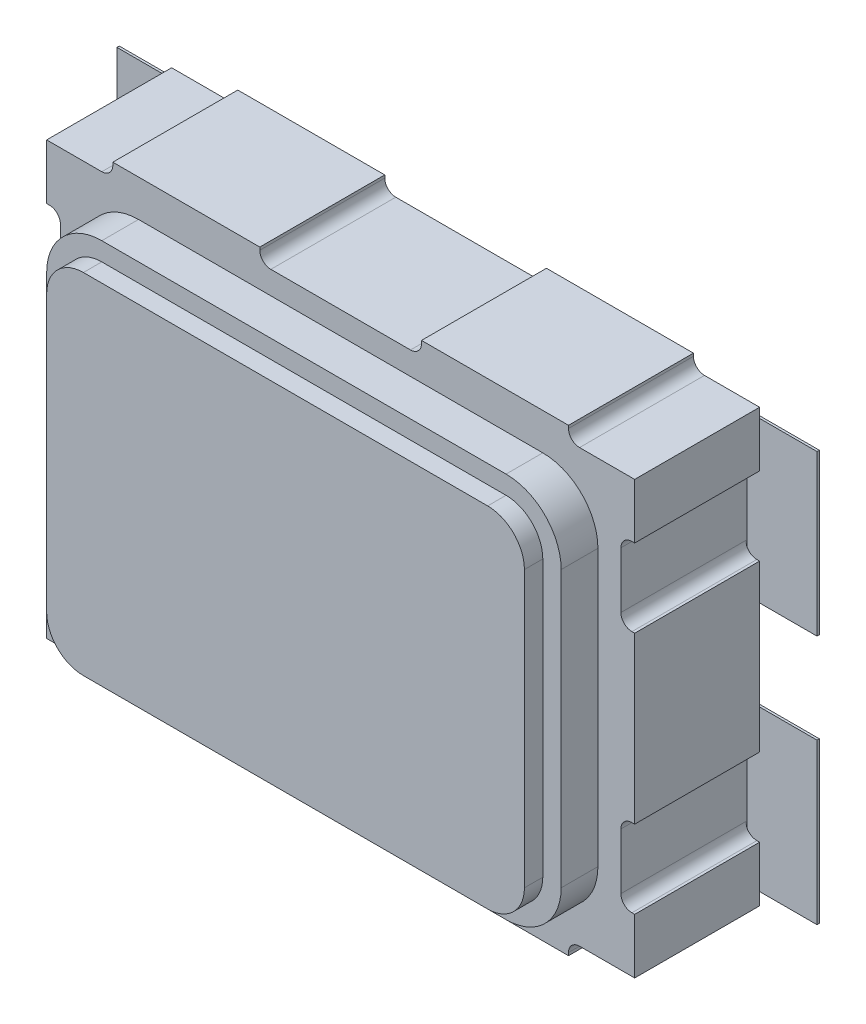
ISO-10303-21;
HEADER;
FILE_DESCRIPTION(('STEP AP214'),'2;1');
FILE_NAME('part.step','',(''),(''),'','','');
FILE_SCHEMA(('AUTOMOTIVE_DESIGN { 1 0 10303 214 1 1 1 1 }'));
ENDSEC;
DATA;
#1=APPLICATION_CONTEXT('core data for automotive mechanical design processes');
#2=APPLICATION_PROTOCOL_DEFINITION('international standard','automotive_design',2000,#1);
#3=PRODUCT_CONTEXT('',#1,'mechanical');
#4=PRODUCT('Part','Part','',(#3));
#5=PRODUCT_RELATED_PRODUCT_CATEGORY('part','',(#4));
#6=PRODUCT_DEFINITION_FORMATION('','',#4);
#7=PRODUCT_DEFINITION_CONTEXT('part definition',#1,'design');
#8=PRODUCT_DEFINITION('design','',#6,#7);
#9=PRODUCT_DEFINITION_SHAPE('','',#8);
#10=(LENGTH_UNIT() NAMED_UNIT(*) SI_UNIT(.MILLI.,.METRE.));
#11=(NAMED_UNIT(*) PLANE_ANGLE_UNIT() SI_UNIT($,.RADIAN.));
#12=(NAMED_UNIT(*) SI_UNIT($,.STERADIAN.) SOLID_ANGLE_UNIT());
#13=UNCERTAINTY_MEASURE_WITH_UNIT(LENGTH_MEASURE(1.E-05),#10,'distance_accuracy_value','');
#14=(GEOMETRIC_REPRESENTATION_CONTEXT(3) GLOBAL_UNCERTAINTY_ASSIGNED_CONTEXT((#13)) GLOBAL_UNIT_ASSIGNED_CONTEXT((#10,
#11,#12)) REPRESENTATION_CONTEXT('',''));
#15=CARTESIAN_POINT('',(0.,0.,0.));
#16=DIRECTION('',(0.,0.,1.));
#17=DIRECTION('',(1.,0.,0.));
#18=AXIS2_PLACEMENT_3D('',#15,#16,#17);
#19=CARTESIAN_POINT('',(0.,-1.25000000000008,1.076198));
#20=DIRECTION('',(0.,0.,1.));
#21=DIRECTION('',(1.,0.,0.));
#22=AXIS2_PLACEMENT_3D('',#19,#20,#21);
#23=PLANE('',#22);
#24=DIRECTION('',(1.,0.,0.));
#25=VECTOR('',#24,1.);
#26=CARTESIAN_POINT('',(1.09999999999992,0.95000000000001,1.076198));
#27=LINE('',#26,#25);
#28=CARTESIAN_POINT('',(-1.09999999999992,0.950000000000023,1.076198));
#29=VERTEX_POINT('',#28);
#30=CARTESIAN_POINT('',(1.09999999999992,0.950000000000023,1.076198));
#31=VERTEX_POINT('',#30);
#32=EDGE_CURVE('E622',#29,#31,#27,.T.);
#33=ORIENTED_EDGE('',*,*,#32,.F.);
#34=CARTESIAN_POINT('',(-1.09999999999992,0.750000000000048,1.076198));
#35=DIRECTION('',(0.,0.,1.));
#36=DIRECTION('',(1.,0.,0.));
#37=AXIS2_PLACEMENT_3D('',#34,#35,#36);
#38=CIRCLE('',#37,0.199999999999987);
#39=CARTESIAN_POINT('',(-1.29999999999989,0.750000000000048,1.076198));
#40=VERTEX_POINT('',#39);
#41=EDGE_CURVE('E604',#29,#40,#38,.T.);
#42=ORIENTED_EDGE('',*,*,#41,.T.);
#43=DIRECTION('',(0.,1.,0.));
#44=VECTOR('',#43,1.);
#45=CARTESIAN_POINT('',(-1.29999999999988,-1.25000000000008,1.076198));
#46=LINE('',#45,#44);
#47=CARTESIAN_POINT('',(-1.29999999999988,-0.750000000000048,1.076198));
#48=VERTEX_POINT('',#47);
#49=EDGE_CURVE('E598',#40,#48,#46,.F.);
#50=ORIENTED_EDGE('',*,*,#49,.T.);
#51=CARTESIAN_POINT('',(-1.09999999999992,-0.750000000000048,1.076198));
#52=DIRECTION('',(0.,0.,1.));
#53=DIRECTION('',(1.,0.,0.));
#54=AXIS2_PLACEMENT_3D('',#51,#52,#53);
#55=CIRCLE('',#54,0.199999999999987);
#56=CARTESIAN_POINT('',(-1.09999999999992,-0.950000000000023,1.076198));
#57=VERTEX_POINT('',#56);
#58=EDGE_CURVE('E19',#48,#57,#55,.T.);
#59=ORIENTED_EDGE('',*,*,#58,.T.);
#60=DIRECTION('',(1.,0.,0.));
#61=VECTOR('',#60,1.);
#62=CARTESIAN_POINT('',(-1.09999999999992,-0.95000000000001,1.076198));
#63=LINE('',#62,#61);
#64=CARTESIAN_POINT('',(1.09999999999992,-0.95000000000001,1.076198));
#65=VERTEX_POINT('',#64);
#66=EDGE_CURVE('E825',#65,#57,#63,.F.);
#67=ORIENTED_EDGE('',*,*,#66,.F.);
#68=CARTESIAN_POINT('',(1.09999999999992,-0.750000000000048,1.076198));
#69=DIRECTION('',(0.,0.,1.));
#70=DIRECTION('',(1.,0.,0.));
#71=AXIS2_PLACEMENT_3D('',#68,#69,#70);
#72=CIRCLE('',#71,0.199999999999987);
#73=CARTESIAN_POINT('',(1.29999999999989,-0.750000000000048,1.076198));
#74=VERTEX_POINT('',#73);
#75=EDGE_CURVE('E629',#74,#65,#72,.F.);
#76=ORIENTED_EDGE('',*,*,#75,.F.);
#77=DIRECTION('',(0.,1.,0.));
#78=VECTOR('',#77,1.);
#79=CARTESIAN_POINT('',(1.29999999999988,-0.750000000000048,1.076198));
#80=LINE('',#79,#78);
#81=CARTESIAN_POINT('',(1.29999999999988,0.750000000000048,1.076198));
#82=VERTEX_POINT('',#81);
#83=EDGE_CURVE('E823',#82,#74,#80,.F.);
#84=ORIENTED_EDGE('',*,*,#83,.F.);
#85=CARTESIAN_POINT('',(1.09999999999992,0.750000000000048,1.076198));
#86=DIRECTION('',(0.,0.,1.));
#87=DIRECTION('',(1.,0.,0.));
#88=AXIS2_PLACEMENT_3D('',#85,#86,#87);
#89=CIRCLE('',#88,0.199999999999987);
#90=EDGE_CURVE('E626',#31,#82,#89,.F.);
#91=ORIENTED_EDGE('',*,*,#90,.F.);
#92=EDGE_LOOP('',(#33,#42,#50,#59,#67,#76,#84,#91));
#93=FACE_BOUND('',#92,.T.);
#94=ADVANCED_FACE('F16',(#93),#23,.T.);
#95=CARTESIAN_POINT('',(1.09999999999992,0.95000000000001,0.976197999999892));
#96=DIRECTION('',(0.,1.,0.));
#97=DIRECTION('',(0.,0.,1.));
#98=AXIS2_PLACEMENT_3D('',#95,#96,#97);
#99=PLANE('',#98);
#100=DIRECTION('',(0.,0.,1.));
#101=VECTOR('',#100,1.);
#102=CARTESIAN_POINT('',(1.09999999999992,0.950000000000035,0.976197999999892));
#103=LINE('',#102,#101);
#104=CARTESIAN_POINT('',(1.09999999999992,0.950000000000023,0.976197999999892));
#105=VERTEX_POINT('',#104);
#106=EDGE_CURVE('E623',#105,#31,#103,.T.);
#107=ORIENTED_EDGE('',*,*,#106,.F.);
#108=DIRECTION('',(1.,0.,0.));
#109=VECTOR('',#108,1.);
#110=CARTESIAN_POINT('',(0.,0.95000000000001,0.976197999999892));
#111=LINE('',#110,#109);
#112=CARTESIAN_POINT('',(-1.09999999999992,0.950000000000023,0.976197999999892));
#113=VERTEX_POINT('',#112);
#114=EDGE_CURVE('E636',#113,#105,#111,.T.);
#115=ORIENTED_EDGE('',*,*,#114,.F.);
#116=DIRECTION('',(0.,0.,1.));
#117=VECTOR('',#116,1.);
#118=CARTESIAN_POINT('',(-1.09999999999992,0.950000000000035,0.976197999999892));
#119=LINE('',#118,#117);
#120=EDGE_CURVE('E837',#29,#113,#119,.F.);
#121=ORIENTED_EDGE('',*,*,#120,.F.);
#122=ORIENTED_EDGE('',*,*,#32,.T.);
#123=EDGE_LOOP('',(#107,#115,#121,#122));
#124=FACE_BOUND('',#123,.T.);
#125=ADVANCED_FACE('F2875',(#124),#99,.T.);
#126=CARTESIAN_POINT('',(1.09999999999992,0.750000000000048,0.976197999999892));
#127=DIRECTION('',(0.,0.,1.));
#128=DIRECTION('',(1.,0.,0.));
#129=AXIS2_PLACEMENT_3D('',#126,#127,#128);
#130=CYLINDRICAL_SURFACE('',#129,0.199999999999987);
#131=DIRECTION('',(0.,0.,-1.));
#132=VECTOR('',#131,1.);
#133=CARTESIAN_POINT('',(1.29999999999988,0.750000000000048,0.976197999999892));
#134=LINE('',#133,#132);
#135=CARTESIAN_POINT('',(1.29999999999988,0.750000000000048,0.976197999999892));
#136=VERTEX_POINT('',#135);
#137=EDGE_CURVE('E628',#136,#82,#134,.F.);
#138=ORIENTED_EDGE('',*,*,#137,.F.);
#139=CARTESIAN_POINT('',(1.09999999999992,0.750000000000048,0.976197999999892));
#140=DIRECTION('',(0.,0.,1.));
#141=DIRECTION('',(1.,0.,0.));
#142=AXIS2_PLACEMENT_3D('',#139,#140,#141);
#143=CIRCLE('',#142,0.199999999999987);
#144=EDGE_CURVE('E633',#105,#136,#143,.F.);
#145=ORIENTED_EDGE('',*,*,#144,.F.);
#146=ORIENTED_EDGE('',*,*,#106,.T.);
#147=ORIENTED_EDGE('',*,*,#90,.T.);
#148=EDGE_LOOP('',(#138,#145,#146,#147));
#149=FACE_BOUND('',#148,.T.);
#150=ADVANCED_FACE('F2865',(#149),#130,.T.);
#151=CARTESIAN_POINT('',(1.29999999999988,-0.750000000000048,0.976197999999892));
#152=DIRECTION('',(1.,0.,0.));
#153=DIRECTION('',(0.,0.,-1.));
#154=AXIS2_PLACEMENT_3D('',#151,#152,#153);
#155=PLANE('',#154);
#156=DIRECTION('',(0.,0.,1.));
#157=VECTOR('',#156,1.);
#158=CARTESIAN_POINT('',(1.29999999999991,-0.750000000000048,0.976197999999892));
#159=LINE('',#158,#157);
#160=CARTESIAN_POINT('',(1.29999999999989,-0.750000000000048,0.976197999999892));
#161=VERTEX_POINT('',#160);
#162=EDGE_CURVE('E632',#161,#74,#159,.T.);
#163=ORIENTED_EDGE('',*,*,#162,.F.);
#164=DIRECTION('',(0.,1.,0.));
#165=VECTOR('',#164,1.);
#166=CARTESIAN_POINT('',(1.29999999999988,-1.25000000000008,0.976197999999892));
#167=LINE('',#166,#165);
#168=EDGE_CURVE('E635',#136,#161,#167,.F.);
#169=ORIENTED_EDGE('',*,*,#168,.F.);
#170=ORIENTED_EDGE('',*,*,#137,.T.);
#171=ORIENTED_EDGE('',*,*,#83,.T.);
#172=EDGE_LOOP('',(#163,#169,#170,#171));
#173=FACE_BOUND('',#172,.T.);
#174=ADVANCED_FACE('F2855',(#173),#155,.T.);
#175=CARTESIAN_POINT('',(1.09999999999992,-0.750000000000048,0.976197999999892));
#176=DIRECTION('',(0.,0.,1.));
#177=DIRECTION('',(1.,0.,0.));
#178=AXIS2_PLACEMENT_3D('',#175,#176,#177);
#179=CYLINDRICAL_SURFACE('',#178,0.199999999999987);
#180=DIRECTION('',(0.,0.,-1.));
#181=VECTOR('',#180,1.);
#182=CARTESIAN_POINT('',(1.09999999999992,-0.95000000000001,0.976197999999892));
#183=LINE('',#182,#181);
#184=CARTESIAN_POINT('',(1.09999999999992,-0.95000000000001,0.976197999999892));
#185=VERTEX_POINT('',#184);
#186=EDGE_CURVE('E631',#185,#65,#183,.F.);
#187=ORIENTED_EDGE('',*,*,#186,.F.);
#188=CARTESIAN_POINT('',(1.09999999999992,-0.750000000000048,0.976197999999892));
#189=DIRECTION('',(0.,0.,1.));
#190=DIRECTION('',(1.,0.,0.));
#191=AXIS2_PLACEMENT_3D('',#188,#189,#190);
#192=CIRCLE('',#191,0.199999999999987);
#193=EDGE_CURVE('E637',#161,#185,#192,.F.);
#194=ORIENTED_EDGE('',*,*,#193,.F.);
#195=ORIENTED_EDGE('',*,*,#162,.T.);
#196=ORIENTED_EDGE('',*,*,#75,.T.);
#197=EDGE_LOOP('',(#187,#194,#195,#196));
#198=FACE_BOUND('',#197,.T.);
#199=ADVANCED_FACE('F2845',(#198),#179,.T.);
#200=CARTESIAN_POINT('',(-1.09999999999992,-0.95000000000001,0.976197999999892));
#201=DIRECTION('',(0.,-1.,0.));
#202=DIRECTION('',(0.,0.,-1.));
#203=AXIS2_PLACEMENT_3D('',#200,#201,#202);
#204=PLANE('',#203);
#205=DIRECTION('',(0.,0.,1.));
#206=VECTOR('',#205,1.);
#207=CARTESIAN_POINT('',(-1.09999999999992,-0.950000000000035,0.976197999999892));
#208=LINE('',#207,#206);
#209=CARTESIAN_POINT('',(-1.09999999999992,-0.950000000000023,0.976197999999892));
#210=VERTEX_POINT('',#209);
#211=EDGE_CURVE('E617',#210,#57,#208,.T.);
#212=ORIENTED_EDGE('',*,*,#211,.F.);
#213=DIRECTION('',(1.,0.,0.));
#214=VECTOR('',#213,1.);
#215=CARTESIAN_POINT('',(0.,-0.95000000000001,0.976197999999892));
#216=LINE('',#215,#214);
#217=EDGE_CURVE('E639',#185,#210,#216,.F.);
#218=ORIENTED_EDGE('',*,*,#217,.F.);
#219=ORIENTED_EDGE('',*,*,#186,.T.);
#220=ORIENTED_EDGE('',*,*,#66,.T.);
#221=EDGE_LOOP('',(#212,#218,#219,#220));
#222=FACE_BOUND('',#221,.T.);
#223=ADVANCED_FACE('F2836',(#222),#204,.T.);
#224=CARTESIAN_POINT('',(-1.09999999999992,-0.750000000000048,0.976197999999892));
#225=DIRECTION('',(0.,0.,1.));
#226=DIRECTION('',(1.,0.,0.));
#227=AXIS2_PLACEMENT_3D('',#224,#225,#226);
#228=CYLINDRICAL_SURFACE('',#227,0.199999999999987);
#229=DIRECTION('',(0.,0.,1.));
#230=VECTOR('',#229,1.);
#231=CARTESIAN_POINT('',(-1.29999999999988,-0.750000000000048,0.976197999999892));
#232=LINE('',#231,#230);
#233=CARTESIAN_POINT('',(-1.29999999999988,-0.750000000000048,0.976197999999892));
#234=VERTEX_POINT('',#233);
#235=EDGE_CURVE('E611',#234,#48,#232,.T.);
#236=ORIENTED_EDGE('',*,*,#235,.F.);
#237=CARTESIAN_POINT('',(-1.09999999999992,-0.750000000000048,0.976197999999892));
#238=DIRECTION('',(0.,0.,1.));
#239=DIRECTION('',(1.,0.,0.));
#240=AXIS2_PLACEMENT_3D('',#237,#238,#239);
#241=CIRCLE('',#240,0.199999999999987);
#242=EDGE_CURVE('E640',#210,#234,#241,.F.);
#243=ORIENTED_EDGE('',*,*,#242,.F.);
#244=ORIENTED_EDGE('',*,*,#211,.T.);
#245=ORIENTED_EDGE('',*,*,#58,.F.);
#246=EDGE_LOOP('',(#236,#243,#244,#245));
#247=FACE_BOUND('',#246,.T.);
#248=ADVANCED_FACE('F620',(#247),#228,.T.);
#249=CARTESIAN_POINT('',(-1.29999999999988,0.750000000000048,0.976197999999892));
#250=DIRECTION('',(-1.,0.,0.));
#251=DIRECTION('',(0.,0.,1.));
#252=AXIS2_PLACEMENT_3D('',#249,#250,#251);
#253=PLANE('',#252);
#254=DIRECTION('',(0.,0.,1.));
#255=VECTOR('',#254,1.);
#256=CARTESIAN_POINT('',(-1.29999999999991,0.750000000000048,0.976197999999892));
#257=LINE('',#256,#255);
#258=CARTESIAN_POINT('',(-1.29999999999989,0.750000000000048,0.976197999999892));
#259=VERTEX_POINT('',#258);
#260=EDGE_CURVE('E616',#259,#40,#257,.T.);
#261=ORIENTED_EDGE('',*,*,#260,.F.);
#262=DIRECTION('',(0.,1.,0.));
#263=VECTOR('',#262,1.);
#264=CARTESIAN_POINT('',(-1.29999999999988,-1.25000000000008,0.976197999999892));
#265=LINE('',#264,#263);
#266=EDGE_CURVE('E613',#234,#259,#265,.T.);
#267=ORIENTED_EDGE('',*,*,#266,.F.);
#268=ORIENTED_EDGE('',*,*,#235,.T.);
#269=ORIENTED_EDGE('',*,*,#49,.F.);
#270=EDGE_LOOP('',(#261,#267,#268,#269));
#271=FACE_BOUND('',#270,.T.);
#272=ADVANCED_FACE('F612',(#271),#253,.T.);
#273=CARTESIAN_POINT('',(-1.09999999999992,0.750000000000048,0.976197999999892));
#274=DIRECTION('',(0.,0.,1.));
#275=DIRECTION('',(1.,0.,0.));
#276=AXIS2_PLACEMENT_3D('',#273,#274,#275);
#277=CYLINDRICAL_SURFACE('',#276,0.199999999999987);
#278=ORIENTED_EDGE('',*,*,#120,.T.);
#279=CARTESIAN_POINT('',(-1.09999999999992,0.750000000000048,0.976197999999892));
#280=DIRECTION('',(0.,0.,1.));
#281=DIRECTION('',(1.,0.,0.));
#282=AXIS2_PLACEMENT_3D('',#279,#280,#281);
#283=CIRCLE('',#282,0.199999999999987);
#284=EDGE_CURVE('E642',#259,#113,#283,.F.);
#285=ORIENTED_EDGE('',*,*,#284,.F.);
#286=ORIENTED_EDGE('',*,*,#260,.T.);
#287=ORIENTED_EDGE('',*,*,#41,.F.);
#288=EDGE_LOOP('',(#278,#285,#286,#287));
#289=FACE_BOUND('',#288,.T.);
#290=ADVANCED_FACE('F2809',(#289),#277,.T.);
#291=CARTESIAN_POINT('',(0.,-1.25000000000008,0.976197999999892));
#292=DIRECTION('',(0.,0.,1.));
#293=DIRECTION('',(1.,0.,0.));
#294=AXIS2_PLACEMENT_3D('',#291,#292,#293);
#295=PLANE('',#294);
#296=ORIENTED_EDGE('',*,*,#266,.T.);
#297=ORIENTED_EDGE('',*,*,#284,.T.);
#298=ORIENTED_EDGE('',*,*,#114,.T.);
#299=ORIENTED_EDGE('',*,*,#144,.T.);
#300=ORIENTED_EDGE('',*,*,#168,.T.);
#301=ORIENTED_EDGE('',*,*,#193,.T.);
#302=ORIENTED_EDGE('',*,*,#217,.T.);
#303=ORIENTED_EDGE('',*,*,#242,.T.);
#304=EDGE_LOOP('',(#296,#297,#298,#299,#300,#301,#302,#303));
#305=FACE_BOUND('',#304,.T.);
#306=DIRECTION('',(1.,0.,0.));
#307=VECTOR('',#306,1.);
#308=CARTESIAN_POINT('',(1.09999999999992,1.05000000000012,0.976197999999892));
#309=LINE('',#308,#307);
#310=CARTESIAN_POINT('',(-1.09999999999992,1.05000000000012,0.976197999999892));
#311=VERTEX_POINT('',#310);
#312=CARTESIAN_POINT('',(1.09999999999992,1.05000000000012,0.976197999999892));
#313=VERTEX_POINT('',#312);
#314=EDGE_CURVE('E848',#311,#313,#309,.T.);
#315=ORIENTED_EDGE('',*,*,#314,.F.);
#316=CARTESIAN_POINT('',(-1.09999999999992,0.750000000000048,0.976197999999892));
#317=DIRECTION('',(0.,0.,1.));
#318=DIRECTION('',(1.,0.,0.));
#319=AXIS2_PLACEMENT_3D('',#316,#317,#318);
#320=CIRCLE('',#319,0.30000000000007);
#321=CARTESIAN_POINT('',(-1.39999999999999,0.750000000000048,0.976197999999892));
#322=VERTEX_POINT('',#321);
#323=EDGE_CURVE('E645',#322,#311,#320,.F.);
#324=ORIENTED_EDGE('',*,*,#323,.F.);
#325=DIRECTION('',(0.,1.,0.));
#326=VECTOR('',#325,1.);
#327=CARTESIAN_POINT('',(-1.39999999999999,0.750000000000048,0.976197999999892));
#328=LINE('',#327,#326);
#329=CARTESIAN_POINT('',(-1.39999999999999,-0.750000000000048,0.976197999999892));
#330=VERTEX_POINT('',#329);
#331=EDGE_CURVE('E647',#330,#322,#328,.T.);
#332=ORIENTED_EDGE('',*,*,#331,.F.);
#333=CARTESIAN_POINT('',(-1.09999999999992,-0.750000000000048,0.976197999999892));
#334=DIRECTION('',(0.,0.,1.));
#335=DIRECTION('',(1.,0.,0.));
#336=AXIS2_PLACEMENT_3D('',#333,#334,#335);
#337=CIRCLE('',#336,0.30000000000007);
#338=CARTESIAN_POINT('',(-1.09999999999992,-1.05000000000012,0.976197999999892));
#339=VERTEX_POINT('',#338);
#340=EDGE_CURVE('E648',#339,#330,#337,.F.);
#341=ORIENTED_EDGE('',*,*,#340,.F.);
#342=DIRECTION('',(1.,0.,0.));
#343=VECTOR('',#342,1.);
#344=CARTESIAN_POINT('',(-1.09999999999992,-1.05000000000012,0.976197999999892));
#345=LINE('',#344,#343);
#346=CARTESIAN_POINT('',(1.09999999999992,-1.05000000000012,0.976197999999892));
#347=VERTEX_POINT('',#346);
#348=EDGE_CURVE('E840',#347,#339,#345,.F.);
#349=ORIENTED_EDGE('',*,*,#348,.F.);
#350=CARTESIAN_POINT('',(1.09999999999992,-0.750000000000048,0.976197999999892));
#351=DIRECTION('',(0.,0.,1.));
#352=DIRECTION('',(1.,0.,0.));
#353=AXIS2_PLACEMENT_3D('',#350,#351,#352);
#354=CIRCLE('',#353,0.30000000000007);
#355=CARTESIAN_POINT('',(1.39999999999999,-0.750000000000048,0.976197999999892));
#356=VERTEX_POINT('',#355);
#357=EDGE_CURVE('E652',#356,#347,#354,.F.);
#358=ORIENTED_EDGE('',*,*,#357,.F.);
#359=DIRECTION('',(0.,1.,0.));
#360=VECTOR('',#359,1.);
#361=CARTESIAN_POINT('',(1.39999999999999,-0.750000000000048,0.976197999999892));
#362=LINE('',#361,#360);
#363=CARTESIAN_POINT('',(1.39999999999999,0.750000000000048,0.976197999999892));
#364=VERTEX_POINT('',#363);
#365=EDGE_CURVE('E842',#364,#356,#362,.F.);
#366=ORIENTED_EDGE('',*,*,#365,.F.);
#367=CARTESIAN_POINT('',(1.09999999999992,0.750000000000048,0.976197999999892));
#368=DIRECTION('',(0.,0.,1.));
#369=DIRECTION('',(1.,0.,0.));
#370=AXIS2_PLACEMENT_3D('',#367,#368,#369);
#371=CIRCLE('',#370,0.30000000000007);
#372=EDGE_CURVE('E656',#313,#364,#371,.F.);
#373=ORIENTED_EDGE('',*,*,#372,.F.);
#374=EDGE_LOOP('',(#315,#324,#332,#341,#349,#358,#366,#373));
#375=FACE_BOUND('',#374,.T.);
#376=ADVANCED_FACE('F2799',(#305,#375),#295,.T.);
#377=CARTESIAN_POINT('',(-1.09999999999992,0.750000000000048,0.77619799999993));
#378=DIRECTION('',(0.,0.,1.));
#379=DIRECTION('',(1.,0.,0.));
#380=AXIS2_PLACEMENT_3D('',#377,#378,#379);
#381=CYLINDRICAL_SURFACE('',#380,0.30000000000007);
#382=DIRECTION('',(0.,0.,1.));
#383=VECTOR('',#382,1.);
#384=CARTESIAN_POINT('',(-1.09999999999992,1.05000000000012,0.77619799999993));
#385=LINE('',#384,#383);
#386=CARTESIAN_POINT('',(-1.09999999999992,1.05000000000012,0.77619799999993));
#387=VERTEX_POINT('',#386);
#388=EDGE_CURVE('E851',#387,#311,#385,.T.);
#389=ORIENTED_EDGE('',*,*,#388,.F.);
#390=CARTESIAN_POINT('',(-1.09999999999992,0.750000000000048,0.77619799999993));
#391=DIRECTION('',(0.,0.,1.));
#392=DIRECTION('',(1.,0.,0.));
#393=AXIS2_PLACEMENT_3D('',#390,#391,#392);
#394=CIRCLE('',#393,0.30000000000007);
#395=CARTESIAN_POINT('',(-1.39999999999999,0.750000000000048,0.77619799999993));
#396=VERTEX_POINT('',#395);
#397=EDGE_CURVE('E660',#387,#396,#394,.T.);
#398=ORIENTED_EDGE('',*,*,#397,.T.);
#399=DIRECTION('',(0.,0.,1.));
#400=VECTOR('',#399,1.);
#401=CARTESIAN_POINT('',(-1.39999999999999,0.750000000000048,0.77619799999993));
#402=LINE('',#401,#400);
#403=EDGE_CURVE('E651',#322,#396,#402,.F.);
#404=ORIENTED_EDGE('',*,*,#403,.F.);
#405=ORIENTED_EDGE('',*,*,#323,.T.);
#406=EDGE_LOOP('',(#389,#398,#404,#405));
#407=FACE_BOUND('',#406,.T.);
#408=ADVANCED_FACE('F2789',(#407),#381,.T.);
#409=CARTESIAN_POINT('',(-1.39999999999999,0.750000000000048,0.77619799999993));
#410=DIRECTION('',(-1.,0.,0.));
#411=DIRECTION('',(0.,0.,1.));
#412=AXIS2_PLACEMENT_3D('',#409,#410,#411);
#413=PLANE('',#412);
#414=ORIENTED_EDGE('',*,*,#403,.T.);
#415=DIRECTION('',(0.,1.,0.));
#416=VECTOR('',#415,1.);
#417=CARTESIAN_POINT('',(-1.39999999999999,-1.25000000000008,0.77619799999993));
#418=LINE('',#417,#416);
#419=CARTESIAN_POINT('',(-1.39999999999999,-0.750000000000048,0.77619799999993));
#420=VERTEX_POINT('',#419);
#421=EDGE_CURVE('E663',#396,#420,#418,.F.);
#422=ORIENTED_EDGE('',*,*,#421,.T.);
#423=DIRECTION('',(0.,0.,1.));
#424=VECTOR('',#423,1.);
#425=CARTESIAN_POINT('',(-1.39999999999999,-0.750000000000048,0.77619799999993));
#426=LINE('',#425,#424);
#427=EDGE_CURVE('E650',#330,#420,#426,.F.);
#428=ORIENTED_EDGE('',*,*,#427,.F.);
#429=ORIENTED_EDGE('',*,*,#331,.T.);
#430=EDGE_LOOP('',(#414,#422,#428,#429));
#431=FACE_BOUND('',#430,.T.);
#432=ADVANCED_FACE('F2779',(#431),#413,.T.);
#433=CARTESIAN_POINT('',(-1.09999999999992,-0.750000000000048,0.77619799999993));
#434=DIRECTION('',(0.,0.,1.));
#435=DIRECTION('',(1.,0.,0.));
#436=AXIS2_PLACEMENT_3D('',#433,#434,#435);
#437=CYLINDRICAL_SURFACE('',#436,0.30000000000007);
#438=ORIENTED_EDGE('',*,*,#427,.T.);
#439=CARTESIAN_POINT('',(-1.09999999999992,-0.750000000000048,0.77619799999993));
#440=DIRECTION('',(0.,0.,1.));
#441=DIRECTION('',(1.,0.,0.));
#442=AXIS2_PLACEMENT_3D('',#439,#440,#441);
#443=CIRCLE('',#442,0.30000000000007);
#444=CARTESIAN_POINT('',(-1.09999999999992,-1.05000000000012,0.77619799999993));
#445=VERTEX_POINT('',#444);
#446=EDGE_CURVE('E665',#420,#445,#443,.T.);
#447=ORIENTED_EDGE('',*,*,#446,.T.);
#448=DIRECTION('',(0.,0.,-1.));
#449=VECTOR('',#448,1.);
#450=CARTESIAN_POINT('',(-1.09999999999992,-1.05000000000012,0.77619799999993));
#451=LINE('',#450,#449);
#452=EDGE_CURVE('E655',#339,#445,#451,.T.);
#453=ORIENTED_EDGE('',*,*,#452,.F.);
#454=ORIENTED_EDGE('',*,*,#340,.T.);
#455=EDGE_LOOP('',(#438,#447,#453,#454));
#456=FACE_BOUND('',#455,.T.);
#457=ADVANCED_FACE('F2769',(#456),#437,.T.);
#458=CARTESIAN_POINT('',(-1.09999999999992,-1.05000000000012,0.77619799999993));
#459=DIRECTION('',(0.,-1.,0.));
#460=DIRECTION('',(0.,0.,-1.));
#461=AXIS2_PLACEMENT_3D('',#458,#459,#460);
#462=PLANE('',#461);
#463=ORIENTED_EDGE('',*,*,#452,.T.);
#464=DIRECTION('',(-1.,0.,0.));
#465=VECTOR('',#464,1.);
#466=CARTESIAN_POINT('',(-1.59999999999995,-1.05000000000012,0.77619799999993));
#467=LINE('',#466,#465);
#468=CARTESIAN_POINT('',(1.09999999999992,-1.05000000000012,0.77619799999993));
#469=VERTEX_POINT('',#468);
#470=EDGE_CURVE('E668',#445,#469,#467,.F.);
#471=ORIENTED_EDGE('',*,*,#470,.T.);
#472=DIRECTION('',(0.,0.,1.));
#473=VECTOR('',#472,1.);
#474=CARTESIAN_POINT('',(1.09999999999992,-1.05000000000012,0.77619799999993));
#475=LINE('',#474,#473);
#476=EDGE_CURVE('E654',#347,#469,#475,.F.);
#477=ORIENTED_EDGE('',*,*,#476,.F.);
#478=ORIENTED_EDGE('',*,*,#348,.T.);
#479=EDGE_LOOP('',(#463,#471,#477,#478));
#480=FACE_BOUND('',#479,.T.);
#481=ADVANCED_FACE('F2759',(#480),#462,.T.);
#482=CARTESIAN_POINT('',(1.09999999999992,-0.750000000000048,0.77619799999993));
#483=DIRECTION('',(0.,0.,1.));
#484=DIRECTION('',(1.,0.,0.));
#485=AXIS2_PLACEMENT_3D('',#482,#483,#484);
#486=CYLINDRICAL_SURFACE('',#485,0.30000000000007);
#487=ORIENTED_EDGE('',*,*,#476,.T.);
#488=CARTESIAN_POINT('',(1.09999999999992,-0.750000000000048,0.77619799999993));
#489=DIRECTION('',(0.,0.,1.));
#490=DIRECTION('',(1.,0.,0.));
#491=AXIS2_PLACEMENT_3D('',#488,#489,#490);
#492=CIRCLE('',#491,0.30000000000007);
#493=CARTESIAN_POINT('',(1.39999999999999,-0.750000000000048,0.77619799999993));
#494=VERTEX_POINT('',#493);
#495=EDGE_CURVE('E669',#469,#494,#492,.T.);
#496=ORIENTED_EDGE('',*,*,#495,.T.);
#497=DIRECTION('',(0.,0.,-1.));
#498=VECTOR('',#497,1.);
#499=CARTESIAN_POINT('',(1.39999999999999,-0.750000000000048,0.77619799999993));
#500=LINE('',#499,#498);
#501=EDGE_CURVE('E659',#356,#494,#500,.T.);
#502=ORIENTED_EDGE('',*,*,#501,.F.);
#503=ORIENTED_EDGE('',*,*,#357,.T.);
#504=EDGE_LOOP('',(#487,#496,#502,#503));
#505=FACE_BOUND('',#504,.T.);
#506=ADVANCED_FACE('F2749',(#505),#486,.T.);
#507=CARTESIAN_POINT('',(1.39999999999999,-0.750000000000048,0.77619799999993));
#508=DIRECTION('',(1.,0.,0.));
#509=DIRECTION('',(0.,0.,-1.));
#510=AXIS2_PLACEMENT_3D('',#507,#508,#509);
#511=PLANE('',#510);
#512=ORIENTED_EDGE('',*,*,#501,.T.);
#513=DIRECTION('',(0.,1.,0.));
#514=VECTOR('',#513,1.);
#515=CARTESIAN_POINT('',(1.39999999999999,-1.25000000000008,0.77619799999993));
#516=LINE('',#515,#514);
#517=CARTESIAN_POINT('',(1.39999999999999,0.750000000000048,0.77619799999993));
#518=VERTEX_POINT('',#517);
#519=EDGE_CURVE('E672',#494,#518,#516,.T.);
#520=ORIENTED_EDGE('',*,*,#519,.T.);
#521=DIRECTION('',(0.,0.,1.));
#522=VECTOR('',#521,1.);
#523=CARTESIAN_POINT('',(1.39999999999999,0.750000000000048,0.77619799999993));
#524=LINE('',#523,#522);
#525=EDGE_CURVE('E658',#364,#518,#524,.F.);
#526=ORIENTED_EDGE('',*,*,#525,.F.);
#527=ORIENTED_EDGE('',*,*,#365,.T.);
#528=EDGE_LOOP('',(#512,#520,#526,#527));
#529=FACE_BOUND('',#528,.T.);
#530=ADVANCED_FACE('F2739',(#529),#511,.T.);
#531=CARTESIAN_POINT('',(1.09999999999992,0.750000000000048,0.77619799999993));
#532=DIRECTION('',(0.,0.,1.));
#533=DIRECTION('',(1.,0.,0.));
#534=AXIS2_PLACEMENT_3D('',#531,#532,#533);
#535=CYLINDRICAL_SURFACE('',#534,0.30000000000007);
#536=ORIENTED_EDGE('',*,*,#525,.T.);
#537=CARTESIAN_POINT('',(1.09999999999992,0.750000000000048,0.77619799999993));
#538=DIRECTION('',(0.,0.,1.));
#539=DIRECTION('',(1.,0.,0.));
#540=AXIS2_PLACEMENT_3D('',#537,#538,#539);
#541=CIRCLE('',#540,0.30000000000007);
#542=CARTESIAN_POINT('',(1.09999999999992,1.05000000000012,0.77619799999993));
#543=VERTEX_POINT('',#542);
#544=EDGE_CURVE('E673',#518,#543,#541,.T.);
#545=ORIENTED_EDGE('',*,*,#544,.T.);
#546=DIRECTION('',(0.,0.,1.));
#547=VECTOR('',#546,1.);
#548=CARTESIAN_POINT('',(1.09999999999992,1.05000000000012,0.77619799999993));
#549=LINE('',#548,#547);
#550=EDGE_CURVE('E850',#313,#543,#549,.F.);
#551=ORIENTED_EDGE('',*,*,#550,.F.);
#552=ORIENTED_EDGE('',*,*,#372,.T.);
#553=EDGE_LOOP('',(#536,#545,#551,#552));
#554=FACE_BOUND('',#553,.T.);
#555=ADVANCED_FACE('F2730',(#554),#535,.T.);
#556=CARTESIAN_POINT('',(1.09999999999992,1.05000000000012,0.77619799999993));
#557=DIRECTION('',(0.,1.,0.));
#558=DIRECTION('',(0.,0.,1.));
#559=AXIS2_PLACEMENT_3D('',#556,#557,#558);
#560=PLANE('',#559);
#561=ORIENTED_EDGE('',*,*,#550,.T.);
#562=DIRECTION('',(-1.,0.,0.));
#563=VECTOR('',#562,1.);
#564=CARTESIAN_POINT('',(-1.59999999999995,1.05000000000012,0.77619799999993));
#565=LINE('',#564,#563);
#566=EDGE_CURVE('E676',#543,#387,#565,.T.);
#567=ORIENTED_EDGE('',*,*,#566,.T.);
#568=ORIENTED_EDGE('',*,*,#388,.T.);
#569=ORIENTED_EDGE('',*,*,#314,.T.);
#570=EDGE_LOOP('',(#561,#567,#568,#569));
#571=FACE_BOUND('',#570,.T.);
#572=ADVANCED_FACE('F2722',(#571),#560,.T.);
#573=CARTESIAN_POINT('',(1.12500000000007,-1.11500000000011,0.0762));
#574=DIRECTION('',(0.,-1.,0.));
#575=DIRECTION('',(0.,0.,-1.));
#576=AXIS2_PLACEMENT_3D('',#573,#574,#575);
#577=PLANE('',#576);
#578=DIRECTION('',(0.,0.,1.));
#579=VECTOR('',#578,1.);
#580=CARTESIAN_POINT('',(1.12500000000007,-1.11500000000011,0.0961999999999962));
#581=LINE('',#580,#579);
#582=CARTESIAN_POINT('',(1.12500000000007,-1.11500000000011,0.0762));
#583=VERTEX_POINT('',#582);
#584=CARTESIAN_POINT('',(1.12500000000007,-1.11500000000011,0.0889));
#585=VERTEX_POINT('',#584);
#586=EDGE_CURVE('E912',#583,#585,#581,.T.);
#587=ORIENTED_EDGE('',*,*,#586,.F.);
#588=DIRECTION('',(1.,0.,0.));
#589=VECTOR('',#588,1.);
#590=CARTESIAN_POINT('',(0.,-1.11500000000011,0.0762));
#591=LINE('',#590,#589);
#592=CARTESIAN_POINT('',(1.905,-1.11500000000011,0.0762));
#593=VERTEX_POINT('',#592);
#594=EDGE_CURVE('E858',#583,#593,#591,.T.);
#595=ORIENTED_EDGE('',*,*,#594,.T.);
#596=DIRECTION('',(0.,0.,-1.));
#597=VECTOR('',#596,1.);
#598=CARTESIAN_POINT('',(1.905,-1.11500000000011,0.0762));
#599=LINE('',#598,#597);
#600=CARTESIAN_POINT('',(1.905,-1.11500000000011,0.0889));
#601=VERTEX_POINT('',#600);
#602=EDGE_CURVE('E902',#601,#593,#599,.T.);
#603=ORIENTED_EDGE('',*,*,#602,.F.);
#604=DIRECTION('',(1.,0.,0.));
#605=VECTOR('',#604,1.);
#606=CARTESIAN_POINT('',(0.,-1.11500000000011,0.0889));
#607=LINE('',#606,#605);
#608=EDGE_CURVE('E918',#585,#601,#607,.T.);
#609=ORIENTED_EDGE('',*,*,#608,.F.);
#610=EDGE_LOOP('',(#587,#595,#603,#609));
#611=FACE_BOUND('',#610,.T.);
#612=ADVANCED_FACE('F1818',(#611),#577,.T.);
#613=CARTESIAN_POINT('',(1.905,-1.11500000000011,0.0762));
#614=DIRECTION('',(1.,0.,0.));
#615=DIRECTION('',(0.,0.,-1.));
#616=AXIS2_PLACEMENT_3D('',#613,#614,#615);
#617=PLANE('',#616);
#618=ORIENTED_EDGE('',*,*,#602,.T.);
#619=DIRECTION('',(0.,1.,0.));
#620=VECTOR('',#619,1.);
#621=CARTESIAN_POINT('',(1.905,0.,0.0762));
#622=LINE('',#621,#620);
#623=CARTESIAN_POINT('',(1.905,-0.245000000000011,0.0762));
#624=VERTEX_POINT('',#623);
#625=EDGE_CURVE('E854',#593,#624,#622,.T.);
#626=ORIENTED_EDGE('',*,*,#625,.T.);
#627=DIRECTION('',(0.,0.,1.));
#628=VECTOR('',#627,1.);
#629=CARTESIAN_POINT('',(1.905,-0.245000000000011,0.0961999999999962));
#630=LINE('',#629,#628);
#631=CARTESIAN_POINT('',(1.905,-0.245000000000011,0.0889));
#632=VERTEX_POINT('',#631);
#633=EDGE_CURVE('E925',#632,#624,#630,.F.);
#634=ORIENTED_EDGE('',*,*,#633,.F.);
#635=DIRECTION('',(0.,1.,0.));
#636=VECTOR('',#635,1.);
#637=CARTESIAN_POINT('',(1.905,0.,0.0889));
#638=LINE('',#637,#636);
#639=EDGE_CURVE('E920',#601,#632,#638,.T.);
#640=ORIENTED_EDGE('',*,*,#639,.F.);
#641=EDGE_LOOP('',(#618,#626,#634,#640));
#642=FACE_BOUND('',#641,.T.);
#643=ADVANCED_FACE('F1809',(#642),#617,.T.);
#644=CARTESIAN_POINT('',(0.,0.,0.0762));
#645=DIRECTION('',(0.,0.,1.));
#646=DIRECTION('',(1.,0.,0.));
#647=AXIS2_PLACEMENT_3D('',#644,#645,#646);
#648=PLANE('',#647);
#649=ORIENTED_EDGE('',*,*,#625,.F.);
#650=ORIENTED_EDGE('',*,*,#594,.F.);
#651=DIRECTION('',(0.,1.,0.));
#652=VECTOR('',#651,1.);
#653=CARTESIAN_POINT('',(1.12500000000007,-1.09499999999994,0.0762));
#654=LINE('',#653,#652);
#655=CARTESIAN_POINT('',(1.12500000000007,-0.245000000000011,0.0762));
#656=VERTEX_POINT('',#655);
#657=EDGE_CURVE('E915',#656,#583,#654,.F.);
#658=ORIENTED_EDGE('',*,*,#657,.F.);
#659=DIRECTION('',(1.,0.,0.));
#660=VECTOR('',#659,1.);
#661=CARTESIAN_POINT('',(1.12500000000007,-0.245000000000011,0.0762));
#662=LINE('',#661,#660);
#663=EDGE_CURVE('E680',#624,#656,#662,.F.);
#664=ORIENTED_EDGE('',*,*,#663,.F.);
#665=EDGE_LOOP('',(#649,#650,#658,#664));
#666=FACE_BOUND('',#665,.T.);
#667=ADVANCED_FACE('F1812',(#666),#648,.F.);
#668=CARTESIAN_POINT('',(1.905,0.245000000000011,0.0762));
#669=DIRECTION('',(1.,0.,0.));
#670=DIRECTION('',(0.,0.,-1.));
#671=AXIS2_PLACEMENT_3D('',#668,#669,#670);
#672=PLANE('',#671);
#673=DIRECTION('',(0.,0.,-1.));
#674=VECTOR('',#673,1.);
#675=CARTESIAN_POINT('',(1.905,0.245000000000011,0.0961999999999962));
#676=LINE('',#675,#674);
#677=CARTESIAN_POINT('',(1.905,0.245000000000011,0.0762));
#678=VERTEX_POINT('',#677);
#679=CARTESIAN_POINT('',(1.905,0.245000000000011,0.0889));
#680=VERTEX_POINT('',#679);
#681=EDGE_CURVE('E961',#678,#680,#676,.F.);
#682=ORIENTED_EDGE('',*,*,#681,.F.);
#683=DIRECTION('',(0.,1.,0.));
#684=VECTOR('',#683,1.);
#685=CARTESIAN_POINT('',(1.905,0.,0.0762));
#686=LINE('',#685,#684);
#687=CARTESIAN_POINT('',(1.905,1.11500000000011,0.0762));
#688=VERTEX_POINT('',#687);
#689=EDGE_CURVE('E865',#678,#688,#686,.T.);
#690=ORIENTED_EDGE('',*,*,#689,.T.);
#691=DIRECTION('',(0.,0.,1.));
#692=VECTOR('',#691,1.);
#693=CARTESIAN_POINT('',(1.905,1.11500000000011,0.0762));
#694=LINE('',#693,#692);
#695=CARTESIAN_POINT('',(1.905,1.11500000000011,0.0889));
#696=VERTEX_POINT('',#695);
#697=EDGE_CURVE('E857',#696,#688,#694,.F.);
#698=ORIENTED_EDGE('',*,*,#697,.F.);
#699=DIRECTION('',(0.,1.,0.));
#700=VECTOR('',#699,1.);
#701=CARTESIAN_POINT('',(1.905,0.,0.0889));
#702=LINE('',#701,#700);
#703=EDGE_CURVE('E864',#680,#696,#702,.T.);
#704=ORIENTED_EDGE('',*,*,#703,.F.);
#705=EDGE_LOOP('',(#682,#690,#698,#704));
#706=FACE_BOUND('',#705,.T.);
#707=ADVANCED_FACE('F2690',(#706),#672,.T.);
#708=CARTESIAN_POINT('',(1.905,1.11500000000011,0.0762));
#709=DIRECTION('',(0.,1.,0.));
#710=DIRECTION('',(0.,0.,1.));
#711=AXIS2_PLACEMENT_3D('',#708,#709,#710);
#712=PLANE('',#711);
#713=ORIENTED_EDGE('',*,*,#697,.T.);
#714=DIRECTION('',(1.,0.,0.));
#715=VECTOR('',#714,1.);
#716=CARTESIAN_POINT('',(0.,1.11500000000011,0.0762));
#717=LINE('',#716,#715);
#718=CARTESIAN_POINT('',(1.12500000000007,1.11500000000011,0.0762));
#719=VERTEX_POINT('',#718);
#720=EDGE_CURVE('E861',#688,#719,#717,.F.);
#721=ORIENTED_EDGE('',*,*,#720,.T.);
#722=DIRECTION('',(0.,0.,1.));
#723=VECTOR('',#722,1.);
#724=CARTESIAN_POINT('',(1.12500000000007,1.11500000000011,0.0961999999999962));
#725=LINE('',#724,#723);
#726=CARTESIAN_POINT('',(1.12500000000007,1.11500000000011,0.0889));
#727=VERTEX_POINT('',#726);
#728=EDGE_CURVE('E973',#727,#719,#725,.F.);
#729=ORIENTED_EDGE('',*,*,#728,.F.);
#730=DIRECTION('',(1.,0.,0.));
#731=VECTOR('',#730,1.);
#732=CARTESIAN_POINT('',(0.,1.11500000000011,0.0889));
#733=LINE('',#732,#731);
#734=EDGE_CURVE('E880',#696,#727,#733,.F.);
#735=ORIENTED_EDGE('',*,*,#734,.F.);
#736=EDGE_LOOP('',(#713,#721,#729,#735));
#737=FACE_BOUND('',#736,.T.);
#738=ADVANCED_FACE('F2679',(#737),#712,.T.);
#739=CARTESIAN_POINT('',(0.,0.,0.0762));
#740=DIRECTION('',(0.,0.,1.));
#741=DIRECTION('',(1.,0.,0.));
#742=AXIS2_PLACEMENT_3D('',#739,#740,#741);
#743=PLANE('',#742);
#744=ORIENTED_EDGE('',*,*,#720,.F.);
#745=ORIENTED_EDGE('',*,*,#689,.F.);
#746=DIRECTION('',(1.,0.,0.));
#747=VECTOR('',#746,1.);
#748=CARTESIAN_POINT('',(1.525,0.245000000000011,0.0762));
#749=LINE('',#748,#747);
#750=CARTESIAN_POINT('',(1.12500000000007,0.245000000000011,0.0762));
#751=VERTEX_POINT('',#750);
#752=EDGE_CURVE('E684',#751,#678,#749,.T.);
#753=ORIENTED_EDGE('',*,*,#752,.F.);
#754=DIRECTION('',(0.,1.,0.));
#755=VECTOR('',#754,1.);
#756=CARTESIAN_POINT('',(1.12500000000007,0.245000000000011,0.0762));
#757=LINE('',#756,#755);
#758=EDGE_CURVE('E969',#719,#751,#757,.F.);
#759=ORIENTED_EDGE('',*,*,#758,.F.);
#760=EDGE_LOOP('',(#744,#745,#753,#759));
#761=FACE_BOUND('',#760,.T.);
#762=ADVANCED_FACE('F2670',(#761),#743,.F.);
#763=CARTESIAN_POINT('',(0.,0.,0.0889));
#764=DIRECTION('',(0.,0.,1.));
#765=DIRECTION('',(1.,0.,0.));
#766=AXIS2_PLACEMENT_3D('',#763,#764,#765);
#767=PLANE('',#766);
#768=DIRECTION('',(1.,0.,0.));
#769=VECTOR('',#768,1.);
#770=CARTESIAN_POINT('',(1.12500000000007,1.09499999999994,0.0889));
#771=LINE('',#770,#769);
#772=CARTESIAN_POINT('',(1.525,1.09499999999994,0.0889));
#773=VERTEX_POINT('',#772);
#774=CARTESIAN_POINT('',(1.12500000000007,1.09499999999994,0.0889));
#775=VERTEX_POINT('',#774);
#776=EDGE_CURVE('E993',#773,#775,#771,.F.);
#777=ORIENTED_EDGE('',*,*,#776,.F.);
#778=DIRECTION('',(0.,1.,0.));
#779=VECTOR('',#778,1.);
#780=CARTESIAN_POINT('',(1.525,0.509999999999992,0.0889));
#781=LINE('',#780,#779);
#782=CARTESIAN_POINT('',(1.525,0.245000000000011,0.0889));
#783=VERTEX_POINT('',#782);
#784=EDGE_CURVE('E999',#783,#773,#781,.T.);
#785=ORIENTED_EDGE('',*,*,#784,.F.);
#786=DIRECTION('',(1.,0.,0.));
#787=VECTOR('',#786,1.);
#788=CARTESIAN_POINT('',(1.525,0.245000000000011,0.0889));
#789=LINE('',#788,#787);
#790=EDGE_CURVE('E963',#680,#783,#789,.F.);
#791=ORIENTED_EDGE('',*,*,#790,.F.);
#792=ORIENTED_EDGE('',*,*,#703,.T.);
#793=ORIENTED_EDGE('',*,*,#734,.T.);
#794=DIRECTION('',(0.,1.,0.));
#795=VECTOR('',#794,1.);
#796=CARTESIAN_POINT('',(1.12500000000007,0.245000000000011,0.0889));
#797=LINE('',#796,#795);
#798=EDGE_CURVE('E982',#775,#727,#797,.T.);
#799=ORIENTED_EDGE('',*,*,#798,.F.);
#800=EDGE_LOOP('',(#777,#785,#791,#792,#793,#799));
#801=FACE_BOUND('',#800,.T.);
#802=ADVANCED_FACE('F2661',(#801),#767,.T.);
#803=CARTESIAN_POINT('',(-1.12500000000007,1.11500000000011,0.0762));
#804=DIRECTION('',(0.,1.,0.));
#805=DIRECTION('',(0.,0.,1.));
#806=AXIS2_PLACEMENT_3D('',#803,#804,#805);
#807=PLANE('',#806);
#808=DIRECTION('',(0.,0.,-1.));
#809=VECTOR('',#808,1.);
#810=CARTESIAN_POINT('',(-1.12500000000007,1.11500000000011,0.0961999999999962));
#811=LINE('',#810,#809);
#812=CARTESIAN_POINT('',(-1.12500000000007,1.11500000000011,0.0762));
#813=VERTEX_POINT('',#812);
#814=CARTESIAN_POINT('',(-1.12500000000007,1.11500000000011,0.0889));
#815=VERTEX_POINT('',#814);
#816=EDGE_CURVE('E1085',#813,#815,#811,.F.);
#817=ORIENTED_EDGE('',*,*,#816,.F.);
#818=DIRECTION('',(1.,0.,0.));
#819=VECTOR('',#818,1.);
#820=CARTESIAN_POINT('',(0.,1.11500000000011,0.0762));
#821=LINE('',#820,#819);
#822=CARTESIAN_POINT('',(-1.905,1.11500000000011,0.0762));
#823=VERTEX_POINT('',#822);
#824=EDGE_CURVE('E875',#813,#823,#821,.F.);
#825=ORIENTED_EDGE('',*,*,#824,.T.);
#826=DIRECTION('',(0.,0.,1.));
#827=VECTOR('',#826,1.);
#828=CARTESIAN_POINT('',(-1.905,1.11500000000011,0.0762));
#829=LINE('',#828,#827);
#830=CARTESIAN_POINT('',(-1.905,1.11500000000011,0.0889));
#831=VERTEX_POINT('',#830);
#832=EDGE_CURVE('E878',#831,#823,#829,.F.);
#833=ORIENTED_EDGE('',*,*,#832,.F.);
#834=DIRECTION('',(1.,0.,0.));
#835=VECTOR('',#834,1.);
#836=CARTESIAN_POINT('',(0.,1.11500000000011,0.0889));
#837=LINE('',#836,#835);
#838=EDGE_CURVE('E874',#815,#831,#837,.F.);
#839=ORIENTED_EDGE('',*,*,#838,.F.);
#840=EDGE_LOOP('',(#817,#825,#833,#839));
#841=FACE_BOUND('',#840,.T.);
#842=ADVANCED_FACE('F2652',(#841),#807,.T.);
#843=CARTESIAN_POINT('',(-1.905,1.11500000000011,0.0762));
#844=DIRECTION('',(-1.,0.,0.));
#845=DIRECTION('',(0.,0.,1.));
#846=AXIS2_PLACEMENT_3D('',#843,#844,#845);
#847=PLANE('',#846);
#848=ORIENTED_EDGE('',*,*,#832,.T.);
#849=DIRECTION('',(0.,1.,0.));
#850=VECTOR('',#849,1.);
#851=CARTESIAN_POINT('',(-1.905,0.,0.0762));
#852=LINE('',#851,#850);
#853=CARTESIAN_POINT('',(-1.905,0.245000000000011,0.0762));
#854=VERTEX_POINT('',#853);
#855=EDGE_CURVE('E871',#823,#854,#852,.F.);
#856=ORIENTED_EDGE('',*,*,#855,.T.);
#857=DIRECTION('',(0.,0.,-1.));
#858=VECTOR('',#857,1.);
#859=CARTESIAN_POINT('',(-1.905,0.245000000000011,0.0961999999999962));
#860=LINE('',#859,#858);
#861=CARTESIAN_POINT('',(-1.905,0.245000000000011,0.0889));
#862=VERTEX_POINT('',#861);
#863=EDGE_CURVE('E1102',#862,#854,#860,.T.);
#864=ORIENTED_EDGE('',*,*,#863,.F.);
#865=DIRECTION('',(0.,1.,0.));
#866=VECTOR('',#865,1.);
#867=CARTESIAN_POINT('',(-1.905,0.,0.0889));
#868=LINE('',#867,#866);
#869=EDGE_CURVE('E892',#831,#862,#868,.F.);
#870=ORIENTED_EDGE('',*,*,#869,.F.);
#871=EDGE_LOOP('',(#848,#856,#864,#870));
#872=FACE_BOUND('',#871,.T.);
#873=ADVANCED_FACE('F2641',(#872),#847,.T.);
#874=CARTESIAN_POINT('',(0.,0.,0.0762));
#875=DIRECTION('',(0.,0.,1.));
#876=DIRECTION('',(1.,0.,0.));
#877=AXIS2_PLACEMENT_3D('',#874,#875,#876);
#878=PLANE('',#877);
#879=ORIENTED_EDGE('',*,*,#855,.F.);
#880=ORIENTED_EDGE('',*,*,#824,.F.);
#881=DIRECTION('',(0.,1.,0.));
#882=VECTOR('',#881,1.);
#883=CARTESIAN_POINT('',(-1.12500000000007,1.09499999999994,0.0762));
#884=LINE('',#883,#882);
#885=CARTESIAN_POINT('',(-1.12500000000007,0.245000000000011,0.0762));
#886=VERTEX_POINT('',#885);
#887=EDGE_CURVE('E1088',#886,#813,#884,.T.);
#888=ORIENTED_EDGE('',*,*,#887,.F.);
#889=DIRECTION('',(1.,0.,0.));
#890=VECTOR('',#889,1.);
#891=CARTESIAN_POINT('',(-1.12500000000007,0.245000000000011,0.0762));
#892=LINE('',#891,#890);
#893=EDGE_CURVE('E1098',#854,#886,#892,.T.);
#894=ORIENTED_EDGE('',*,*,#893,.F.);
#895=EDGE_LOOP('',(#879,#880,#888,#894));
#896=FACE_BOUND('',#895,.T.);
#897=ADVANCED_FACE('F2632',(#896),#878,.F.);
#898=CARTESIAN_POINT('',(0.,0.,0.0889));
#899=DIRECTION('',(0.,0.,1.));
#900=DIRECTION('',(1.,0.,0.));
#901=AXIS2_PLACEMENT_3D('',#898,#899,#900);
#902=PLANE('',#901);
#903=DIRECTION('',(1.,0.,0.));
#904=VECTOR('',#903,1.);
#905=CARTESIAN_POINT('',(-1.12500000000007,0.245000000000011,0.0889));
#906=LINE('',#905,#904);
#907=CARTESIAN_POINT('',(-1.525,0.245000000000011,0.0889));
#908=VERTEX_POINT('',#907);
#909=EDGE_CURVE('E1111',#908,#862,#906,.F.);
#910=ORIENTED_EDGE('',*,*,#909,.F.);
#911=DIRECTION('',(0.,1.,0.));
#912=VECTOR('',#911,1.);
#913=CARTESIAN_POINT('',(-1.525,0.815000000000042,0.0889));
#914=LINE('',#913,#912);
#915=CARTESIAN_POINT('',(-1.525,1.09499999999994,0.0889));
#916=VERTEX_POINT('',#915);
#917=EDGE_CURVE('E1122',#916,#908,#914,.F.);
#918=ORIENTED_EDGE('',*,*,#917,.F.);
#919=DIRECTION('',(1.,0.,0.));
#920=VECTOR('',#919,1.);
#921=CARTESIAN_POINT('',(-1.525,1.09499999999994,0.0889));
#922=LINE('',#921,#920);
#923=CARTESIAN_POINT('',(-1.12500000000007,1.09499999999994,0.0889));
#924=VERTEX_POINT('',#923);
#925=EDGE_CURVE('E710',#924,#916,#922,.F.);
#926=ORIENTED_EDGE('',*,*,#925,.F.);
#927=DIRECTION('',(0.,1.,0.));
#928=VECTOR('',#927,1.);
#929=CARTESIAN_POINT('',(-1.12500000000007,1.09499999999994,0.0889));
#930=LINE('',#929,#928);
#931=EDGE_CURVE('E1087',#815,#924,#930,.F.);
#932=ORIENTED_EDGE('',*,*,#931,.F.);
#933=ORIENTED_EDGE('',*,*,#838,.T.);
#934=ORIENTED_EDGE('',*,*,#869,.T.);
#935=EDGE_LOOP('',(#910,#918,#926,#932,#933,#934));
#936=FACE_BOUND('',#935,.T.);
#937=ADVANCED_FACE('F2623',(#936),#902,.T.);
#938=CARTESIAN_POINT('',(-1.905,-0.245000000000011,0.0762));
#939=DIRECTION('',(-1.,0.,0.));
#940=DIRECTION('',(0.,0.,1.));
#941=AXIS2_PLACEMENT_3D('',#938,#939,#940);
#942=PLANE('',#941);
#943=DIRECTION('',(0.,0.,1.));
#944=VECTOR('',#943,1.);
#945=CARTESIAN_POINT('',(-1.905,-0.245000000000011,0.0961999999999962));
#946=LINE('',#945,#944);
#947=CARTESIAN_POINT('',(-1.905,-0.245000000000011,0.0762));
#948=VERTEX_POINT('',#947);
#949=CARTESIAN_POINT('',(-1.905,-0.245000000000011,0.0889));
#950=VERTEX_POINT('',#949);
#951=EDGE_CURVE('E1155',#948,#950,#946,.T.);
#952=ORIENTED_EDGE('',*,*,#951,.F.);
#953=DIRECTION('',(0.,1.,0.));
#954=VECTOR('',#953,1.);
#955=CARTESIAN_POINT('',(-1.905,0.,0.0762));
#956=LINE('',#955,#954);
#957=CARTESIAN_POINT('',(-1.905,-1.11500000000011,0.0762));
#958=VERTEX_POINT('',#957);
#959=EDGE_CURVE('E887',#948,#958,#956,.F.);
#960=ORIENTED_EDGE('',*,*,#959,.T.);
#961=DIRECTION('',(0.,0.,-1.));
#962=VECTOR('',#961,1.);
#963=CARTESIAN_POINT('',(-1.905,-1.11500000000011,0.0762));
#964=LINE('',#963,#962);
#965=CARTESIAN_POINT('',(-1.905,-1.11500000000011,0.0889));
#966=VERTEX_POINT('',#965);
#967=EDGE_CURVE('E890',#966,#958,#964,.T.);
#968=ORIENTED_EDGE('',*,*,#967,.F.);
#969=DIRECTION('',(0.,1.,0.));
#970=VECTOR('',#969,1.);
#971=CARTESIAN_POINT('',(-1.905,0.,0.0889));
#972=LINE('',#971,#970);
#973=EDGE_CURVE('E886',#950,#966,#972,.F.);
#974=ORIENTED_EDGE('',*,*,#973,.F.);
#975=EDGE_LOOP('',(#952,#960,#968,#974));
#976=FACE_BOUND('',#975,.T.);
#977=ADVANCED_FACE('F2615',(#976),#942,.T.);
#978=CARTESIAN_POINT('',(-1.905,-1.11500000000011,0.0762));
#979=DIRECTION('',(0.,-1.,0.));
#980=DIRECTION('',(0.,0.,-1.));
#981=AXIS2_PLACEMENT_3D('',#978,#979,#980);
#982=PLANE('',#981);
#983=ORIENTED_EDGE('',*,*,#967,.T.);
#984=DIRECTION('',(1.,0.,0.));
#985=VECTOR('',#984,1.);
#986=CARTESIAN_POINT('',(0.,-1.11500000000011,0.0762));
#987=LINE('',#986,#985);
#988=CARTESIAN_POINT('',(-1.12500000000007,-1.11500000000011,0.0762));
#989=VERTEX_POINT('',#988);
#990=EDGE_CURVE('E883',#958,#989,#987,.T.);
#991=ORIENTED_EDGE('',*,*,#990,.T.);
#992=DIRECTION('',(0.,0.,-1.));
#993=VECTOR('',#992,1.);
#994=CARTESIAN_POINT('',(-1.12500000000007,-1.11500000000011,0.0961999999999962));
#995=LINE('',#994,#993);
#996=CARTESIAN_POINT('',(-1.12500000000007,-1.11500000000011,0.0889));
#997=VERTEX_POINT('',#996);
#998=EDGE_CURVE('E1167',#997,#989,#995,.T.);
#999=ORIENTED_EDGE('',*,*,#998,.F.);
#1000=DIRECTION('',(1.,0.,0.));
#1001=VECTOR('',#1000,1.);
#1002=CARTESIAN_POINT('',(0.,-1.11500000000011,0.0889));
#1003=LINE('',#1002,#1001);
#1004=EDGE_CURVE('E664',#966,#997,#1003,.T.);
#1005=ORIENTED_EDGE('',*,*,#1004,.F.);
#1006=EDGE_LOOP('',(#983,#991,#999,#1005));
#1007=FACE_BOUND('',#1006,.T.);
#1008=ADVANCED_FACE('F1794',(#1007),#982,.T.);
#1009=CARTESIAN_POINT('',(0.,0.,0.0762));
#1010=DIRECTION('',(0.,0.,1.));
#1011=DIRECTION('',(1.,0.,0.));
#1012=AXIS2_PLACEMENT_3D('',#1009,#1010,#1011);
#1013=PLANE('',#1012);
#1014=ORIENTED_EDGE('',*,*,#990,.F.);
#1015=ORIENTED_EDGE('',*,*,#959,.F.);
#1016=DIRECTION('',(1.,0.,0.));
#1017=VECTOR('',#1016,1.);
#1018=CARTESIAN_POINT('',(-1.525,-0.245000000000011,0.0762));
#1019=LINE('',#1018,#1017);
#1020=CARTESIAN_POINT('',(-1.12500000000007,-0.245000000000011,0.0762));
#1021=VERTEX_POINT('',#1020);
#1022=EDGE_CURVE('E719',#1021,#948,#1019,.F.);
#1023=ORIENTED_EDGE('',*,*,#1022,.F.);
#1024=DIRECTION('',(0.,1.,0.));
#1025=VECTOR('',#1024,1.);
#1026=CARTESIAN_POINT('',(-1.12500000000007,-0.245000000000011,0.0762));
#1027=LINE('',#1026,#1025);
#1028=EDGE_CURVE('E1163',#989,#1021,#1027,.T.);
#1029=ORIENTED_EDGE('',*,*,#1028,.F.);
#1030=EDGE_LOOP('',(#1014,#1015,#1023,#1029));
#1031=FACE_BOUND('',#1030,.T.);
#1032=ADVANCED_FACE('F2597',(#1031),#1013,.F.);
#1033=CARTESIAN_POINT('',(0.,0.,0.0889));
#1034=DIRECTION('',(0.,0.,1.));
#1035=DIRECTION('',(1.,0.,0.));
#1036=AXIS2_PLACEMENT_3D('',#1033,#1034,#1035);
#1037=PLANE('',#1036);
#1038=DIRECTION('',(1.,0.,0.));
#1039=VECTOR('',#1038,1.);
#1040=CARTESIAN_POINT('',(-1.12500000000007,-1.09499999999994,0.0889));
#1041=LINE('',#1040,#1039);
#1042=CARTESIAN_POINT('',(-1.525,-1.09499999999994,0.0889));
#1043=VERTEX_POINT('',#1042);
#1044=CARTESIAN_POINT('',(-1.12500000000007,-1.09499999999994,0.0889));
#1045=VERTEX_POINT('',#1044);
#1046=EDGE_CURVE('E1187',#1043,#1045,#1041,.T.);
#1047=ORIENTED_EDGE('',*,*,#1046,.F.);
#1048=DIRECTION('',(0.,1.,0.));
#1049=VECTOR('',#1048,1.);
#1050=CARTESIAN_POINT('',(-1.525,-0.509999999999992,0.0889));
#1051=LINE('',#1050,#1049);
#1052=CARTESIAN_POINT('',(-1.525,-0.245000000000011,0.0889));
#1053=VERTEX_POINT('',#1052);
#1054=EDGE_CURVE('E1193',#1053,#1043,#1051,.F.);
#1055=ORIENTED_EDGE('',*,*,#1054,.F.);
#1056=DIRECTION('',(1.,0.,0.));
#1057=VECTOR('',#1056,1.);
#1058=CARTESIAN_POINT('',(-1.525,-0.245000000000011,0.0889));
#1059=LINE('',#1058,#1057);
#1060=EDGE_CURVE('E1157',#950,#1053,#1059,.T.);
#1061=ORIENTED_EDGE('',*,*,#1060,.F.);
#1062=ORIENTED_EDGE('',*,*,#973,.T.);
#1063=ORIENTED_EDGE('',*,*,#1004,.T.);
#1064=DIRECTION('',(0.,1.,0.));
#1065=VECTOR('',#1064,1.);
#1066=CARTESIAN_POINT('',(-1.12500000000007,-0.245000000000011,0.0889));
#1067=LINE('',#1066,#1065);
#1068=EDGE_CURVE('E1176',#1045,#997,#1067,.F.);
#1069=ORIENTED_EDGE('',*,*,#1068,.F.);
#1070=EDGE_LOOP('',(#1047,#1055,#1061,#1062,#1063,#1069));
#1071=FACE_BOUND('',#1070,.T.);
#1072=ADVANCED_FACE('F1789',(#1071),#1037,.T.);
#1073=CARTESIAN_POINT('',(-1.59999999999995,-1.25000000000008,0.77619799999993));
#1074=DIRECTION('',(0.,0.,-1.));
#1075=DIRECTION('',(-1.,0.,0.));
#1076=AXIS2_PLACEMENT_3D('',#1073,#1074,#1075);
#1077=PLANE('',#1076);
#1078=ORIENTED_EDGE('',*,*,#544,.F.);
#1079=ORIENTED_EDGE('',*,*,#519,.F.);
#1080=ORIENTED_EDGE('',*,*,#495,.F.);
#1081=ORIENTED_EDGE('',*,*,#470,.F.);
#1082=ORIENTED_EDGE('',*,*,#446,.F.);
#1083=ORIENTED_EDGE('',*,*,#421,.F.);
#1084=ORIENTED_EDGE('',*,*,#397,.F.);
#1085=ORIENTED_EDGE('',*,*,#566,.F.);
#1086=EDGE_LOOP('',(#1078,#1079,#1080,#1081,#1082,#1083,#1084,#1085));
#1087=FACE_BOUND('',#1086,.T.);
#1088=DIRECTION('',(0.,1.,0.));
#1089=VECTOR('',#1088,1.);
#1090=CARTESIAN_POINT('',(-0.440000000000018,1.23499999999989,0.77619799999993));
#1091=LINE('',#1090,#1089);
#1092=CARTESIAN_POINT('',(-0.440000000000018,1.25000000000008,0.77619799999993));
#1093=VERTEX_POINT('',#1092);
#1094=CARTESIAN_POINT('',(-0.440000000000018,1.23499999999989,0.77619799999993));
#1095=VERTEX_POINT('',#1094);
#1096=EDGE_CURVE('E1046',#1093,#1095,#1091,.F.);
#1097=ORIENTED_EDGE('',*,*,#1096,.F.);
#1098=DIRECTION('',(1.,0.,0.));
#1099=VECTOR('',#1098,1.);
#1100=CARTESIAN_POINT('',(-0.440000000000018,1.25000000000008,0.77619799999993));
#1101=LINE('',#1100,#1099);
#1102=CARTESIAN_POINT('',(-1.24000000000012,1.25000000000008,0.77619799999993));
#1103=VERTEX_POINT('',#1102);
#1104=EDGE_CURVE('E1053',#1103,#1093,#1101,.T.);
#1105=ORIENTED_EDGE('',*,*,#1104,.F.);
#1106=DIRECTION('',(0.,1.,0.));
#1107=VECTOR('',#1106,1.);
#1108=CARTESIAN_POINT('',(-1.24000000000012,1.25000000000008,0.77619799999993));
#1109=LINE('',#1108,#1107);
#1110=CARTESIAN_POINT('',(-1.24000000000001,1.23499999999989,0.77619799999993));
#1111=VERTEX_POINT('',#1110);
#1112=EDGE_CURVE('E706',#1111,#1103,#1109,.T.);
#1113=ORIENTED_EDGE('',*,*,#1112,.F.);
#1114=CARTESIAN_POINT('',(-1.29999999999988,1.23499999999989,0.77619799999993));
#1115=DIRECTION('',(0.,0.,1.));
#1116=DIRECTION('',(1.,0.,0.));
#1117=AXIS2_PLACEMENT_3D('',#1114,#1115,#1116);
#1118=CIRCLE('',#1117,0.0599999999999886);
#1119=CARTESIAN_POINT('',(-1.29999999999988,1.17500000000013,0.77619799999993));
#1120=VERTEX_POINT('',#1119);
#1121=EDGE_CURVE('E703',#1111,#1120,#1118,.F.);
#1122=ORIENTED_EDGE('',*,*,#1121,.T.);
#1123=DIRECTION('',(1.,0.,0.));
#1124=VECTOR('',#1123,1.);
#1125=CARTESIAN_POINT('',(-1.29999999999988,1.17500000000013,0.77619799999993));
#1126=LINE('',#1125,#1124);
#1127=CARTESIAN_POINT('',(-1.59999999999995,1.17500000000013,0.77619799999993));
#1128=VERTEX_POINT('',#1127);
#1129=EDGE_CURVE('E1063',#1128,#1120,#1126,.T.);
#1130=ORIENTED_EDGE('',*,*,#1129,.F.);
#1131=DIRECTION('',(0.,1.,0.));
#1132=VECTOR('',#1131,1.);
#1133=CARTESIAN_POINT('',(-1.59999999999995,1.17500000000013,0.77619799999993));
#1134=LINE('',#1133,#1132);
#1135=CARTESIAN_POINT('',(-1.59999999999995,0.875000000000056,0.77619799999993));
#1136=VERTEX_POINT('',#1135);
#1137=EDGE_CURVE('E1070',#1136,#1128,#1134,.T.);
#1138=ORIENTED_EDGE('',*,*,#1137,.F.);
#1139=DIRECTION('',(1.,0.,0.));
#1140=VECTOR('',#1139,1.);
#1141=CARTESIAN_POINT('',(-1.59999999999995,0.875000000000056,0.77619799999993));
#1142=LINE('',#1141,#1140);
#1143=CARTESIAN_POINT('',(-1.58500000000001,0.875000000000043,0.77619799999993));
#1144=VERTEX_POINT('',#1143);
#1145=EDGE_CURVE('E1076',#1144,#1136,#1142,.F.);
#1146=ORIENTED_EDGE('',*,*,#1145,.F.);
#1147=CARTESIAN_POINT('',(-1.58500000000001,0.815000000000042,0.77619799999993));
#1148=DIRECTION('',(0.,0.,1.));
#1149=DIRECTION('',(1.,0.,0.));
#1150=AXIS2_PLACEMENT_3D('',#1147,#1148,#1149);
#1151=CIRCLE('',#1150,0.0599999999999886);
#1152=CARTESIAN_POINT('',(-1.525,0.815000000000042,0.77619799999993));
#1153=VERTEX_POINT('',#1152);
#1154=EDGE_CURVE('E707',#1144,#1153,#1151,.F.);
#1155=ORIENTED_EDGE('',*,*,#1154,.T.);
#1156=DIRECTION('',(0.,1.,0.));
#1157=VECTOR('',#1156,1.);
#1158=CARTESIAN_POINT('',(-1.525,0.815000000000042,0.77619799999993));
#1159=LINE('',#1158,#1157);
#1160=CARTESIAN_POINT('',(-1.52500000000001,0.509999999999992,0.77619799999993));
#1161=VERTEX_POINT('',#1160);
#1162=EDGE_CURVE('E1129',#1161,#1153,#1159,.T.);
#1163=ORIENTED_EDGE('',*,*,#1162,.F.);
#1164=CARTESIAN_POINT('',(-1.58500000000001,0.509999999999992,0.77619799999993));
#1165=DIRECTION('',(0.,0.,1.));
#1166=DIRECTION('',(1.,0.,0.));
#1167=AXIS2_PLACEMENT_3D('',#1164,#1165,#1166);
#1168=CIRCLE('',#1167,0.0599999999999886);
#1169=CARTESIAN_POINT('',(-1.58500000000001,0.449999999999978,0.77619799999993));
#1170=VERTEX_POINT('',#1169);
#1171=EDGE_CURVE('E712',#1161,#1170,#1168,.F.);
#1172=ORIENTED_EDGE('',*,*,#1171,.T.);
#1173=DIRECTION('',(1.,0.,0.));
#1174=VECTOR('',#1173,1.);
#1175=CARTESIAN_POINT('',(-1.58500000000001,0.449999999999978,0.77619799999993));
#1176=LINE('',#1175,#1174);
#1177=CARTESIAN_POINT('',(-1.59999999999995,0.449999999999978,0.77619799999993));
#1178=VERTEX_POINT('',#1177);
#1179=EDGE_CURVE('E1134',#1178,#1170,#1176,.T.);
#1180=ORIENTED_EDGE('',*,*,#1179,.F.);
#1181=DIRECTION('',(0.,1.,0.));
#1182=VECTOR('',#1181,1.);
#1183=CARTESIAN_POINT('',(-1.59999999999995,0.449999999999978,0.77619799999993));
#1184=LINE('',#1183,#1182);
#1185=CARTESIAN_POINT('',(-1.59999999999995,-0.449999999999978,0.77619799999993));
#1186=VERTEX_POINT('',#1185);
#1187=EDGE_CURVE('E1140',#1186,#1178,#1184,.T.);
#1188=ORIENTED_EDGE('',*,*,#1187,.F.);
#1189=DIRECTION('',(1.,0.,0.));
#1190=VECTOR('',#1189,1.);
#1191=CARTESIAN_POINT('',(-1.59999999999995,-0.449999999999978,0.77619799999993));
#1192=LINE('',#1191,#1190);
#1193=CARTESIAN_POINT('',(-1.58500000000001,-0.449999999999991,0.77619799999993));
#1194=VERTEX_POINT('',#1193);
#1195=EDGE_CURVE('E1146',#1194,#1186,#1192,.F.);
#1196=ORIENTED_EDGE('',*,*,#1195,.F.);
#1197=CARTESIAN_POINT('',(-1.58500000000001,-0.509999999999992,0.77619799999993));
#1198=DIRECTION('',(0.,0.,1.));
#1199=DIRECTION('',(1.,0.,0.));
#1200=AXIS2_PLACEMENT_3D('',#1197,#1198,#1199);
#1201=CIRCLE('',#1200,0.0599999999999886);
#1202=CARTESIAN_POINT('',(-1.525,-0.509999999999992,0.77619799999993));
#1203=VERTEX_POINT('',#1202);
#1204=EDGE_CURVE('E716',#1194,#1203,#1201,.F.);
#1205=ORIENTED_EDGE('',*,*,#1204,.T.);
#1206=DIRECTION('',(0.,1.,0.));
#1207=VECTOR('',#1206,1.);
#1208=CARTESIAN_POINT('',(-1.525,-0.509999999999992,0.77619799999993));
#1209=LINE('',#1208,#1207);
#1210=CARTESIAN_POINT('',(-1.52500000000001,-0.815000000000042,0.77619799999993));
#1211=VERTEX_POINT('',#1210);
#1212=EDGE_CURVE('E1200',#1211,#1203,#1209,.T.);
#1213=ORIENTED_EDGE('',*,*,#1212,.F.);
#1214=CARTESIAN_POINT('',(-1.58500000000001,-0.815000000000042,0.77619799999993));
#1215=DIRECTION('',(0.,0.,1.));
#1216=DIRECTION('',(1.,0.,0.));
#1217=AXIS2_PLACEMENT_3D('',#1214,#1215,#1216);
#1218=CIRCLE('',#1217,0.0599999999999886);
#1219=CARTESIAN_POINT('',(-1.58500000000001,-0.875000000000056,0.77619799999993));
#1220=VERTEX_POINT('',#1219);
#1221=EDGE_CURVE('E721',#1211,#1220,#1218,.F.);
#1222=ORIENTED_EDGE('',*,*,#1221,.T.);
#1223=DIRECTION('',(-1.,0.,0.));
#1224=VECTOR('',#1223,1.);
#1225=CARTESIAN_POINT('',(-1.58500000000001,-0.875000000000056,0.77619799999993));
#1226=LINE('',#1225,#1224);
#1227=CARTESIAN_POINT('',(-1.59999999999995,-0.875000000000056,0.77619799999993));
#1228=VERTEX_POINT('',#1227);
#1229=EDGE_CURVE('E1205',#1228,#1220,#1226,.F.);
#1230=ORIENTED_EDGE('',*,*,#1229,.F.);
#1231=DIRECTION('',(0.,1.,0.));
#1232=VECTOR('',#1231,1.);
#1233=CARTESIAN_POINT('',(-1.59999999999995,-0.875000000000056,0.77619799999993));
#1234=LINE('',#1233,#1232);
#1235=CARTESIAN_POINT('',(-1.59999999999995,-1.17500000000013,0.77619799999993));
#1236=VERTEX_POINT('',#1235);
#1237=EDGE_CURVE('E1211',#1236,#1228,#1234,.T.);
#1238=ORIENTED_EDGE('',*,*,#1237,.F.);
#1239=DIRECTION('',(1.,0.,0.));
#1240=VECTOR('',#1239,1.);
#1241=CARTESIAN_POINT('',(-1.59999999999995,-1.17500000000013,0.77619799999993));
#1242=LINE('',#1241,#1240);
#1243=CARTESIAN_POINT('',(-1.29999999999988,-1.17500000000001,0.77619799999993));
#1244=VERTEX_POINT('',#1243);
#1245=EDGE_CURVE('E728',#1244,#1236,#1242,.F.);
#1246=ORIENTED_EDGE('',*,*,#1245,.F.);
#1247=CARTESIAN_POINT('',(-1.29999999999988,-1.23499999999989,0.77619799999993));
#1248=DIRECTION('',(0.,0.,1.));
#1249=DIRECTION('',(1.,0.,0.));
#1250=AXIS2_PLACEMENT_3D('',#1247,#1248,#1249);
#1251=CIRCLE('',#1250,0.0599999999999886);
#1252=CARTESIAN_POINT('',(-1.24000000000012,-1.23499999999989,0.77619799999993));
#1253=VERTEX_POINT('',#1252);
#1254=EDGE_CURVE('E725',#1244,#1253,#1251,.F.);
#1255=ORIENTED_EDGE('',*,*,#1254,.T.);
#1256=DIRECTION('',(0.,1.,0.));
#1257=VECTOR('',#1256,1.);
#1258=CARTESIAN_POINT('',(-1.24000000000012,-1.23499999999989,0.77619799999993));
#1259=LINE('',#1258,#1257);
#1260=CARTESIAN_POINT('',(-1.24000000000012,-1.25000000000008,0.77619799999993));
#1261=VERTEX_POINT('',#1260);
#1262=EDGE_CURVE('E1221',#1261,#1253,#1259,.T.);
#1263=ORIENTED_EDGE('',*,*,#1262,.F.);
#1264=DIRECTION('',(1.,0.,0.));
#1265=VECTOR('',#1264,1.);
#1266=CARTESIAN_POINT('',(-1.24000000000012,-1.25000000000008,0.77619799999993));
#1267=LINE('',#1266,#1265);
#1268=CARTESIAN_POINT('',(-0.440000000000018,-1.25000000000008,0.77619799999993));
#1269=VERTEX_POINT('',#1268);
#1270=EDGE_CURVE('E1228',#1269,#1261,#1267,.F.);
#1271=ORIENTED_EDGE('',*,*,#1270,.F.);
#1272=DIRECTION('',(0.,1.,0.));
#1273=VECTOR('',#1272,1.);
#1274=CARTESIAN_POINT('',(-0.440000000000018,-1.25000000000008,0.77619799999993));
#1275=LINE('',#1274,#1273);
#1276=CARTESIAN_POINT('',(-0.440000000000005,-1.23499999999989,0.77619799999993));
#1277=VERTEX_POINT('',#1276);
#1278=EDGE_CURVE('E732',#1277,#1269,#1275,.F.);
#1279=ORIENTED_EDGE('',*,*,#1278,.F.);
#1280=CARTESIAN_POINT('',(-0.380000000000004,-1.23499999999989,0.77619799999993));
#1281=DIRECTION('',(0.,0.,1.));
#1282=DIRECTION('',(1.,0.,0.));
#1283=AXIS2_PLACEMENT_3D('',#1280,#1281,#1282);
#1284=CIRCLE('',#1283,0.0599999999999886);
#1285=CARTESIAN_POINT('',(-0.380000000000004,-1.17500000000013,0.77619799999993));
#1286=VERTEX_POINT('',#1285);
#1287=EDGE_CURVE('E729',#1277,#1286,#1284,.F.);
#1288=ORIENTED_EDGE('',*,*,#1287,.T.);
#1289=DIRECTION('',(1.,0.,0.));
#1290=VECTOR('',#1289,1.);
#1291=CARTESIAN_POINT('',(-0.380000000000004,-1.17500000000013,0.77619799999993));
#1292=LINE('',#1291,#1290);
#1293=CARTESIAN_POINT('',(0.380000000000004,-1.17500000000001,0.77619799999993));
#1294=VERTEX_POINT('',#1293);
#1295=EDGE_CURVE('E736',#1294,#1286,#1292,.F.);
#1296=ORIENTED_EDGE('',*,*,#1295,.F.);
#1297=CARTESIAN_POINT('',(0.380000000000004,-1.23499999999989,0.77619799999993));
#1298=DIRECTION('',(0.,0.,1.));
#1299=DIRECTION('',(1.,0.,0.));
#1300=AXIS2_PLACEMENT_3D('',#1297,#1298,#1299);
#1301=CIRCLE('',#1300,0.0599999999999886);
#1302=CARTESIAN_POINT('',(0.440000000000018,-1.23499999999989,0.77619799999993));
#1303=VERTEX_POINT('',#1302);
#1304=EDGE_CURVE('E733',#1294,#1303,#1301,.F.);
#1305=ORIENTED_EDGE('',*,*,#1304,.T.);
#1306=DIRECTION('',(0.,1.,0.));
#1307=VECTOR('',#1306,1.);
#1308=CARTESIAN_POINT('',(0.440000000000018,-1.23499999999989,0.77619799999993));
#1309=LINE('',#1308,#1307);
#1310=CARTESIAN_POINT('',(0.440000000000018,-1.25000000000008,0.77619799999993));
#1311=VERTEX_POINT('',#1310);
#1312=EDGE_CURVE('E1241',#1311,#1303,#1309,.T.);
#1313=ORIENTED_EDGE('',*,*,#1312,.F.);
#1314=DIRECTION('',(1.,0.,0.));
#1315=VECTOR('',#1314,1.);
#1316=CARTESIAN_POINT('',(0.440000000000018,-1.25000000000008,0.77619799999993));
#1317=LINE('',#1316,#1315);
#1318=CARTESIAN_POINT('',(1.24000000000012,-1.25000000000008,0.77619799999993));
#1319=VERTEX_POINT('',#1318);
#1320=EDGE_CURVE('E1248',#1319,#1311,#1317,.F.);
#1321=ORIENTED_EDGE('',*,*,#1320,.F.);
#1322=DIRECTION('',(0.,1.,0.));
#1323=VECTOR('',#1322,1.);
#1324=CARTESIAN_POINT('',(1.24000000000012,-1.25000000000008,0.77619799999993));
#1325=LINE('',#1324,#1323);
#1326=CARTESIAN_POINT('',(1.24000000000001,-1.23499999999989,0.77619799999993));
#1327=VERTEX_POINT('',#1326);
#1328=EDGE_CURVE('E740',#1327,#1319,#1325,.F.);
#1329=ORIENTED_EDGE('',*,*,#1328,.F.);
#1330=CARTESIAN_POINT('',(1.29999999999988,-1.23499999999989,0.77619799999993));
#1331=DIRECTION('',(0.,0.,1.));
#1332=DIRECTION('',(1.,0.,0.));
#1333=AXIS2_PLACEMENT_3D('',#1330,#1331,#1332);
#1334=CIRCLE('',#1333,0.0599999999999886);
#1335=CARTESIAN_POINT('',(1.29999999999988,-1.17500000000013,0.77619799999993));
#1336=VERTEX_POINT('',#1335);
#1337=EDGE_CURVE('E737',#1327,#1336,#1334,.F.);
#1338=ORIENTED_EDGE('',*,*,#1337,.T.);
#1339=DIRECTION('',(1.,0.,0.));
#1340=VECTOR('',#1339,1.);
#1341=CARTESIAN_POINT('',(1.29999999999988,-1.17500000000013,0.77619799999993));
#1342=LINE('',#1341,#1340);
#1343=CARTESIAN_POINT('',(1.59999999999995,-1.17500000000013,0.77619799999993));
#1344=VERTEX_POINT('',#1343);
#1345=EDGE_CURVE('E1258',#1344,#1336,#1342,.F.);
#1346=ORIENTED_EDGE('',*,*,#1345,.F.);
#1347=DIRECTION('',(0.,1.,0.));
#1348=VECTOR('',#1347,1.);
#1349=CARTESIAN_POINT('',(1.59999999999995,-1.17500000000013,0.77619799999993));
#1350=LINE('',#1349,#1348);
#1351=CARTESIAN_POINT('',(1.59999999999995,-0.875000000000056,0.77619799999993));
#1352=VERTEX_POINT('',#1351);
#1353=EDGE_CURVE('E1265',#1352,#1344,#1350,.F.);
#1354=ORIENTED_EDGE('',*,*,#1353,.F.);
#1355=DIRECTION('',(-1.,0.,0.));
#1356=VECTOR('',#1355,1.);
#1357=CARTESIAN_POINT('',(1.59999999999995,-0.875000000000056,0.77619799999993));
#1358=LINE('',#1357,#1356);
#1359=CARTESIAN_POINT('',(1.58500000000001,-0.875000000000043,0.77619799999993));
#1360=VERTEX_POINT('',#1359);
#1361=EDGE_CURVE('E1271',#1360,#1352,#1358,.F.);
#1362=ORIENTED_EDGE('',*,*,#1361,.F.);
#1363=CARTESIAN_POINT('',(1.58500000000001,-0.815000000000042,0.77619799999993));
#1364=DIRECTION('',(0.,0.,1.));
#1365=DIRECTION('',(1.,0.,0.));
#1366=AXIS2_PLACEMENT_3D('',#1363,#1364,#1365);
#1367=CIRCLE('',#1366,0.0599999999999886);
#1368=CARTESIAN_POINT('',(1.525,-0.815000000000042,0.77619799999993));
#1369=VERTEX_POINT('',#1368);
#1370=EDGE_CURVE('E741',#1360,#1369,#1367,.F.);
#1371=ORIENTED_EDGE('',*,*,#1370,.T.);
#1372=DIRECTION('',(0.,1.,0.));
#1373=VECTOR('',#1372,1.);
#1374=CARTESIAN_POINT('',(1.525,-0.815000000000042,0.77619799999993));
#1375=LINE('',#1374,#1373);
#1376=CARTESIAN_POINT('',(1.525,-0.509999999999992,0.77619799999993));
#1377=VERTEX_POINT('',#1376);
#1378=EDGE_CURVE('E1287',#1377,#1369,#1375,.F.);
#1379=ORIENTED_EDGE('',*,*,#1378,.F.);
#1380=CARTESIAN_POINT('',(1.58500000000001,-0.509999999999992,0.77619799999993));
#1381=DIRECTION('',(0.,0.,1.));
#1382=DIRECTION('',(1.,0.,0.));
#1383=AXIS2_PLACEMENT_3D('',#1380,#1381,#1382);
#1384=CIRCLE('',#1383,0.0599999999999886);
#1385=CARTESIAN_POINT('',(1.58500000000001,-0.449999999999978,0.77619799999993));
#1386=VERTEX_POINT('',#1385);
#1387=EDGE_CURVE('E677',#1377,#1386,#1384,.F.);
#1388=ORIENTED_EDGE('',*,*,#1387,.T.);
#1389=DIRECTION('',(1.,0.,0.));
#1390=VECTOR('',#1389,1.);
#1391=CARTESIAN_POINT('',(1.58500000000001,-0.449999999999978,0.77619799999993));
#1392=LINE('',#1391,#1390);
#1393=CARTESIAN_POINT('',(1.59999999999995,-0.449999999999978,0.77619799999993));
#1394=VERTEX_POINT('',#1393);
#1395=EDGE_CURVE('E940',#1394,#1386,#1392,.F.);
#1396=ORIENTED_EDGE('',*,*,#1395,.F.);
#1397=DIRECTION('',(0.,1.,0.));
#1398=VECTOR('',#1397,1.);
#1399=CARTESIAN_POINT('',(1.59999999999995,-0.449999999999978,0.77619799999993));
#1400=LINE('',#1399,#1398);
#1401=CARTESIAN_POINT('',(1.59999999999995,0.449999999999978,0.77619799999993));
#1402=VERTEX_POINT('',#1401);
#1403=EDGE_CURVE('E946',#1402,#1394,#1400,.F.);
#1404=ORIENTED_EDGE('',*,*,#1403,.F.);
#1405=DIRECTION('',(1.,0.,0.));
#1406=VECTOR('',#1405,1.);
#1407=CARTESIAN_POINT('',(1.59999999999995,0.449999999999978,0.77619799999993));
#1408=LINE('',#1407,#1406);
#1409=CARTESIAN_POINT('',(1.58500000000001,0.449999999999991,0.77619799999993));
#1410=VERTEX_POINT('',#1409);
#1411=EDGE_CURVE('E952',#1410,#1402,#1408,.T.);
#1412=ORIENTED_EDGE('',*,*,#1411,.F.);
#1413=CARTESIAN_POINT('',(1.58500000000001,0.509999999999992,0.77619799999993));
#1414=DIRECTION('',(0.,0.,1.));
#1415=DIRECTION('',(1.,0.,0.));
#1416=AXIS2_PLACEMENT_3D('',#1413,#1414,#1415);
#1417=CIRCLE('',#1416,0.0599999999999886);
#1418=CARTESIAN_POINT('',(1.525,0.509999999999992,0.77619799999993));
#1419=VERTEX_POINT('',#1418);
#1420=EDGE_CURVE('E681',#1410,#1419,#1417,.F.);
#1421=ORIENTED_EDGE('',*,*,#1420,.T.);
#1422=DIRECTION('',(0.,1.,0.));
#1423=VECTOR('',#1422,1.);
#1424=CARTESIAN_POINT('',(1.525,0.509999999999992,0.77619799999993));
#1425=LINE('',#1424,#1423);
#1426=CARTESIAN_POINT('',(1.52500000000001,0.815000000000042,0.77619799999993));
#1427=VERTEX_POINT('',#1426);
#1428=EDGE_CURVE('E1006',#1427,#1419,#1425,.F.);
#1429=ORIENTED_EDGE('',*,*,#1428,.F.);
#1430=CARTESIAN_POINT('',(1.58500000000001,0.815000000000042,0.77619799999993));
#1431=DIRECTION('',(0.,0.,1.));
#1432=DIRECTION('',(1.,0.,0.));
#1433=AXIS2_PLACEMENT_3D('',#1430,#1431,#1432);
#1434=CIRCLE('',#1433,0.0599999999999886);
#1435=CARTESIAN_POINT('',(1.58500000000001,0.875000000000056,0.77619799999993));
#1436=VERTEX_POINT('',#1435);
#1437=EDGE_CURVE('E686',#1427,#1436,#1434,.F.);
#1438=ORIENTED_EDGE('',*,*,#1437,.T.);
#1439=DIRECTION('',(1.,0.,0.));
#1440=VECTOR('',#1439,1.);
#1441=CARTESIAN_POINT('',(1.58500000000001,0.875000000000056,0.77619799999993));
#1442=LINE('',#1441,#1440);
#1443=CARTESIAN_POINT('',(1.59999999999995,0.875000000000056,0.77619799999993));
#1444=VERTEX_POINT('',#1443);
#1445=EDGE_CURVE('E1011',#1444,#1436,#1442,.F.);
#1446=ORIENTED_EDGE('',*,*,#1445,.F.);
#1447=DIRECTION('',(0.,1.,0.));
#1448=VECTOR('',#1447,1.);
#1449=CARTESIAN_POINT('',(1.59999999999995,0.875000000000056,0.77619799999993));
#1450=LINE('',#1449,#1448);
#1451=CARTESIAN_POINT('',(1.59999999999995,1.17500000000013,0.77619799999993));
#1452=VERTEX_POINT('',#1451);
#1453=EDGE_CURVE('E1017',#1452,#1444,#1450,.F.);
#1454=ORIENTED_EDGE('',*,*,#1453,.F.);
#1455=DIRECTION('',(1.,0.,0.));
#1456=VECTOR('',#1455,1.);
#1457=CARTESIAN_POINT('',(1.59999999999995,1.17500000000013,0.77619799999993));
#1458=LINE('',#1457,#1456);
#1459=CARTESIAN_POINT('',(1.29999999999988,1.17500000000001,0.77619799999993));
#1460=VERTEX_POINT('',#1459);
#1461=EDGE_CURVE('E693',#1460,#1452,#1458,.T.);
#1462=ORIENTED_EDGE('',*,*,#1461,.F.);
#1463=CARTESIAN_POINT('',(1.29999999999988,1.23499999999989,0.77619799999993));
#1464=DIRECTION('',(0.,0.,1.));
#1465=DIRECTION('',(1.,0.,0.));
#1466=AXIS2_PLACEMENT_3D('',#1463,#1464,#1465);
#1467=CIRCLE('',#1466,0.0599999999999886);
#1468=CARTESIAN_POINT('',(1.24000000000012,1.23499999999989,0.77619799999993));
#1469=VERTEX_POINT('',#1468);
#1470=EDGE_CURVE('E690',#1460,#1469,#1467,.F.);
#1471=ORIENTED_EDGE('',*,*,#1470,.T.);
#1472=DIRECTION('',(0.,1.,0.));
#1473=VECTOR('',#1472,1.);
#1474=CARTESIAN_POINT('',(1.24000000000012,1.23499999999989,0.77619799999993));
#1475=LINE('',#1474,#1473);
#1476=CARTESIAN_POINT('',(1.24000000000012,1.25000000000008,0.77619799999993));
#1477=VERTEX_POINT('',#1476);
#1478=EDGE_CURVE('E1027',#1477,#1469,#1475,.F.);
#1479=ORIENTED_EDGE('',*,*,#1478,.F.);
#1480=DIRECTION('',(1.,0.,0.));
#1481=VECTOR('',#1480,1.);
#1482=CARTESIAN_POINT('',(1.24000000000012,1.25000000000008,0.77619799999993));
#1483=LINE('',#1482,#1481);
#1484=CARTESIAN_POINT('',(0.440000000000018,1.25000000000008,0.77619799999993));
#1485=VERTEX_POINT('',#1484);
#1486=EDGE_CURVE('E1034',#1485,#1477,#1483,.T.);
#1487=ORIENTED_EDGE('',*,*,#1486,.F.);
#1488=DIRECTION('',(0.,1.,0.));
#1489=VECTOR('',#1488,1.);
#1490=CARTESIAN_POINT('',(0.440000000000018,1.25000000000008,0.77619799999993));
#1491=LINE('',#1490,#1489);
#1492=CARTESIAN_POINT('',(0.440000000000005,1.23499999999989,0.77619799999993));
#1493=VERTEX_POINT('',#1492);
#1494=EDGE_CURVE('E698',#1493,#1485,#1491,.T.);
#1495=ORIENTED_EDGE('',*,*,#1494,.F.);
#1496=CARTESIAN_POINT('',(0.380000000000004,1.23499999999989,0.77619799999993));
#1497=DIRECTION('',(0.,0.,1.));
#1498=DIRECTION('',(1.,0.,0.));
#1499=AXIS2_PLACEMENT_3D('',#1496,#1497,#1498);
#1500=CIRCLE('',#1499,0.0599999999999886);
#1501=CARTESIAN_POINT('',(0.380000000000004,1.17500000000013,0.77619799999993));
#1502=VERTEX_POINT('',#1501);
#1503=EDGE_CURVE('E694',#1493,#1502,#1500,.F.);
#1504=ORIENTED_EDGE('',*,*,#1503,.T.);
#1505=DIRECTION('',(1.,0.,0.));
#1506=VECTOR('',#1505,1.);
#1507=CARTESIAN_POINT('',(0.,1.17500000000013,0.77619799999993));
#1508=LINE('',#1507,#1506);
#1509=CARTESIAN_POINT('',(-0.380000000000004,1.17500000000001,0.77619799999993));
#1510=VERTEX_POINT('',#1509);
#1511=EDGE_CURVE('E1042',#1510,#1502,#1508,.T.);
#1512=ORIENTED_EDGE('',*,*,#1511,.F.);
#1513=CARTESIAN_POINT('',(-0.380000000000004,1.23499999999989,0.77619799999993));
#1514=DIRECTION('',(0.,0.,1.));
#1515=DIRECTION('',(1.,0.,0.));
#1516=AXIS2_PLACEMENT_3D('',#1513,#1514,#1515);
#1517=CIRCLE('',#1516,0.0599999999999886);
#1518=EDGE_CURVE('E699',#1510,#1095,#1517,.F.);
#1519=ORIENTED_EDGE('',*,*,#1518,.T.);
#1520=EDGE_LOOP('',(#1097,#1105,#1113,#1122,#1130,#1138,#1146,#1155,#1163,#1172,#1180,#1188,
#1196,#1205,#1213,#1222,#1230,#1238,#1246,#1255,#1263,#1271,#1279,#1288,#1296,#1305,#1313,#1321,
#1329,#1338,#1346,#1354,#1362,#1371,#1379,#1388,#1396,#1404,#1412,#1421,#1429,#1438,#1446,#1454,
#1462,#1471,#1479,#1487,#1495,#1504,#1512,#1519));
#1521=FACE_BOUND('',#1520,.T.);
#1522=ADVANCED_FACE('F1831',(#1087,#1521),#1077,.F.);
#1523=CARTESIAN_POINT('',(0.,0.,0.0889));
#1524=DIRECTION('',(0.,0.,1.));
#1525=DIRECTION('',(1.,0.,0.));
#1526=AXIS2_PLACEMENT_3D('',#1523,#1524,#1525);
#1527=PLANE('',#1526);
#1528=DIRECTION('',(1.,0.,0.));
#1529=VECTOR('',#1528,1.);
#1530=CARTESIAN_POINT('',(1.12500000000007,-0.245000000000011,0.0889));
#1531=LINE('',#1530,#1529);
#1532=CARTESIAN_POINT('',(1.525,-0.245000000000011,0.0889));
#1533=VERTEX_POINT('',#1532);
#1534=EDGE_CURVE('E934',#1533,#632,#1531,.T.);
#1535=ORIENTED_EDGE('',*,*,#1534,.F.);
#1536=DIRECTION('',(0.,1.,0.));
#1537=VECTOR('',#1536,1.);
#1538=CARTESIAN_POINT('',(1.525,-0.815000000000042,0.0889));
#1539=LINE('',#1538,#1537);
#1540=CARTESIAN_POINT('',(1.525,-1.09499999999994,0.0889));
#1541=VERTEX_POINT('',#1540);
#1542=EDGE_CURVE('E1293',#1541,#1533,#1539,.T.);
#1543=ORIENTED_EDGE('',*,*,#1542,.F.);
#1544=DIRECTION('',(1.,0.,0.));
#1545=VECTOR('',#1544,1.);
#1546=CARTESIAN_POINT('',(1.525,-1.09499999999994,0.0889));
#1547=LINE('',#1546,#1545);
#1548=CARTESIAN_POINT('',(1.12500000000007,-1.09499999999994,0.0889));
#1549=VERTEX_POINT('',#1548);
#1550=EDGE_CURVE('E1298',#1549,#1541,#1547,.T.);
#1551=ORIENTED_EDGE('',*,*,#1550,.F.);
#1552=DIRECTION('',(0.,1.,0.));
#1553=VECTOR('',#1552,1.);
#1554=CARTESIAN_POINT('',(1.12500000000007,-1.09499999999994,0.0889));
#1555=LINE('',#1554,#1553);
#1556=EDGE_CURVE('E914',#585,#1549,#1555,.T.);
#1557=ORIENTED_EDGE('',*,*,#1556,.F.);
#1558=ORIENTED_EDGE('',*,*,#608,.T.);
#1559=ORIENTED_EDGE('',*,*,#639,.T.);
#1560=EDGE_LOOP('',(#1535,#1543,#1551,#1557,#1558,#1559));
#1561=FACE_BOUND('',#1560,.T.);
#1562=ADVANCED_FACE('F1822',(#1561),#1527,.T.);
#1563=CARTESIAN_POINT('',(1.12500000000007,-1.09499999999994,0.0961999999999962));
#1564=DIRECTION('',(-1.,0.,0.));
#1565=DIRECTION('',(0.,0.,1.));
#1566=AXIS2_PLACEMENT_3D('',#1563,#1564,#1565);
#1567=PLANE('',#1566);
#1568=ORIENTED_EDGE('',*,*,#1556,.T.);
#1569=DIRECTION('',(0.,0.,-1.));
#1570=VECTOR('',#1569,1.);
#1571=CARTESIAN_POINT('',(1.12500000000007,-1.09499999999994,0.0961999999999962));
#1572=LINE('',#1571,#1570);
#1573=CARTESIAN_POINT('',(1.12500000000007,-1.09499999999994,0.0961999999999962));
#1574=VERTEX_POINT('',#1573);
#1575=EDGE_CURVE('E1301',#1574,#1549,#1572,.T.);
#1576=ORIENTED_EDGE('',*,*,#1575,.F.);
#1577=DIRECTION('',(0.,1.,0.));
#1578=VECTOR('',#1577,1.);
#1579=CARTESIAN_POINT('',(1.12500000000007,-1.25000000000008,0.0961999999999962));
#1580=LINE('',#1579,#1578);
#1581=CARTESIAN_POINT('',(1.12500000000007,-0.245000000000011,0.0961999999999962));
#1582=VERTEX_POINT('',#1581);
#1583=EDGE_CURVE('E1300',#1574,#1582,#1580,.T.);
#1584=ORIENTED_EDGE('',*,*,#1583,.T.);
#1585=DIRECTION('',(0.,0.,1.));
#1586=VECTOR('',#1585,1.);
#1587=CARTESIAN_POINT('',(1.12500000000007,-0.245000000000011,0.0961999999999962));
#1588=LINE('',#1587,#1586);
#1589=EDGE_CURVE('E1278',#656,#1582,#1588,.T.);
#1590=ORIENTED_EDGE('',*,*,#1589,.F.);
#1591=ORIENTED_EDGE('',*,*,#657,.T.);
#1592=ORIENTED_EDGE('',*,*,#586,.T.);
#1593=EDGE_LOOP('',(#1568,#1576,#1584,#1590,#1591,#1592));
#1594=FACE_BOUND('',#1593,.T.);
#1595=ADVANCED_FACE('F1815',(#1594),#1567,.T.);
#1596=CARTESIAN_POINT('',(1.12500000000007,-0.245000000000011,0.0961999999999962));
#1597=DIRECTION('',(0.,1.,0.));
#1598=DIRECTION('',(0.,0.,1.));
#1599=AXIS2_PLACEMENT_3D('',#1596,#1597,#1598);
#1600=PLANE('',#1599);
#1601=ORIENTED_EDGE('',*,*,#633,.T.);
#1602=ORIENTED_EDGE('',*,*,#663,.T.);
#1603=ORIENTED_EDGE('',*,*,#1589,.T.);
#1604=DIRECTION('',(1.,0.,0.));
#1605=VECTOR('',#1604,1.);
#1606=CARTESIAN_POINT('',(1.59999999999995,-0.245000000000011,0.0961999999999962));
#1607=LINE('',#1606,#1605);
#1608=CARTESIAN_POINT('',(1.525,-0.245000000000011,0.0961999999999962));
#1609=VERTEX_POINT('',#1608);
#1610=EDGE_CURVE('E1313',#1582,#1609,#1607,.T.);
#1611=ORIENTED_EDGE('',*,*,#1610,.T.);
#1612=DIRECTION('',(0.,0.,-1.));
#1613=VECTOR('',#1612,1.);
#1614=CARTESIAN_POINT('',(1.525,-0.245000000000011,0.0762));
#1615=LINE('',#1614,#1613);
#1616=EDGE_CURVE('E744',#1533,#1609,#1615,.F.);
#1617=ORIENTED_EDGE('',*,*,#1616,.F.);
#1618=ORIENTED_EDGE('',*,*,#1534,.T.);
#1619=EDGE_LOOP('',(#1601,#1602,#1603,#1611,#1617,#1618));
#1620=FACE_BOUND('',#1619,.T.);
#1621=ADVANCED_FACE('F1802',(#1620),#1600,.T.);
#1622=CARTESIAN_POINT('',(1.58500000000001,-0.509999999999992,0.0762));
#1623=DIRECTION('',(0.,0.,1.));
#1624=DIRECTION('',(1.,0.,0.));
#1625=AXIS2_PLACEMENT_3D('',#1622,#1623,#1624);
#1626=CYLINDRICAL_SURFACE('',#1625,0.0599999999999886);
#1627=ORIENTED_EDGE('',*,*,#1387,.F.);
#1628=DIRECTION('',(0.,0.,-1.));
#1629=VECTOR('',#1628,1.);
#1630=CARTESIAN_POINT('',(1.525,-0.509999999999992,0.0762));
#1631=LINE('',#1630,#1629);
#1632=CARTESIAN_POINT('',(1.525,-0.509999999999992,0.0961999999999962));
#1633=VERTEX_POINT('',#1632);
#1634=EDGE_CURVE('E1290',#1633,#1377,#1631,.F.);
#1635=ORIENTED_EDGE('',*,*,#1634,.F.);
#1636=CARTESIAN_POINT('',(1.58500000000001,-0.509999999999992,0.0961999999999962));
#1637=DIRECTION('',(0.,0.,1.));
#1638=DIRECTION('',(1.,0.,0.));
#1639=AXIS2_PLACEMENT_3D('',#1636,#1637,#1638);
#1640=CIRCLE('',#1639,0.0599999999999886);
#1641=CARTESIAN_POINT('',(1.58500000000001,-0.449999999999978,0.0961999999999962));
#1642=VERTEX_POINT('',#1641);
#1643=EDGE_CURVE('E746',#1633,#1642,#1640,.F.);
#1644=ORIENTED_EDGE('',*,*,#1643,.T.);
#1645=DIRECTION('',(0.,0.,-1.));
#1646=VECTOR('',#1645,1.);
#1647=CARTESIAN_POINT('',(1.58500000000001,-0.449999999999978,0.0762));
#1648=LINE('',#1647,#1646);
#1649=EDGE_CURVE('E679',#1386,#1642,#1648,.T.);
#1650=ORIENTED_EDGE('',*,*,#1649,.F.);
#1651=EDGE_LOOP('',(#1627,#1635,#1644,#1650));
#1652=FACE_BOUND('',#1651,.T.);
#1653=ADVANCED_FACE('F1986',(#1652),#1626,.F.);
#1654=CARTESIAN_POINT('',(1.58500000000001,-0.449999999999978,0.0762));
#1655=DIRECTION('',(0.,-1.,0.));
#1656=DIRECTION('',(0.,0.,-1.));
#1657=AXIS2_PLACEMENT_3D('',#1654,#1655,#1656);
#1658=PLANE('',#1657);
#1659=DIRECTION('',(0.,0.,-1.));
#1660=VECTOR('',#1659,1.);
#1661=CARTESIAN_POINT('',(1.59999999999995,-0.449999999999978,0.0762));
#1662=LINE('',#1661,#1660);
#1663=CARTESIAN_POINT('',(1.59999999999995,-0.449999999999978,0.0961999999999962));
#1664=VERTEX_POINT('',#1663);
#1665=EDGE_CURVE('E943',#1394,#1664,#1662,.T.);
#1666=ORIENTED_EDGE('',*,*,#1665,.F.);
#1667=ORIENTED_EDGE('',*,*,#1395,.T.);
#1668=ORIENTED_EDGE('',*,*,#1649,.T.);
#1669=DIRECTION('',(1.,0.,0.));
#1670=VECTOR('',#1669,1.);
#1671=CARTESIAN_POINT('',(1.59999999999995,-0.449999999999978,0.0961999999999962));
#1672=LINE('',#1671,#1670);
#1673=EDGE_CURVE('E749',#1642,#1664,#1672,.T.);
#1674=ORIENTED_EDGE('',*,*,#1673,.T.);
#1675=EDGE_LOOP('',(#1666,#1667,#1668,#1674));
#1676=FACE_BOUND('',#1675,.T.);
#1677=ADVANCED_FACE('F1984',(#1676),#1658,.T.);
#1678=CARTESIAN_POINT('',(1.59999999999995,-0.449999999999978,0.0762));
#1679=DIRECTION('',(1.,0.,0.));
#1680=DIRECTION('',(0.,0.,-1.));
#1681=AXIS2_PLACEMENT_3D('',#1678,#1679,#1680);
#1682=PLANE('',#1681);
#1683=DIRECTION('',(0.,0.,1.));
#1684=VECTOR('',#1683,1.);
#1685=CARTESIAN_POINT('',(1.59999999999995,0.449999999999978,0.0762));
#1686=LINE('',#1685,#1684);
#1687=CARTESIAN_POINT('',(1.59999999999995,0.449999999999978,0.0961999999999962));
#1688=VERTEX_POINT('',#1687);
#1689=EDGE_CURVE('E949',#1402,#1688,#1686,.F.);
#1690=ORIENTED_EDGE('',*,*,#1689,.F.);
#1691=ORIENTED_EDGE('',*,*,#1403,.T.);
#1692=ORIENTED_EDGE('',*,*,#1665,.T.);
#1693=DIRECTION('',(0.,1.,0.));
#1694=VECTOR('',#1693,1.);
#1695=CARTESIAN_POINT('',(1.59999999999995,-1.25000000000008,0.0961999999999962));
#1696=LINE('',#1695,#1694);
#1697=EDGE_CURVE('E1332',#1664,#1688,#1696,.T.);
#1698=ORIENTED_EDGE('',*,*,#1697,.T.);
#1699=EDGE_LOOP('',(#1690,#1691,#1692,#1698));
#1700=FACE_BOUND('',#1699,.T.);
#1701=ADVANCED_FACE('F1980',(#1700),#1682,.T.);
#1702=CARTESIAN_POINT('',(1.59999999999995,0.449999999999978,0.0762));
#1703=DIRECTION('',(0.,1.,0.));
#1704=DIRECTION('',(0.,0.,1.));
#1705=AXIS2_PLACEMENT_3D('',#1702,#1703,#1704);
#1706=PLANE('',#1705);
#1707=DIRECTION('',(0.,0.,1.));
#1708=VECTOR('',#1707,1.);
#1709=CARTESIAN_POINT('',(1.58500000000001,0.450000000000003,0.0762));
#1710=LINE('',#1709,#1708);
#1711=CARTESIAN_POINT('',(1.58500000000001,0.449999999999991,0.0961999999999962));
#1712=VERTEX_POINT('',#1711);
#1713=EDGE_CURVE('E685',#1712,#1410,#1710,.T.);
#1714=ORIENTED_EDGE('',*,*,#1713,.T.);
#1715=ORIENTED_EDGE('',*,*,#1411,.T.);
#1716=ORIENTED_EDGE('',*,*,#1689,.T.);
#1717=DIRECTION('',(1.,0.,0.));
#1718=VECTOR('',#1717,1.);
#1719=CARTESIAN_POINT('',(1.59999999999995,0.449999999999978,0.0961999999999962));
#1720=LINE('',#1719,#1718);
#1721=EDGE_CURVE('E755',#1688,#1712,#1720,.F.);
#1722=ORIENTED_EDGE('',*,*,#1721,.T.);
#1723=EDGE_LOOP('',(#1714,#1715,#1716,#1722));
#1724=FACE_BOUND('',#1723,.T.);
#1725=ADVANCED_FACE('F1977',(#1724),#1706,.T.);
#1726=CARTESIAN_POINT('',(1.58500000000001,0.509999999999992,0.0762));
#1727=DIRECTION('',(0.,0.,1.));
#1728=DIRECTION('',(1.,0.,0.));
#1729=AXIS2_PLACEMENT_3D('',#1726,#1727,#1728);
#1730=CYLINDRICAL_SURFACE('',#1729,0.0599999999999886);
#1731=ORIENTED_EDGE('',*,*,#1420,.F.);
#1732=ORIENTED_EDGE('',*,*,#1713,.F.);
#1733=CARTESIAN_POINT('',(1.58500000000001,0.509999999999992,0.0961999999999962));
#1734=DIRECTION('',(0.,0.,1.));
#1735=DIRECTION('',(1.,0.,0.));
#1736=AXIS2_PLACEMENT_3D('',#1733,#1734,#1735);
#1737=CIRCLE('',#1736,0.0599999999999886);
#1738=CARTESIAN_POINT('',(1.525,0.509999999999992,0.0961999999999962));
#1739=VERTEX_POINT('',#1738);
#1740=EDGE_CURVE('E751',#1712,#1739,#1737,.F.);
#1741=ORIENTED_EDGE('',*,*,#1740,.T.);
#1742=DIRECTION('',(0.,0.,-1.));
#1743=VECTOR('',#1742,1.);
#1744=CARTESIAN_POINT('',(1.525,0.509999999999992,0.0762));
#1745=LINE('',#1744,#1743);
#1746=EDGE_CURVE('E1008',#1419,#1739,#1745,.T.);
#1747=ORIENTED_EDGE('',*,*,#1746,.F.);
#1748=EDGE_LOOP('',(#1731,#1732,#1741,#1747));
#1749=FACE_BOUND('',#1748,.T.);
#1750=ADVANCED_FACE('F1973',(#1749),#1730,.F.);
#1751=CARTESIAN_POINT('',(1.525,0.245000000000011,0.0961999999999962));
#1752=DIRECTION('',(0.,-1.,0.));
#1753=DIRECTION('',(0.,0.,-1.));
#1754=AXIS2_PLACEMENT_3D('',#1751,#1752,#1753);
#1755=PLANE('',#1754);
#1756=ORIENTED_EDGE('',*,*,#790,.T.);
#1757=DIRECTION('',(0.,0.,-1.));
#1758=VECTOR('',#1757,1.);
#1759=CARTESIAN_POINT('',(1.525,0.245000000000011,0.0762));
#1760=LINE('',#1759,#1758);
#1761=CARTESIAN_POINT('',(1.525,0.245000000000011,0.0961999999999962));
#1762=VERTEX_POINT('',#1761);
#1763=EDGE_CURVE('E1002',#1762,#783,#1760,.T.);
#1764=ORIENTED_EDGE('',*,*,#1763,.F.);
#1765=DIRECTION('',(1.,0.,0.));
#1766=VECTOR('',#1765,1.);
#1767=CARTESIAN_POINT('',(1.59999999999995,0.245000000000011,0.0961999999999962));
#1768=LINE('',#1767,#1766);
#1769=CARTESIAN_POINT('',(1.12500000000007,0.245000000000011,0.0961999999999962));
#1770=VERTEX_POINT('',#1769);
#1771=EDGE_CURVE('E1347',#1762,#1770,#1768,.F.);
#1772=ORIENTED_EDGE('',*,*,#1771,.T.);
#1773=DIRECTION('',(0.,0.,1.));
#1774=VECTOR('',#1773,1.);
#1775=CARTESIAN_POINT('',(1.12500000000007,0.245000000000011,0.0961999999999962));
#1776=LINE('',#1775,#1774);
#1777=EDGE_CURVE('E990',#751,#1770,#1776,.T.);
#1778=ORIENTED_EDGE('',*,*,#1777,.F.);
#1779=ORIENTED_EDGE('',*,*,#752,.T.);
#1780=ORIENTED_EDGE('',*,*,#681,.T.);
#1781=EDGE_LOOP('',(#1756,#1764,#1772,#1778,#1779,#1780));
#1782=FACE_BOUND('',#1781,.T.);
#1783=ADVANCED_FACE('F1966',(#1782),#1755,.T.);
#1784=CARTESIAN_POINT('',(1.12500000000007,0.245000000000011,0.0961999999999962));
#1785=DIRECTION('',(-1.,0.,0.));
#1786=DIRECTION('',(0.,0.,1.));
#1787=AXIS2_PLACEMENT_3D('',#1784,#1785,#1786);
#1788=PLANE('',#1787);
#1789=ORIENTED_EDGE('',*,*,#728,.T.);
#1790=ORIENTED_EDGE('',*,*,#758,.T.);
#1791=ORIENTED_EDGE('',*,*,#1777,.T.);
#1792=DIRECTION('',(0.,1.,0.));
#1793=VECTOR('',#1792,1.);
#1794=CARTESIAN_POINT('',(1.12500000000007,-1.25000000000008,0.0961999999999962));
#1795=LINE('',#1794,#1793);
#1796=CARTESIAN_POINT('',(1.12500000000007,1.09499999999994,0.0961999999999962));
#1797=VERTEX_POINT('',#1796);
#1798=EDGE_CURVE('E1350',#1770,#1797,#1795,.T.);
#1799=ORIENTED_EDGE('',*,*,#1798,.T.);
#1800=DIRECTION('',(0.,0.,1.));
#1801=VECTOR('',#1800,1.);
#1802=CARTESIAN_POINT('',(1.12500000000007,1.09499999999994,0.0961999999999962));
#1803=LINE('',#1802,#1801);
#1804=EDGE_CURVE('E972',#775,#1797,#1803,.T.);
#1805=ORIENTED_EDGE('',*,*,#1804,.F.);
#1806=ORIENTED_EDGE('',*,*,#798,.T.);
#1807=EDGE_LOOP('',(#1789,#1790,#1791,#1799,#1805,#1806));
#1808=FACE_BOUND('',#1807,.T.);
#1809=ADVANCED_FACE('F1962',(#1808),#1788,.T.);
#1810=CARTESIAN_POINT('',(1.12500000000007,1.09499999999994,0.0961999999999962));
#1811=DIRECTION('',(0.,1.,0.));
#1812=DIRECTION('',(0.,0.,1.));
#1813=AXIS2_PLACEMENT_3D('',#1810,#1811,#1812);
#1814=PLANE('',#1813);
#1815=DIRECTION('',(0.,0.,-1.));
#1816=VECTOR('',#1815,1.);
#1817=CARTESIAN_POINT('',(1.525,1.09499999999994,0.0762));
#1818=LINE('',#1817,#1816);
#1819=CARTESIAN_POINT('',(1.525,1.09499999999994,0.0961999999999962));
#1820=VERTEX_POINT('',#1819);
#1821=EDGE_CURVE('E996',#773,#1820,#1818,.F.);
#1822=ORIENTED_EDGE('',*,*,#1821,.F.);
#1823=ORIENTED_EDGE('',*,*,#776,.T.);
#1824=ORIENTED_EDGE('',*,*,#1804,.T.);
#1825=DIRECTION('',(1.,0.,0.));
#1826=VECTOR('',#1825,1.);
#1827=CARTESIAN_POINT('',(1.59999999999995,1.09499999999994,0.0961999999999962));
#1828=LINE('',#1827,#1826);
#1829=EDGE_CURVE('E1358',#1797,#1820,#1828,.T.);
#1830=ORIENTED_EDGE('',*,*,#1829,.T.);
#1831=EDGE_LOOP('',(#1822,#1823,#1824,#1830));
#1832=FACE_BOUND('',#1831,.T.);
#1833=ADVANCED_FACE('F1957',(#1832),#1814,.T.);
#1834=CARTESIAN_POINT('',(1.525,0.509999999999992,0.0762));
#1835=DIRECTION('',(1.,0.,0.));
#1836=DIRECTION('',(0.,0.,-1.));
#1837=AXIS2_PLACEMENT_3D('',#1834,#1835,#1836);
#1838=PLANE('',#1837);
#1839=ORIENTED_EDGE('',*,*,#1763,.T.);
#1840=ORIENTED_EDGE('',*,*,#784,.T.);
#1841=ORIENTED_EDGE('',*,*,#1821,.T.);
#1842=DIRECTION('',(0.,1.,0.));
#1843=VECTOR('',#1842,1.);
#1844=CARTESIAN_POINT('',(1.525,-1.25000000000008,0.0961999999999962));
#1845=LINE('',#1844,#1843);
#1846=CARTESIAN_POINT('',(1.52500000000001,0.815000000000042,0.0961999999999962));
#1847=VERTEX_POINT('',#1846);
#1848=EDGE_CURVE('E760',#1820,#1847,#1845,.F.);
#1849=ORIENTED_EDGE('',*,*,#1848,.T.);
#1850=DIRECTION('',(0.,0.,1.));
#1851=VECTOR('',#1850,1.);
#1852=CARTESIAN_POINT('',(1.52500000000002,0.815000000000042,0.0762));
#1853=LINE('',#1852,#1851);
#1854=EDGE_CURVE('E689',#1847,#1427,#1853,.T.);
#1855=ORIENTED_EDGE('',*,*,#1854,.T.);
#1856=ORIENTED_EDGE('',*,*,#1428,.T.);
#1857=ORIENTED_EDGE('',*,*,#1746,.T.);
#1858=DIRECTION('',(0.,1.,0.));
#1859=VECTOR('',#1858,1.);
#1860=CARTESIAN_POINT('',(1.525,-1.25000000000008,0.0961999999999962));
#1861=LINE('',#1860,#1859);
#1862=EDGE_CURVE('E754',#1739,#1762,#1861,.F.);
#1863=ORIENTED_EDGE('',*,*,#1862,.T.);
#1864=EDGE_LOOP('',(#1839,#1840,#1841,#1849,#1855,#1856,#1857,#1863));
#1865=FACE_BOUND('',#1864,.T.);
#1866=ADVANCED_FACE('F1953',(#1865),#1838,.T.);
#1867=CARTESIAN_POINT('',(1.58500000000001,0.815000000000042,0.0762));
#1868=DIRECTION('',(0.,0.,1.));
#1869=DIRECTION('',(1.,0.,0.));
#1870=AXIS2_PLACEMENT_3D('',#1867,#1868,#1869);
#1871=CYLINDRICAL_SURFACE('',#1870,0.0599999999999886);
#1872=ORIENTED_EDGE('',*,*,#1437,.F.);
#1873=ORIENTED_EDGE('',*,*,#1854,.F.);
#1874=CARTESIAN_POINT('',(1.58500000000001,0.815000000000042,0.0961999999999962));
#1875=DIRECTION('',(0.,0.,1.));
#1876=DIRECTION('',(1.,0.,0.));
#1877=AXIS2_PLACEMENT_3D('',#1874,#1875,#1876);
#1878=CIRCLE('',#1877,0.0599999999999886);
#1879=CARTESIAN_POINT('',(1.58500000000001,0.875000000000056,0.0961999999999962));
#1880=VERTEX_POINT('',#1879);
#1881=EDGE_CURVE('E756',#1847,#1880,#1878,.F.);
#1882=ORIENTED_EDGE('',*,*,#1881,.T.);
#1883=DIRECTION('',(0.,0.,-1.));
#1884=VECTOR('',#1883,1.);
#1885=CARTESIAN_POINT('',(1.58500000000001,0.875000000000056,0.0762));
#1886=LINE('',#1885,#1884);
#1887=EDGE_CURVE('E688',#1436,#1880,#1886,.T.);
#1888=ORIENTED_EDGE('',*,*,#1887,.F.);
#1889=EDGE_LOOP('',(#1872,#1873,#1882,#1888));
#1890=FACE_BOUND('',#1889,.T.);
#1891=ADVANCED_FACE('F1949',(#1890),#1871,.F.);
#1892=CARTESIAN_POINT('',(1.58500000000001,0.875000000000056,0.0762));
#1893=DIRECTION('',(0.,-1.,0.));
#1894=DIRECTION('',(0.,0.,-1.));
#1895=AXIS2_PLACEMENT_3D('',#1892,#1893,#1894);
#1896=PLANE('',#1895);
#1897=DIRECTION('',(0.,0.,-1.));
#1898=VECTOR('',#1897,1.);
#1899=CARTESIAN_POINT('',(1.59999999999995,0.875000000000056,0.0762));
#1900=LINE('',#1899,#1898);
#1901=CARTESIAN_POINT('',(1.59999999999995,0.875000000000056,0.0961999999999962));
#1902=VERTEX_POINT('',#1901);
#1903=EDGE_CURVE('E1014',#1444,#1902,#1900,.T.);
#1904=ORIENTED_EDGE('',*,*,#1903,.F.);
#1905=ORIENTED_EDGE('',*,*,#1445,.T.);
#1906=ORIENTED_EDGE('',*,*,#1887,.T.);
#1907=DIRECTION('',(1.,0.,0.));
#1908=VECTOR('',#1907,1.);
#1909=CARTESIAN_POINT('',(1.59999999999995,0.875000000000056,0.0961999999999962));
#1910=LINE('',#1909,#1908);
#1911=EDGE_CURVE('E759',#1880,#1902,#1910,.T.);
#1912=ORIENTED_EDGE('',*,*,#1911,.T.);
#1913=EDGE_LOOP('',(#1904,#1905,#1906,#1912));
#1914=FACE_BOUND('',#1913,.T.);
#1915=ADVANCED_FACE('F1945',(#1914),#1896,.T.);
#1916=CARTESIAN_POINT('',(1.59999999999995,0.875000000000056,0.0762));
#1917=DIRECTION('',(1.,0.,0.));
#1918=DIRECTION('',(0.,0.,-1.));
#1919=AXIS2_PLACEMENT_3D('',#1916,#1917,#1918);
#1920=PLANE('',#1919);
#1921=DIRECTION('',(0.,0.,1.));
#1922=VECTOR('',#1921,1.);
#1923=CARTESIAN_POINT('',(1.59999999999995,1.17500000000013,0.0762));
#1924=LINE('',#1923,#1922);
#1925=CARTESIAN_POINT('',(1.59999999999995,1.17500000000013,0.0961999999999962));
#1926=VERTEX_POINT('',#1925);
#1927=EDGE_CURVE('E1020',#1452,#1926,#1924,.F.);
#1928=ORIENTED_EDGE('',*,*,#1927,.F.);
#1929=ORIENTED_EDGE('',*,*,#1453,.T.);
#1930=ORIENTED_EDGE('',*,*,#1903,.T.);
#1931=DIRECTION('',(0.,1.,0.));
#1932=VECTOR('',#1931,1.);
#1933=CARTESIAN_POINT('',(1.59999999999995,-1.25000000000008,0.0961999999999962));
#1934=LINE('',#1933,#1932);
#1935=EDGE_CURVE('E1377',#1902,#1926,#1934,.T.);
#1936=ORIENTED_EDGE('',*,*,#1935,.T.);
#1937=EDGE_LOOP('',(#1928,#1929,#1930,#1936));
#1938=FACE_BOUND('',#1937,.T.);
#1939=ADVANCED_FACE('F1940',(#1938),#1920,.T.);
#1940=CARTESIAN_POINT('',(1.59999999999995,1.17500000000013,0.0762));
#1941=DIRECTION('',(0.,1.,0.));
#1942=DIRECTION('',(0.,0.,1.));
#1943=AXIS2_PLACEMENT_3D('',#1940,#1941,#1942);
#1944=PLANE('',#1943);
#1945=DIRECTION('',(0.,0.,1.));
#1946=VECTOR('',#1945,1.);
#1947=CARTESIAN_POINT('',(1.29999999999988,1.1749999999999,0.0762));
#1948=LINE('',#1947,#1946);
#1949=CARTESIAN_POINT('',(1.29999999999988,1.17500000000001,0.0961999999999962));
#1950=VERTEX_POINT('',#1949);
#1951=EDGE_CURVE('E692',#1950,#1460,#1948,.T.);
#1952=ORIENTED_EDGE('',*,*,#1951,.T.);
#1953=ORIENTED_EDGE('',*,*,#1461,.T.);
#1954=ORIENTED_EDGE('',*,*,#1927,.T.);
#1955=DIRECTION('',(1.,0.,0.));
#1956=VECTOR('',#1955,1.);
#1957=CARTESIAN_POINT('',(1.59999999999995,1.17500000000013,0.0961999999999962));
#1958=LINE('',#1957,#1956);
#1959=EDGE_CURVE('E765',#1926,#1950,#1958,.F.);
#1960=ORIENTED_EDGE('',*,*,#1959,.T.);
#1961=EDGE_LOOP('',(#1952,#1953,#1954,#1960));
#1962=FACE_BOUND('',#1961,.T.);
#1963=ADVANCED_FACE('F1937',(#1962),#1944,.T.);
#1964=CARTESIAN_POINT('',(1.29999999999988,1.23499999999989,0.0762));
#1965=DIRECTION('',(0.,0.,1.));
#1966=DIRECTION('',(1.,0.,0.));
#1967=AXIS2_PLACEMENT_3D('',#1964,#1965,#1966);
#1968=CYLINDRICAL_SURFACE('',#1967,0.0599999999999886);
#1969=CARTESIAN_POINT('',(1.29999999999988,1.23499999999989,0.0961999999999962));
#1970=DIRECTION('',(0.,0.,1.));
#1971=DIRECTION('',(1.,0.,0.));
#1972=AXIS2_PLACEMENT_3D('',#1969,#1970,#1971);
#1973=CIRCLE('',#1972,0.0599999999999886);
#1974=CARTESIAN_POINT('',(1.24000000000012,1.23499999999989,0.0961999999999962));
#1975=VERTEX_POINT('',#1974);
#1976=EDGE_CURVE('E761',#1950,#1975,#1973,.F.);
#1977=ORIENTED_EDGE('',*,*,#1976,.T.);
#1978=DIRECTION('',(0.,0.,-1.));
#1979=VECTOR('',#1978,1.);
#1980=CARTESIAN_POINT('',(1.24000000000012,1.23499999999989,0.0762));
#1981=LINE('',#1980,#1979);
#1982=EDGE_CURVE('E1031',#1469,#1975,#1981,.T.);
#1983=ORIENTED_EDGE('',*,*,#1982,.F.);
#1984=ORIENTED_EDGE('',*,*,#1470,.F.);
#1985=ORIENTED_EDGE('',*,*,#1951,.F.);
#1986=EDGE_LOOP('',(#1977,#1983,#1984,#1985));
#1987=FACE_BOUND('',#1986,.T.);
#1988=ADVANCED_FACE('F1932',(#1987),#1968,.F.);
#1989=CARTESIAN_POINT('',(1.24000000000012,1.23499999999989,0.0762));
#1990=DIRECTION('',(1.,0.,0.));
#1991=DIRECTION('',(0.,0.,-1.));
#1992=AXIS2_PLACEMENT_3D('',#1989,#1990,#1991);
#1993=PLANE('',#1992);
#1994=DIRECTION('',(0.,0.,1.));
#1995=VECTOR('',#1994,1.);
#1996=CARTESIAN_POINT('',(1.24000000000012,1.25000000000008,0.0762));
#1997=LINE('',#1996,#1995);
#1998=CARTESIAN_POINT('',(1.24000000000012,1.25000000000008,0.0961999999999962));
#1999=VERTEX_POINT('',#1998);
#2000=EDGE_CURVE('E1030',#1477,#1999,#1997,.F.);
#2001=ORIENTED_EDGE('',*,*,#2000,.F.);
#2002=ORIENTED_EDGE('',*,*,#1478,.T.);
#2003=ORIENTED_EDGE('',*,*,#1982,.T.);
#2004=DIRECTION('',(0.,1.,0.));
#2005=VECTOR('',#2004,1.);
#2006=CARTESIAN_POINT('',(1.24000000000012,-1.25000000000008,0.0961999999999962));
#2007=LINE('',#2006,#2005);
#2008=EDGE_CURVE('E764',#1975,#1999,#2007,.T.);
#2009=ORIENTED_EDGE('',*,*,#2008,.T.);
#2010=EDGE_LOOP('',(#2001,#2002,#2003,#2009));
#2011=FACE_BOUND('',#2010,.T.);
#2012=ADVANCED_FACE('F1929',(#2011),#1993,.T.);
#2013=CARTESIAN_POINT('',(1.24000000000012,1.25000000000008,0.0762));
#2014=DIRECTION('',(0.,1.,0.));
#2015=DIRECTION('',(0.,0.,1.));
#2016=AXIS2_PLACEMENT_3D('',#2013,#2014,#2015);
#2017=PLANE('',#2016);
#2018=DIRECTION('',(0.,0.,1.));
#2019=VECTOR('',#2018,1.);
#2020=CARTESIAN_POINT('',(0.440000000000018,1.25000000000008,0.0762));
#2021=LINE('',#2020,#2019);
#2022=CARTESIAN_POINT('',(0.440000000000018,1.25000000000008,0.0961999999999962));
#2023=VERTEX_POINT('',#2022);
#2024=EDGE_CURVE('E1037',#1485,#2023,#2021,.F.);
#2025=ORIENTED_EDGE('',*,*,#2024,.F.);
#2026=ORIENTED_EDGE('',*,*,#1486,.T.);
#2027=ORIENTED_EDGE('',*,*,#2000,.T.);
#2028=DIRECTION('',(1.,0.,0.));
#2029=VECTOR('',#2028,1.);
#2030=CARTESIAN_POINT('',(1.59999999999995,1.25000000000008,0.0961999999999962));
#2031=LINE('',#2030,#2029);
#2032=EDGE_CURVE('E1391',#1999,#2023,#2031,.F.);
#2033=ORIENTED_EDGE('',*,*,#2032,.T.);
#2034=EDGE_LOOP('',(#2025,#2026,#2027,#2033));
#2035=FACE_BOUND('',#2034,.T.);
#2036=ADVANCED_FACE('F1924',(#2035),#2017,.T.);
#2037=CARTESIAN_POINT('',(0.440000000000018,1.25000000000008,0.0762));
#2038=DIRECTION('',(-1.,0.,0.));
#2039=DIRECTION('',(0.,0.,1.));
#2040=AXIS2_PLACEMENT_3D('',#2037,#2038,#2039);
#2041=PLANE('',#2040);
#2042=DIRECTION('',(0.,0.,1.));
#2043=VECTOR('',#2042,1.);
#2044=CARTESIAN_POINT('',(0.439999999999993,1.23499999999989,0.0762));
#2045=LINE('',#2044,#2043);
#2046=CARTESIAN_POINT('',(0.440000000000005,1.23499999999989,0.0961999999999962));
#2047=VERTEX_POINT('',#2046);
#2048=EDGE_CURVE('E697',#2047,#1493,#2045,.T.);
#2049=ORIENTED_EDGE('',*,*,#2048,.T.);
#2050=ORIENTED_EDGE('',*,*,#1494,.T.);
#2051=ORIENTED_EDGE('',*,*,#2024,.T.);
#2052=DIRECTION('',(0.,1.,0.));
#2053=VECTOR('',#2052,1.);
#2054=CARTESIAN_POINT('',(0.440000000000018,-1.25000000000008,0.0961999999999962));
#2055=LINE('',#2054,#2053);
#2056=EDGE_CURVE('E770',#2023,#2047,#2055,.F.);
#2057=ORIENTED_EDGE('',*,*,#2056,.T.);
#2058=EDGE_LOOP('',(#2049,#2050,#2051,#2057));
#2059=FACE_BOUND('',#2058,.T.);
#2060=ADVANCED_FACE('F1921',(#2059),#2041,.T.);
#2061=CARTESIAN_POINT('',(0.380000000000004,1.23499999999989,0.0762));
#2062=DIRECTION('',(0.,0.,1.));
#2063=DIRECTION('',(1.,0.,0.));
#2064=AXIS2_PLACEMENT_3D('',#2061,#2062,#2063);
#2065=CYLINDRICAL_SURFACE('',#2064,0.0599999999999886);
#2066=CARTESIAN_POINT('',(0.380000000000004,1.23499999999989,0.0961999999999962));
#2067=DIRECTION('',(0.,0.,1.));
#2068=DIRECTION('',(1.,0.,0.));
#2069=AXIS2_PLACEMENT_3D('',#2066,#2067,#2068);
#2070=CIRCLE('',#2069,0.0599999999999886);
#2071=CARTESIAN_POINT('',(0.380000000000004,1.17500000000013,0.0961999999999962));
#2072=VERTEX_POINT('',#2071);
#2073=EDGE_CURVE('E766',#2047,#2072,#2070,.F.);
#2074=ORIENTED_EDGE('',*,*,#2073,.T.);
#2075=DIRECTION('',(0.,0.,1.));
#2076=VECTOR('',#2075,1.);
#2077=CARTESIAN_POINT('',(0.380000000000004,1.17500000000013,0.0762));
#2078=LINE('',#2077,#2076);
#2079=EDGE_CURVE('E702',#1502,#2072,#2078,.F.);
#2080=ORIENTED_EDGE('',*,*,#2079,.F.);
#2081=ORIENTED_EDGE('',*,*,#1503,.F.);
#2082=ORIENTED_EDGE('',*,*,#2048,.F.);
#2083=EDGE_LOOP('',(#2074,#2080,#2081,#2082));
#2084=FACE_BOUND('',#2083,.T.);
#2085=ADVANCED_FACE('F1916',(#2084),#2065,.F.);
#2086=CARTESIAN_POINT('',(0.,1.17500000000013,0.0762));
#2087=DIRECTION('',(0.,1.,0.));
#2088=DIRECTION('',(0.,0.,1.));
#2089=AXIS2_PLACEMENT_3D('',#2086,#2087,#2088);
#2090=PLANE('',#2089);
#2091=ORIENTED_EDGE('',*,*,#2079,.T.);
#2092=DIRECTION('',(1.,0.,0.));
#2093=VECTOR('',#2092,1.);
#2094=CARTESIAN_POINT('',(1.59999999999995,1.17500000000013,0.0961999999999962));
#2095=LINE('',#2094,#2093);
#2096=CARTESIAN_POINT('',(-0.380000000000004,1.17500000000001,0.0961999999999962));
#2097=VERTEX_POINT('',#2096);
#2098=EDGE_CURVE('E769',#2072,#2097,#2095,.F.);
#2099=ORIENTED_EDGE('',*,*,#2098,.T.);
#2100=DIRECTION('',(0.,0.,1.));
#2101=VECTOR('',#2100,1.);
#2102=CARTESIAN_POINT('',(-0.380000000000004,1.1749999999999,0.0762));
#2103=LINE('',#2102,#2101);
#2104=EDGE_CURVE('E701',#2097,#1510,#2103,.T.);
#2105=ORIENTED_EDGE('',*,*,#2104,.T.);
#2106=ORIENTED_EDGE('',*,*,#1511,.T.);
#2107=EDGE_LOOP('',(#2091,#2099,#2105,#2106));
#2108=FACE_BOUND('',#2107,.T.);
#2109=ADVANCED_FACE('F1913',(#2108),#2090,.T.);
#2110=CARTESIAN_POINT('',(-0.380000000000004,1.23499999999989,0.0762));
#2111=DIRECTION('',(0.,0.,1.));
#2112=DIRECTION('',(1.,0.,0.));
#2113=AXIS2_PLACEMENT_3D('',#2110,#2111,#2112);
#2114=CYLINDRICAL_SURFACE('',#2113,0.0599999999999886);
#2115=CARTESIAN_POINT('',(-0.380000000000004,1.23499999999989,0.0961999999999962));
#2116=DIRECTION('',(0.,0.,1.));
#2117=DIRECTION('',(1.,0.,0.));
#2118=AXIS2_PLACEMENT_3D('',#2115,#2116,#2117);
#2119=CIRCLE('',#2118,0.0599999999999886);
#2120=CARTESIAN_POINT('',(-0.440000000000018,1.23499999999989,0.0961999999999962));
#2121=VERTEX_POINT('',#2120);
#2122=EDGE_CURVE('E771',#2097,#2121,#2119,.F.);
#2123=ORIENTED_EDGE('',*,*,#2122,.T.);
#2124=DIRECTION('',(0.,0.,-1.));
#2125=VECTOR('',#2124,1.);
#2126=CARTESIAN_POINT('',(-0.440000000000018,1.23499999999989,0.0762));
#2127=LINE('',#2126,#2125);
#2128=EDGE_CURVE('E1050',#1095,#2121,#2127,.T.);
#2129=ORIENTED_EDGE('',*,*,#2128,.F.);
#2130=ORIENTED_EDGE('',*,*,#1518,.F.);
#2131=ORIENTED_EDGE('',*,*,#2104,.F.);
#2132=EDGE_LOOP('',(#2123,#2129,#2130,#2131));
#2133=FACE_BOUND('',#2132,.T.);
#2134=ADVANCED_FACE('F1908',(#2133),#2114,.F.);
#2135=CARTESIAN_POINT('',(-0.440000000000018,1.23499999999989,0.0762));
#2136=DIRECTION('',(1.,0.,0.));
#2137=DIRECTION('',(0.,0.,-1.));
#2138=AXIS2_PLACEMENT_3D('',#2135,#2136,#2137);
#2139=PLANE('',#2138);
#2140=DIRECTION('',(0.,0.,1.));
#2141=VECTOR('',#2140,1.);
#2142=CARTESIAN_POINT('',(-0.440000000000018,1.25000000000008,0.0762));
#2143=LINE('',#2142,#2141);
#2144=CARTESIAN_POINT('',(-0.440000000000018,1.25000000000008,0.0961999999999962));
#2145=VERTEX_POINT('',#2144);
#2146=EDGE_CURVE('E1049',#1093,#2145,#2143,.F.);
#2147=ORIENTED_EDGE('',*,*,#2146,.F.);
#2148=ORIENTED_EDGE('',*,*,#1096,.T.);
#2149=ORIENTED_EDGE('',*,*,#2128,.T.);
#2150=DIRECTION('',(0.,1.,0.));
#2151=VECTOR('',#2150,1.);
#2152=CARTESIAN_POINT('',(-0.440000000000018,-1.25000000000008,0.0961999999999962));
#2153=LINE('',#2152,#2151);
#2154=EDGE_CURVE('E774',#2121,#2145,#2153,.T.);
#2155=ORIENTED_EDGE('',*,*,#2154,.T.);
#2156=EDGE_LOOP('',(#2147,#2148,#2149,#2155));
#2157=FACE_BOUND('',#2156,.T.);
#2158=ADVANCED_FACE('F1905',(#2157),#2139,.T.);
#2159=CARTESIAN_POINT('',(-0.440000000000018,1.25000000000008,0.0762));
#2160=DIRECTION('',(0.,1.,0.));
#2161=DIRECTION('',(0.,0.,1.));
#2162=AXIS2_PLACEMENT_3D('',#2159,#2160,#2161);
#2163=PLANE('',#2162);
#2164=DIRECTION('',(0.,0.,1.));
#2165=VECTOR('',#2164,1.);
#2166=CARTESIAN_POINT('',(-1.24000000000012,1.25000000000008,0.0762));
#2167=LINE('',#2166,#2165);
#2168=CARTESIAN_POINT('',(-1.24000000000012,1.25000000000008,0.0961999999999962));
#2169=VERTEX_POINT('',#2168);
#2170=EDGE_CURVE('E1056',#1103,#2169,#2167,.F.);
#2171=ORIENTED_EDGE('',*,*,#2170,.F.);
#2172=ORIENTED_EDGE('',*,*,#1104,.T.);
#2173=ORIENTED_EDGE('',*,*,#2146,.T.);
#2174=DIRECTION('',(1.,0.,0.));
#2175=VECTOR('',#2174,1.);
#2176=CARTESIAN_POINT('',(1.59999999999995,1.25000000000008,0.0961999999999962));
#2177=LINE('',#2176,#2175);
#2178=EDGE_CURVE('E1408',#2145,#2169,#2177,.F.);
#2179=ORIENTED_EDGE('',*,*,#2178,.T.);
#2180=EDGE_LOOP('',(#2171,#2172,#2173,#2179));
#2181=FACE_BOUND('',#2180,.T.);
#2182=ADVANCED_FACE('F1900',(#2181),#2163,.T.);
#2183=CARTESIAN_POINT('',(-1.24000000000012,1.25000000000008,0.0762));
#2184=DIRECTION('',(-1.,0.,0.));
#2185=DIRECTION('',(0.,0.,1.));
#2186=AXIS2_PLACEMENT_3D('',#2183,#2184,#2185);
#2187=PLANE('',#2186);
#2188=DIRECTION('',(0.,0.,1.));
#2189=VECTOR('',#2188,1.);
#2190=CARTESIAN_POINT('',(-1.23999999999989,1.23499999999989,0.0762));
#2191=LINE('',#2190,#2189);
#2192=CARTESIAN_POINT('',(-1.24000000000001,1.23499999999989,0.0961999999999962));
#2193=VERTEX_POINT('',#2192);
#2194=EDGE_CURVE('E705',#2193,#1111,#2191,.T.);
#2195=ORIENTED_EDGE('',*,*,#2194,.T.);
#2196=ORIENTED_EDGE('',*,*,#1112,.T.);
#2197=ORIENTED_EDGE('',*,*,#2170,.T.);
#2198=DIRECTION('',(0.,1.,0.));
#2199=VECTOR('',#2198,1.);
#2200=CARTESIAN_POINT('',(-1.24000000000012,-1.25000000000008,0.0961999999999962));
#2201=LINE('',#2200,#2199);
#2202=EDGE_CURVE('E779',#2169,#2193,#2201,.F.);
#2203=ORIENTED_EDGE('',*,*,#2202,.T.);
#2204=EDGE_LOOP('',(#2195,#2196,#2197,#2203));
#2205=FACE_BOUND('',#2204,.T.);
#2206=ADVANCED_FACE('F1897',(#2205),#2187,.T.);
#2207=CARTESIAN_POINT('',(-1.29999999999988,1.23499999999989,0.0762));
#2208=DIRECTION('',(0.,0.,1.));
#2209=DIRECTION('',(1.,0.,0.));
#2210=AXIS2_PLACEMENT_3D('',#2207,#2208,#2209);
#2211=CYLINDRICAL_SURFACE('',#2210,0.0599999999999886);
#2212=CARTESIAN_POINT('',(-1.29999999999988,1.23499999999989,0.0961999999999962));
#2213=DIRECTION('',(0.,0.,1.));
#2214=DIRECTION('',(1.,0.,0.));
#2215=AXIS2_PLACEMENT_3D('',#2212,#2213,#2214);
#2216=CIRCLE('',#2215,0.0599999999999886);
#2217=CARTESIAN_POINT('',(-1.29999999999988,1.17500000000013,0.0961999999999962));
#2218=VERTEX_POINT('',#2217);
#2219=EDGE_CURVE('E775',#2193,#2218,#2216,.F.);
#2220=ORIENTED_EDGE('',*,*,#2219,.T.);
#2221=DIRECTION('',(0.,0.,1.));
#2222=VECTOR('',#2221,1.);
#2223=CARTESIAN_POINT('',(-1.29999999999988,1.17500000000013,0.0762));
#2224=LINE('',#2223,#2222);
#2225=EDGE_CURVE('E1067',#1120,#2218,#2224,.F.);
#2226=ORIENTED_EDGE('',*,*,#2225,.F.);
#2227=ORIENTED_EDGE('',*,*,#1121,.F.);
#2228=ORIENTED_EDGE('',*,*,#2194,.F.);
#2229=EDGE_LOOP('',(#2220,#2226,#2227,#2228));
#2230=FACE_BOUND('',#2229,.T.);
#2231=ADVANCED_FACE('F1892',(#2230),#2211,.F.);
#2232=CARTESIAN_POINT('',(-1.29999999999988,1.17500000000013,0.0762));
#2233=DIRECTION('',(0.,1.,0.));
#2234=DIRECTION('',(0.,0.,1.));
#2235=AXIS2_PLACEMENT_3D('',#2232,#2233,#2234);
#2236=PLANE('',#2235);
#2237=DIRECTION('',(0.,0.,1.));
#2238=VECTOR('',#2237,1.);
#2239=CARTESIAN_POINT('',(-1.59999999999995,1.17500000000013,0.0762));
#2240=LINE('',#2239,#2238);
#2241=CARTESIAN_POINT('',(-1.59999999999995,1.17500000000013,0.0961999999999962));
#2242=VERTEX_POINT('',#2241);
#2243=EDGE_CURVE('E1066',#1128,#2242,#2240,.F.);
#2244=ORIENTED_EDGE('',*,*,#2243,.F.);
#2245=ORIENTED_EDGE('',*,*,#1129,.T.);
#2246=ORIENTED_EDGE('',*,*,#2225,.T.);
#2247=DIRECTION('',(1.,0.,0.));
#2248=VECTOR('',#2247,1.);
#2249=CARTESIAN_POINT('',(1.59999999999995,1.17500000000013,0.0961999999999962));
#2250=LINE('',#2249,#2248);
#2251=EDGE_CURVE('E778',#2218,#2242,#2250,.F.);
#2252=ORIENTED_EDGE('',*,*,#2251,.T.);
#2253=EDGE_LOOP('',(#2244,#2245,#2246,#2252));
#2254=FACE_BOUND('',#2253,.T.);
#2255=ADVANCED_FACE('F1889',(#2254),#2236,.T.);
#2256=CARTESIAN_POINT('',(-1.59999999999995,1.17500000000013,0.0762));
#2257=DIRECTION('',(-1.,0.,0.));
#2258=DIRECTION('',(0.,0.,1.));
#2259=AXIS2_PLACEMENT_3D('',#2256,#2257,#2258);
#2260=PLANE('',#2259);
#2261=DIRECTION('',(0.,0.,-1.));
#2262=VECTOR('',#2261,1.);
#2263=CARTESIAN_POINT('',(-1.59999999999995,0.875000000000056,0.0762));
#2264=LINE('',#2263,#2262);
#2265=CARTESIAN_POINT('',(-1.59999999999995,0.875000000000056,0.0961999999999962));
#2266=VERTEX_POINT('',#2265);
#2267=EDGE_CURVE('E1073',#1136,#2266,#2264,.T.);
#2268=ORIENTED_EDGE('',*,*,#2267,.F.);
#2269=ORIENTED_EDGE('',*,*,#1137,.T.);
#2270=ORIENTED_EDGE('',*,*,#2243,.T.);
#2271=DIRECTION('',(0.,1.,0.));
#2272=VECTOR('',#2271,1.);
#2273=CARTESIAN_POINT('',(-1.59999999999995,-1.25000000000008,0.0961999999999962));
#2274=LINE('',#2273,#2272);
#2275=EDGE_CURVE('E1422',#2242,#2266,#2274,.F.);
#2276=ORIENTED_EDGE('',*,*,#2275,.T.);
#2277=EDGE_LOOP('',(#2268,#2269,#2270,#2276));
#2278=FACE_BOUND('',#2277,.T.);
#2279=ADVANCED_FACE('F1884',(#2278),#2260,.T.);
#2280=CARTESIAN_POINT('',(-1.59999999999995,0.875000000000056,0.0762));
#2281=DIRECTION('',(0.,-1.,0.));
#2282=DIRECTION('',(0.,0.,-1.));
#2283=AXIS2_PLACEMENT_3D('',#2280,#2281,#2282);
#2284=PLANE('',#2283);
#2285=DIRECTION('',(0.,0.,1.));
#2286=VECTOR('',#2285,1.);
#2287=CARTESIAN_POINT('',(-1.58500000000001,0.875000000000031,0.0762));
#2288=LINE('',#2287,#2286);
#2289=CARTESIAN_POINT('',(-1.58500000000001,0.875000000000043,0.0961999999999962));
#2290=VERTEX_POINT('',#2289);
#2291=EDGE_CURVE('E711',#2290,#1144,#2288,.T.);
#2292=ORIENTED_EDGE('',*,*,#2291,.T.);
#2293=ORIENTED_EDGE('',*,*,#1145,.T.);
#2294=ORIENTED_EDGE('',*,*,#2267,.T.);
#2295=DIRECTION('',(1.,0.,0.));
#2296=VECTOR('',#2295,1.);
#2297=CARTESIAN_POINT('',(1.59999999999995,0.875000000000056,0.0961999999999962));
#2298=LINE('',#2297,#2296);
#2299=EDGE_CURVE('E784',#2266,#2290,#2298,.T.);
#2300=ORIENTED_EDGE('',*,*,#2299,.T.);
#2301=EDGE_LOOP('',(#2292,#2293,#2294,#2300));
#2302=FACE_BOUND('',#2301,.T.);
#2303=ADVANCED_FACE('F1881',(#2302),#2284,.T.);
#2304=CARTESIAN_POINT('',(-1.58500000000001,0.815000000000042,0.0762));
#2305=DIRECTION('',(0.,0.,1.));
#2306=DIRECTION('',(1.,0.,0.));
#2307=AXIS2_PLACEMENT_3D('',#2304,#2305,#2306);
#2308=CYLINDRICAL_SURFACE('',#2307,0.0599999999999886);
#2309=ORIENTED_EDGE('',*,*,#1154,.F.);
#2310=ORIENTED_EDGE('',*,*,#2291,.F.);
#2311=CARTESIAN_POINT('',(-1.58500000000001,0.815000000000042,0.0961999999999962));
#2312=DIRECTION('',(0.,0.,1.));
#2313=DIRECTION('',(1.,0.,0.));
#2314=AXIS2_PLACEMENT_3D('',#2311,#2312,#2313);
#2315=CIRCLE('',#2314,0.0599999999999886);
#2316=CARTESIAN_POINT('',(-1.525,0.815000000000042,0.0961999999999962));
#2317=VERTEX_POINT('',#2316);
#2318=EDGE_CURVE('E780',#2290,#2317,#2315,.F.);
#2319=ORIENTED_EDGE('',*,*,#2318,.T.);
#2320=DIRECTION('',(0.,0.,1.));
#2321=VECTOR('',#2320,1.);
#2322=CARTESIAN_POINT('',(-1.525,0.815000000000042,0.0762));
#2323=LINE('',#2322,#2321);
#2324=EDGE_CURVE('E1131',#1153,#2317,#2323,.F.);
#2325=ORIENTED_EDGE('',*,*,#2324,.F.);
#2326=EDGE_LOOP('',(#2309,#2310,#2319,#2325));
#2327=FACE_BOUND('',#2326,.T.);
#2328=ADVANCED_FACE('F1877',(#2327),#2308,.F.);
#2329=CARTESIAN_POINT('',(-1.525,1.09499999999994,0.0961999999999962));
#2330=DIRECTION('',(0.,1.,0.));
#2331=DIRECTION('',(0.,0.,1.));
#2332=AXIS2_PLACEMENT_3D('',#2329,#2330,#2331);
#2333=PLANE('',#2332);
#2334=DIRECTION('',(0.,0.,-1.));
#2335=VECTOR('',#2334,1.);
#2336=CARTESIAN_POINT('',(-1.12500000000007,1.09499999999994,0.0961999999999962));
#2337=LINE('',#2336,#2335);
#2338=CARTESIAN_POINT('',(-1.12500000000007,1.09499999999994,0.0961999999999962));
#2339=VERTEX_POINT('',#2338);
#2340=EDGE_CURVE('E1095',#924,#2339,#2337,.F.);
#2341=ORIENTED_EDGE('',*,*,#2340,.F.);
#2342=ORIENTED_EDGE('',*,*,#925,.T.);
#2343=DIRECTION('',(0.,0.,1.));
#2344=VECTOR('',#2343,1.);
#2345=CARTESIAN_POINT('',(-1.525,1.09499999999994,0.0762));
#2346=LINE('',#2345,#2344);
#2347=CARTESIAN_POINT('',(-1.525,1.09499999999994,0.0961999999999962));
#2348=VERTEX_POINT('',#2347);
#2349=EDGE_CURVE('E1125',#2348,#916,#2346,.F.);
#2350=ORIENTED_EDGE('',*,*,#2349,.F.);
#2351=DIRECTION('',(1.,0.,0.));
#2352=VECTOR('',#2351,1.);
#2353=CARTESIAN_POINT('',(1.59999999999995,1.09499999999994,0.0961999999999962));
#2354=LINE('',#2353,#2352);
#2355=EDGE_CURVE('E1437',#2348,#2339,#2354,.T.);
#2356=ORIENTED_EDGE('',*,*,#2355,.T.);
#2357=EDGE_LOOP('',(#2341,#2342,#2350,#2356));
#2358=FACE_BOUND('',#2357,.T.);
#2359=ADVANCED_FACE('F1871',(#2358),#2333,.T.);
#2360=CARTESIAN_POINT('',(-1.12500000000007,1.09499999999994,0.0961999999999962));
#2361=DIRECTION('',(1.,0.,0.));
#2362=DIRECTION('',(0.,0.,-1.));
#2363=AXIS2_PLACEMENT_3D('',#2360,#2361,#2362);
#2364=PLANE('',#2363);
#2365=ORIENTED_EDGE('',*,*,#931,.T.);
#2366=ORIENTED_EDGE('',*,*,#2340,.T.);
#2367=DIRECTION('',(0.,1.,0.));
#2368=VECTOR('',#2367,1.);
#2369=CARTESIAN_POINT('',(-1.12500000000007,-1.25000000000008,0.0961999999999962));
#2370=LINE('',#2369,#2368);
#2371=CARTESIAN_POINT('',(-1.12500000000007,0.245000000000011,0.0961999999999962));
#2372=VERTEX_POINT('',#2371);
#2373=EDGE_CURVE('E1440',#2339,#2372,#2370,.F.);
#2374=ORIENTED_EDGE('',*,*,#2373,.T.);
#2375=DIRECTION('',(0.,0.,-1.));
#2376=VECTOR('',#2375,1.);
#2377=CARTESIAN_POINT('',(-1.12500000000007,0.245000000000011,0.0961999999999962));
#2378=LINE('',#2377,#2376);
#2379=EDGE_CURVE('E1119',#886,#2372,#2378,.F.);
#2380=ORIENTED_EDGE('',*,*,#2379,.F.);
#2381=ORIENTED_EDGE('',*,*,#887,.T.);
#2382=ORIENTED_EDGE('',*,*,#816,.T.);
#2383=EDGE_LOOP('',(#2365,#2366,#2374,#2380,#2381,#2382));
#2384=FACE_BOUND('',#2383,.T.);
#2385=ADVANCED_FACE('F1866',(#2384),#2364,.T.);
#2386=CARTESIAN_POINT('',(-1.12500000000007,0.245000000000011,0.0961999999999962));
#2387=DIRECTION('',(0.,-1.,0.));
#2388=DIRECTION('',(0.,0.,-1.));
#2389=AXIS2_PLACEMENT_3D('',#2386,#2387,#2388);
#2390=PLANE('',#2389);
#2391=ORIENTED_EDGE('',*,*,#863,.T.);
#2392=ORIENTED_EDGE('',*,*,#893,.T.);
#2393=ORIENTED_EDGE('',*,*,#2379,.T.);
#2394=DIRECTION('',(1.,0.,0.));
#2395=VECTOR('',#2394,1.);
#2396=CARTESIAN_POINT('',(1.59999999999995,0.245000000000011,0.0961999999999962));
#2397=LINE('',#2396,#2395);
#2398=CARTESIAN_POINT('',(-1.525,0.245000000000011,0.0961999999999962));
#2399=VERTEX_POINT('',#2398);
#2400=EDGE_CURVE('E1448',#2372,#2399,#2397,.F.);
#2401=ORIENTED_EDGE('',*,*,#2400,.T.);
#2402=DIRECTION('',(0.,0.,1.));
#2403=VECTOR('',#2402,1.);
#2404=CARTESIAN_POINT('',(-1.525,0.245000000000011,0.0762));
#2405=LINE('',#2404,#2403);
#2406=EDGE_CURVE('E1101',#908,#2399,#2405,.T.);
#2407=ORIENTED_EDGE('',*,*,#2406,.F.);
#2408=ORIENTED_EDGE('',*,*,#909,.T.);
#2409=EDGE_LOOP('',(#2391,#2392,#2393,#2401,#2407,#2408));
#2410=FACE_BOUND('',#2409,.T.);
#2411=ADVANCED_FACE('F1860',(#2410),#2390,.T.);
#2412=CARTESIAN_POINT('',(-1.525,0.815000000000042,0.0762));
#2413=DIRECTION('',(-1.,0.,0.));
#2414=DIRECTION('',(0.,0.,1.));
#2415=AXIS2_PLACEMENT_3D('',#2412,#2413,#2414);
#2416=PLANE('',#2415);
#2417=ORIENTED_EDGE('',*,*,#2349,.T.);
#2418=ORIENTED_EDGE('',*,*,#917,.T.);
#2419=ORIENTED_EDGE('',*,*,#2406,.T.);
#2420=DIRECTION('',(0.,1.,0.));
#2421=VECTOR('',#2420,1.);
#2422=CARTESIAN_POINT('',(-1.525,-1.25000000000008,0.0961999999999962));
#2423=LINE('',#2422,#2421);
#2424=CARTESIAN_POINT('',(-1.52500000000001,0.509999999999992,0.0961999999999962));
#2425=VERTEX_POINT('',#2424);
#2426=EDGE_CURVE('E789',#2399,#2425,#2423,.T.);
#2427=ORIENTED_EDGE('',*,*,#2426,.T.);
#2428=DIRECTION('',(0.,0.,1.));
#2429=VECTOR('',#2428,1.);
#2430=CARTESIAN_POINT('',(-1.52500000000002,0.509999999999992,0.0762));
#2431=LINE('',#2430,#2429);
#2432=EDGE_CURVE('E715',#2425,#1161,#2431,.T.);
#2433=ORIENTED_EDGE('',*,*,#2432,.T.);
#2434=ORIENTED_EDGE('',*,*,#1162,.T.);
#2435=ORIENTED_EDGE('',*,*,#2324,.T.);
#2436=DIRECTION('',(0.,1.,0.));
#2437=VECTOR('',#2436,1.);
#2438=CARTESIAN_POINT('',(-1.525,-1.25000000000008,0.0961999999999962));
#2439=LINE('',#2438,#2437);
#2440=EDGE_CURVE('E783',#2317,#2348,#2439,.T.);
#2441=ORIENTED_EDGE('',*,*,#2440,.T.);
#2442=EDGE_LOOP('',(#2417,#2418,#2419,#2427,#2433,#2434,#2435,#2441));
#2443=FACE_BOUND('',#2442,.T.);
#2444=ADVANCED_FACE('F1856',(#2443),#2416,.T.);
#2445=CARTESIAN_POINT('',(-1.58500000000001,0.509999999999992,0.0762));
#2446=DIRECTION('',(0.,0.,1.));
#2447=DIRECTION('',(1.,0.,0.));
#2448=AXIS2_PLACEMENT_3D('',#2445,#2446,#2447);
#2449=CYLINDRICAL_SURFACE('',#2448,0.0599999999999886);
#2450=ORIENTED_EDGE('',*,*,#1171,.F.);
#2451=ORIENTED_EDGE('',*,*,#2432,.F.);
#2452=CARTESIAN_POINT('',(-1.58500000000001,0.509999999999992,0.0961999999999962));
#2453=DIRECTION('',(0.,0.,1.));
#2454=DIRECTION('',(1.,0.,0.));
#2455=AXIS2_PLACEMENT_3D('',#2452,#2453,#2454);
#2456=CIRCLE('',#2455,0.0599999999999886);
#2457=CARTESIAN_POINT('',(-1.58500000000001,0.449999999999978,0.0961999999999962));
#2458=VERTEX_POINT('',#2457);
#2459=EDGE_CURVE('E785',#2425,#2458,#2456,.F.);
#2460=ORIENTED_EDGE('',*,*,#2459,.T.);
#2461=DIRECTION('',(0.,0.,1.));
#2462=VECTOR('',#2461,1.);
#2463=CARTESIAN_POINT('',(-1.58500000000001,0.449999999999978,0.0762));
#2464=LINE('',#2463,#2462);
#2465=EDGE_CURVE('E714',#1170,#2458,#2464,.F.);
#2466=ORIENTED_EDGE('',*,*,#2465,.F.);
#2467=EDGE_LOOP('',(#2450,#2451,#2460,#2466));
#2468=FACE_BOUND('',#2467,.T.);
#2469=ADVANCED_FACE('F1852',(#2468),#2449,.F.);
#2470=CARTESIAN_POINT('',(-1.58500000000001,0.449999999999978,0.0762));
#2471=DIRECTION('',(0.,1.,0.));
#2472=DIRECTION('',(0.,0.,1.));
#2473=AXIS2_PLACEMENT_3D('',#2470,#2471,#2472);
#2474=PLANE('',#2473);
#2475=DIRECTION('',(0.,0.,1.));
#2476=VECTOR('',#2475,1.);
#2477=CARTESIAN_POINT('',(-1.59999999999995,0.449999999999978,0.0762));
#2478=LINE('',#2477,#2476);
#2479=CARTESIAN_POINT('',(-1.59999999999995,0.449999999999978,0.0961999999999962));
#2480=VERTEX_POINT('',#2479);
#2481=EDGE_CURVE('E1137',#1178,#2480,#2478,.F.);
#2482=ORIENTED_EDGE('',*,*,#2481,.F.);
#2483=ORIENTED_EDGE('',*,*,#1179,.T.);
#2484=ORIENTED_EDGE('',*,*,#2465,.T.);
#2485=DIRECTION('',(1.,0.,0.));
#2486=VECTOR('',#2485,1.);
#2487=CARTESIAN_POINT('',(1.59999999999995,0.449999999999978,0.0961999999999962));
#2488=LINE('',#2487,#2486);
#2489=EDGE_CURVE('E788',#2458,#2480,#2488,.F.);
#2490=ORIENTED_EDGE('',*,*,#2489,.T.);
#2491=EDGE_LOOP('',(#2482,#2483,#2484,#2490));
#2492=FACE_BOUND('',#2491,.T.);
#2493=ADVANCED_FACE('F1848',(#2492),#2474,.T.);
#2494=CARTESIAN_POINT('',(-1.59999999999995,0.449999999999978,0.0762));
#2495=DIRECTION('',(-1.,0.,0.));
#2496=DIRECTION('',(0.,0.,1.));
#2497=AXIS2_PLACEMENT_3D('',#2494,#2495,#2496);
#2498=PLANE('',#2497);
#2499=DIRECTION('',(0.,0.,-1.));
#2500=VECTOR('',#2499,1.);
#2501=CARTESIAN_POINT('',(-1.59999999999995,-0.449999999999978,0.0762));
#2502=LINE('',#2501,#2500);
#2503=CARTESIAN_POINT('',(-1.59999999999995,-0.449999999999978,0.0961999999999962));
#2504=VERTEX_POINT('',#2503);
#2505=EDGE_CURVE('E1143',#1186,#2504,#2502,.T.);
#2506=ORIENTED_EDGE('',*,*,#2505,.F.);
#2507=ORIENTED_EDGE('',*,*,#1187,.T.);
#2508=ORIENTED_EDGE('',*,*,#2481,.T.);
#2509=DIRECTION('',(0.,1.,0.));
#2510=VECTOR('',#2509,1.);
#2511=CARTESIAN_POINT('',(-1.59999999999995,-1.25000000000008,0.0961999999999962));
#2512=LINE('',#2511,#2510);
#2513=EDGE_CURVE('E1467',#2480,#2504,#2512,.F.);
#2514=ORIENTED_EDGE('',*,*,#2513,.T.);
#2515=EDGE_LOOP('',(#2506,#2507,#2508,#2514));
#2516=FACE_BOUND('',#2515,.T.);
#2517=ADVANCED_FACE('F1843',(#2516),#2498,.T.);
#2518=CARTESIAN_POINT('',(-1.59999999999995,-0.449999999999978,0.0762));
#2519=DIRECTION('',(0.,-1.,0.));
#2520=DIRECTION('',(0.,0.,-1.));
#2521=AXIS2_PLACEMENT_3D('',#2518,#2519,#2520);
#2522=PLANE('',#2521);
#2523=DIRECTION('',(0.,0.,1.));
#2524=VECTOR('',#2523,1.);
#2525=CARTESIAN_POINT('',(-1.58500000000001,-0.450000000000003,0.0762));
#2526=LINE('',#2525,#2524);
#2527=CARTESIAN_POINT('',(-1.58500000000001,-0.449999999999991,0.0961999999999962));
#2528=VERTEX_POINT('',#2527);
#2529=EDGE_CURVE('E720',#2528,#1194,#2526,.T.);
#2530=ORIENTED_EDGE('',*,*,#2529,.T.);
#2531=ORIENTED_EDGE('',*,*,#1195,.T.);
#2532=ORIENTED_EDGE('',*,*,#2505,.T.);
#2533=DIRECTION('',(1.,0.,0.));
#2534=VECTOR('',#2533,1.);
#2535=CARTESIAN_POINT('',(1.59999999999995,-0.449999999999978,0.0961999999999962));
#2536=LINE('',#2535,#2534);
#2537=EDGE_CURVE('E794',#2504,#2528,#2536,.T.);
#2538=ORIENTED_EDGE('',*,*,#2537,.T.);
#2539=EDGE_LOOP('',(#2530,#2531,#2532,#2538));
#2540=FACE_BOUND('',#2539,.T.);
#2541=ADVANCED_FACE('F1840',(#2540),#2522,.T.);
#2542=CARTESIAN_POINT('',(-1.58500000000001,-0.509999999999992,0.0762));
#2543=DIRECTION('',(0.,0.,1.));
#2544=DIRECTION('',(1.,0.,0.));
#2545=AXIS2_PLACEMENT_3D('',#2542,#2543,#2544);
#2546=CYLINDRICAL_SURFACE('',#2545,0.0599999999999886);
#2547=ORIENTED_EDGE('',*,*,#1204,.F.);
#2548=ORIENTED_EDGE('',*,*,#2529,.F.);
#2549=CARTESIAN_POINT('',(-1.58500000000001,-0.509999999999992,0.0961999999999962));
#2550=DIRECTION('',(0.,0.,1.));
#2551=DIRECTION('',(1.,0.,0.));
#2552=AXIS2_PLACEMENT_3D('',#2549,#2550,#2551);
#2553=CIRCLE('',#2552,0.0599999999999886);
#2554=CARTESIAN_POINT('',(-1.525,-0.509999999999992,0.0961999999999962));
#2555=VERTEX_POINT('',#2554);
#2556=EDGE_CURVE('E790',#2528,#2555,#2553,.F.);
#2557=ORIENTED_EDGE('',*,*,#2556,.T.);
#2558=DIRECTION('',(0.,0.,1.));
#2559=VECTOR('',#2558,1.);
#2560=CARTESIAN_POINT('',(-1.525,-0.509999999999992,0.0762));
#2561=LINE('',#2560,#2559);
#2562=EDGE_CURVE('E1202',#1203,#2555,#2561,.F.);
#2563=ORIENTED_EDGE('',*,*,#2562,.F.);
#2564=EDGE_LOOP('',(#2547,#2548,#2557,#2563));
#2565=FACE_BOUND('',#2564,.T.);
#2566=ADVANCED_FACE('F1835',(#2565),#2546,.F.);
#2567=CARTESIAN_POINT('',(-1.525,-0.245000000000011,0.0961999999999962));
#2568=DIRECTION('',(0.,1.,0.));
#2569=DIRECTION('',(0.,0.,1.));
#2570=AXIS2_PLACEMENT_3D('',#2567,#2568,#2569);
#2571=PLANE('',#2570);
#2572=ORIENTED_EDGE('',*,*,#1060,.T.);
#2573=DIRECTION('',(0.,0.,1.));
#2574=VECTOR('',#2573,1.);
#2575=CARTESIAN_POINT('',(-1.525,-0.245000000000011,0.0762));
#2576=LINE('',#2575,#2574);
#2577=CARTESIAN_POINT('',(-1.525,-0.245000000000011,0.0961999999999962));
#2578=VERTEX_POINT('',#2577);
#2579=EDGE_CURVE('E1196',#2578,#1053,#2576,.F.);
#2580=ORIENTED_EDGE('',*,*,#2579,.F.);
#2581=DIRECTION('',(1.,0.,0.));
#2582=VECTOR('',#2581,1.);
#2583=CARTESIAN_POINT('',(1.59999999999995,-0.245000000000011,0.0961999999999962));
#2584=LINE('',#2583,#2582);
#2585=CARTESIAN_POINT('',(-1.12500000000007,-0.245000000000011,0.0961999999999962));
#2586=VERTEX_POINT('',#2585);
#2587=EDGE_CURVE('E1482',#2578,#2586,#2584,.T.);
#2588=ORIENTED_EDGE('',*,*,#2587,.T.);
#2589=DIRECTION('',(0.,0.,-1.));
#2590=VECTOR('',#2589,1.);
#2591=CARTESIAN_POINT('',(-1.12500000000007,-0.245000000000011,0.0961999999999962));
#2592=LINE('',#2591,#2590);
#2593=EDGE_CURVE('E1184',#1021,#2586,#2592,.F.);
#2594=ORIENTED_EDGE('',*,*,#2593,.F.);
#2595=ORIENTED_EDGE('',*,*,#1022,.T.);
#2596=ORIENTED_EDGE('',*,*,#951,.T.);
#2597=EDGE_LOOP('',(#2572,#2580,#2588,#2594,#2595,#2596));
#2598=FACE_BOUND('',#2597,.T.);
#2599=ADVANCED_FACE('F1785',(#2598),#2571,.T.);
#2600=CARTESIAN_POINT('',(-1.12500000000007,-0.245000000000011,0.0961999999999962));
#2601=DIRECTION('',(1.,0.,0.));
#2602=DIRECTION('',(0.,0.,-1.));
#2603=AXIS2_PLACEMENT_3D('',#2600,#2601,#2602);
#2604=PLANE('',#2603);
#2605=ORIENTED_EDGE('',*,*,#998,.T.);
#2606=ORIENTED_EDGE('',*,*,#1028,.T.);
#2607=ORIENTED_EDGE('',*,*,#2593,.T.);
#2608=DIRECTION('',(0.,1.,0.));
#2609=VECTOR('',#2608,1.);
#2610=CARTESIAN_POINT('',(-1.12500000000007,-1.25000000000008,0.0961999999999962));
#2611=LINE('',#2610,#2609);
#2612=CARTESIAN_POINT('',(-1.12500000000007,-1.09499999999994,0.0961999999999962));
#2613=VERTEX_POINT('',#2612);
#2614=EDGE_CURVE('E1485',#2586,#2613,#2611,.F.);
#2615=ORIENTED_EDGE('',*,*,#2614,.T.);
#2616=DIRECTION('',(0.,0.,-1.));
#2617=VECTOR('',#2616,1.);
#2618=CARTESIAN_POINT('',(-1.12500000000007,-1.09499999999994,0.0961999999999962));
#2619=LINE('',#2618,#2617);
#2620=EDGE_CURVE('E1166',#1045,#2613,#2619,.F.);
#2621=ORIENTED_EDGE('',*,*,#2620,.F.);
#2622=ORIENTED_EDGE('',*,*,#1068,.T.);
#2623=EDGE_LOOP('',(#2605,#2606,#2607,#2615,#2621,#2622));
#2624=FACE_BOUND('',#2623,.T.);
#2625=ADVANCED_FACE('F1779',(#2624),#2604,.T.);
#2626=CARTESIAN_POINT('',(-1.12500000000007,-1.09499999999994,0.0961999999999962));
#2627=DIRECTION('',(0.,-1.,0.));
#2628=DIRECTION('',(0.,0.,-1.));
#2629=AXIS2_PLACEMENT_3D('',#2626,#2627,#2628);
#2630=PLANE('',#2629);
#2631=DIRECTION('',(0.,0.,1.));
#2632=VECTOR('',#2631,1.);
#2633=CARTESIAN_POINT('',(-1.525,-1.09499999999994,0.0762));
#2634=LINE('',#2633,#2632);
#2635=CARTESIAN_POINT('',(-1.525,-1.09499999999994,0.0961999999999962));
#2636=VERTEX_POINT('',#2635);
#2637=EDGE_CURVE('E1190',#1043,#2636,#2634,.T.);
#2638=ORIENTED_EDGE('',*,*,#2637,.F.);
#2639=ORIENTED_EDGE('',*,*,#1046,.T.);
#2640=ORIENTED_EDGE('',*,*,#2620,.T.);
#2641=DIRECTION('',(1.,0.,0.));
#2642=VECTOR('',#2641,1.);
#2643=CARTESIAN_POINT('',(1.59999999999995,-1.09499999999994,0.0961999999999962));
#2644=LINE('',#2643,#2642);
#2645=EDGE_CURVE('E1493',#2613,#2636,#2644,.F.);
#2646=ORIENTED_EDGE('',*,*,#2645,.T.);
#2647=EDGE_LOOP('',(#2638,#2639,#2640,#2646));
#2648=FACE_BOUND('',#2647,.T.);
#2649=ADVANCED_FACE('F1776',(#2648),#2630,.T.);
#2650=CARTESIAN_POINT('',(-1.525,-0.509999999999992,0.0762));
#2651=DIRECTION('',(-1.,0.,0.));
#2652=DIRECTION('',(0.,0.,1.));
#2653=AXIS2_PLACEMENT_3D('',#2650,#2651,#2652);
#2654=PLANE('',#2653);
#2655=ORIENTED_EDGE('',*,*,#2579,.T.);
#2656=ORIENTED_EDGE('',*,*,#1054,.T.);
#2657=ORIENTED_EDGE('',*,*,#2637,.T.);
#2658=DIRECTION('',(0.,1.,0.));
#2659=VECTOR('',#2658,1.);
#2660=CARTESIAN_POINT('',(-1.525,-1.25000000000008,0.0961999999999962));
#2661=LINE('',#2660,#2659);
#2662=CARTESIAN_POINT('',(-1.52500000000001,-0.815000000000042,0.0961999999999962));
#2663=VERTEX_POINT('',#2662);
#2664=EDGE_CURVE('E799',#2636,#2663,#2661,.T.);
#2665=ORIENTED_EDGE('',*,*,#2664,.T.);
#2666=DIRECTION('',(0.,0.,1.));
#2667=VECTOR('',#2666,1.);
#2668=CARTESIAN_POINT('',(-1.52500000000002,-0.815000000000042,0.0762));
#2669=LINE('',#2668,#2667);
#2670=EDGE_CURVE('E724',#2663,#1211,#2669,.T.);
#2671=ORIENTED_EDGE('',*,*,#2670,.T.);
#2672=ORIENTED_EDGE('',*,*,#1212,.T.);
#2673=ORIENTED_EDGE('',*,*,#2562,.T.);
#2674=DIRECTION('',(0.,1.,0.));
#2675=VECTOR('',#2674,1.);
#2676=CARTESIAN_POINT('',(-1.525,-1.25000000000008,0.0961999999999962));
#2677=LINE('',#2676,#2675);
#2678=EDGE_CURVE('E793',#2555,#2578,#2677,.T.);
#2679=ORIENTED_EDGE('',*,*,#2678,.T.);
#2680=EDGE_LOOP('',(#2655,#2656,#2657,#2665,#2671,#2672,#2673,#2679));
#2681=FACE_BOUND('',#2680,.T.);
#2682=ADVANCED_FACE('F1771',(#2681),#2654,.T.);
#2683=CARTESIAN_POINT('',(-1.58500000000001,-0.815000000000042,0.0762));
#2684=DIRECTION('',(0.,0.,1.));
#2685=DIRECTION('',(1.,0.,0.));
#2686=AXIS2_PLACEMENT_3D('',#2683,#2684,#2685);
#2687=CYLINDRICAL_SURFACE('',#2686,0.0599999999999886);
#2688=ORIENTED_EDGE('',*,*,#1221,.F.);
#2689=ORIENTED_EDGE('',*,*,#2670,.F.);
#2690=CARTESIAN_POINT('',(-1.58500000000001,-0.815000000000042,0.0961999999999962));
#2691=DIRECTION('',(0.,0.,1.));
#2692=DIRECTION('',(1.,0.,0.));
#2693=AXIS2_PLACEMENT_3D('',#2690,#2691,#2692);
#2694=CIRCLE('',#2693,0.0599999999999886);
#2695=CARTESIAN_POINT('',(-1.58500000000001,-0.875000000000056,0.0961999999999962));
#2696=VERTEX_POINT('',#2695);
#2697=EDGE_CURVE('E795',#2663,#2696,#2694,.F.);
#2698=ORIENTED_EDGE('',*,*,#2697,.T.);
#2699=DIRECTION('',(0.,0.,1.));
#2700=VECTOR('',#2699,1.);
#2701=CARTESIAN_POINT('',(-1.58500000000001,-0.875000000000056,0.0762));
#2702=LINE('',#2701,#2700);
#2703=EDGE_CURVE('E723',#1220,#2696,#2702,.F.);
#2704=ORIENTED_EDGE('',*,*,#2703,.F.);
#2705=EDGE_LOOP('',(#2688,#2689,#2698,#2704));
#2706=FACE_BOUND('',#2705,.T.);
#2707=ADVANCED_FACE('F1769',(#2706),#2687,.F.);
#2708=CARTESIAN_POINT('',(-1.58500000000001,-0.875000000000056,0.0762));
#2709=DIRECTION('',(0.,1.,0.));
#2710=DIRECTION('',(-1.,0.,0.));
#2711=AXIS2_PLACEMENT_3D('',#2708,#2709,#2710);
#2712=PLANE('',#2711);
#2713=DIRECTION('',(0.,0.,1.));
#2714=VECTOR('',#2713,1.);
#2715=CARTESIAN_POINT('',(-1.59999999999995,-0.875000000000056,0.0762));
#2716=LINE('',#2715,#2714);
#2717=CARTESIAN_POINT('',(-1.59999999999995,-0.875000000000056,0.0961999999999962));
#2718=VERTEX_POINT('',#2717);
#2719=EDGE_CURVE('E1208',#1228,#2718,#2716,.F.);
#2720=ORIENTED_EDGE('',*,*,#2719,.F.);
#2721=ORIENTED_EDGE('',*,*,#1229,.T.);
#2722=ORIENTED_EDGE('',*,*,#2703,.T.);
#2723=DIRECTION('',(1.,0.,0.));
#2724=VECTOR('',#2723,1.);
#2725=CARTESIAN_POINT('',(1.59999999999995,-0.875000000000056,0.0961999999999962));
#2726=LINE('',#2725,#2724);
#2727=EDGE_CURVE('E798',#2696,#2718,#2726,.F.);
#2728=ORIENTED_EDGE('',*,*,#2727,.T.);
#2729=EDGE_LOOP('',(#2720,#2721,#2722,#2728));
#2730=FACE_BOUND('',#2729,.T.);
#2731=ADVANCED_FACE('F1763',(#2730),#2712,.T.);
#2732=CARTESIAN_POINT('',(-1.59999999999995,-0.875000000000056,0.0762));
#2733=DIRECTION('',(-1.,0.,0.));
#2734=DIRECTION('',(0.,0.,1.));
#2735=AXIS2_PLACEMENT_3D('',#2732,#2733,#2734);
#2736=PLANE('',#2735);
#2737=DIRECTION('',(0.,0.,-1.));
#2738=VECTOR('',#2737,1.);
#2739=CARTESIAN_POINT('',(-1.59999999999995,-1.17500000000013,0.0762));
#2740=LINE('',#2739,#2738);
#2741=CARTESIAN_POINT('',(-1.59999999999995,-1.17500000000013,0.0961999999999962));
#2742=VERTEX_POINT('',#2741);
#2743=EDGE_CURVE('E1214',#1236,#2742,#2740,.T.);
#2744=ORIENTED_EDGE('',*,*,#2743,.F.);
#2745=ORIENTED_EDGE('',*,*,#1237,.T.);
#2746=ORIENTED_EDGE('',*,*,#2719,.T.);
#2747=DIRECTION('',(0.,1.,0.));
#2748=VECTOR('',#2747,1.);
#2749=CARTESIAN_POINT('',(-1.59999999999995,-1.25000000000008,0.0961999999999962));
#2750=LINE('',#2749,#2748);
#2751=EDGE_CURVE('E1512',#2718,#2742,#2750,.F.);
#2752=ORIENTED_EDGE('',*,*,#2751,.T.);
#2753=EDGE_LOOP('',(#2744,#2745,#2746,#2752));
#2754=FACE_BOUND('',#2753,.T.);
#2755=ADVANCED_FACE('F1760',(#2754),#2736,.T.);
#2756=CARTESIAN_POINT('',(-1.59999999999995,-1.17500000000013,0.0762));
#2757=DIRECTION('',(0.,-1.,0.));
#2758=DIRECTION('',(0.,0.,-1.));
#2759=AXIS2_PLACEMENT_3D('',#2756,#2757,#2758);
#2760=PLANE('',#2759);
#2761=DIRECTION('',(0.,0.,1.));
#2762=VECTOR('',#2761,1.);
#2763=CARTESIAN_POINT('',(-1.29999999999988,-1.1749999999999,0.0762));
#2764=LINE('',#2763,#2762);
#2765=CARTESIAN_POINT('',(-1.29999999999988,-1.17500000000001,0.0961999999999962));
#2766=VERTEX_POINT('',#2765);
#2767=EDGE_CURVE('E727',#2766,#1244,#2764,.T.);
#2768=ORIENTED_EDGE('',*,*,#2767,.T.);
#2769=ORIENTED_EDGE('',*,*,#1245,.T.);
#2770=ORIENTED_EDGE('',*,*,#2743,.T.);
#2771=DIRECTION('',(1.,0.,0.));
#2772=VECTOR('',#2771,1.);
#2773=CARTESIAN_POINT('',(1.59999999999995,-1.17500000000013,0.0961999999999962));
#2774=LINE('',#2773,#2772);
#2775=EDGE_CURVE('E804',#2742,#2766,#2774,.T.);
#2776=ORIENTED_EDGE('',*,*,#2775,.T.);
#2777=EDGE_LOOP('',(#2768,#2769,#2770,#2776));
#2778=FACE_BOUND('',#2777,.T.);
#2779=ADVANCED_FACE('F1755',(#2778),#2760,.T.);
#2780=CARTESIAN_POINT('',(-1.29999999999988,-1.23499999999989,0.0762));
#2781=DIRECTION('',(0.,0.,1.));
#2782=DIRECTION('',(1.,0.,0.));
#2783=AXIS2_PLACEMENT_3D('',#2780,#2781,#2782);
#2784=CYLINDRICAL_SURFACE('',#2783,0.0599999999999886);
#2785=CARTESIAN_POINT('',(-1.29999999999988,-1.23499999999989,0.0961999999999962));
#2786=DIRECTION('',(0.,0.,1.));
#2787=DIRECTION('',(1.,0.,0.));
#2788=AXIS2_PLACEMENT_3D('',#2785,#2786,#2787);
#2789=CIRCLE('',#2788,0.0599999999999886);
#2790=CARTESIAN_POINT('',(-1.24000000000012,-1.23499999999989,0.0961999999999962));
#2791=VERTEX_POINT('',#2790);
#2792=EDGE_CURVE('E800',#2766,#2791,#2789,.F.);
#2793=ORIENTED_EDGE('',*,*,#2792,.T.);
#2794=DIRECTION('',(0.,0.,1.));
#2795=VECTOR('',#2794,1.);
#2796=CARTESIAN_POINT('',(-1.24000000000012,-1.23499999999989,0.0762));
#2797=LINE('',#2796,#2795);
#2798=EDGE_CURVE('E1225',#1253,#2791,#2797,.F.);
#2799=ORIENTED_EDGE('',*,*,#2798,.F.);
#2800=ORIENTED_EDGE('',*,*,#1254,.F.);
#2801=ORIENTED_EDGE('',*,*,#2767,.F.);
#2802=EDGE_LOOP('',(#2793,#2799,#2800,#2801));
#2803=FACE_BOUND('',#2802,.T.);
#2804=ADVANCED_FACE('F1752',(#2803),#2784,.F.);
#2805=CARTESIAN_POINT('',(-1.24000000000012,-1.23499999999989,0.0762));
#2806=DIRECTION('',(-1.,0.,0.));
#2807=DIRECTION('',(0.,0.,1.));
#2808=AXIS2_PLACEMENT_3D('',#2805,#2806,#2807);
#2809=PLANE('',#2808);
#2810=DIRECTION('',(0.,0.,-1.));
#2811=VECTOR('',#2810,1.);
#2812=CARTESIAN_POINT('',(-1.24000000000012,-1.25000000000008,0.0762));
#2813=LINE('',#2812,#2811);
#2814=CARTESIAN_POINT('',(-1.24000000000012,-1.25000000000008,0.0961999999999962));
#2815=VERTEX_POINT('',#2814);
#2816=EDGE_CURVE('E1224',#1261,#2815,#2813,.T.);
#2817=ORIENTED_EDGE('',*,*,#2816,.F.);
#2818=ORIENTED_EDGE('',*,*,#1262,.T.);
#2819=ORIENTED_EDGE('',*,*,#2798,.T.);
#2820=DIRECTION('',(0.,1.,0.));
#2821=VECTOR('',#2820,1.);
#2822=CARTESIAN_POINT('',(-1.24000000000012,-1.25000000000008,0.0961999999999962));
#2823=LINE('',#2822,#2821);
#2824=EDGE_CURVE('E803',#2791,#2815,#2823,.F.);
#2825=ORIENTED_EDGE('',*,*,#2824,.T.);
#2826=EDGE_LOOP('',(#2817,#2818,#2819,#2825));
#2827=FACE_BOUND('',#2826,.T.);
#2828=ADVANCED_FACE('F1747',(#2827),#2809,.T.);
#2829=CARTESIAN_POINT('',(-1.24000000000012,-1.25000000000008,0.0762));
#2830=DIRECTION('',(0.,-1.,0.));
#2831=DIRECTION('',(0.,0.,-1.));
#2832=AXIS2_PLACEMENT_3D('',#2829,#2830,#2831);
#2833=PLANE('',#2832);
#2834=DIRECTION('',(0.,0.,-1.));
#2835=VECTOR('',#2834,1.);
#2836=CARTESIAN_POINT('',(-0.440000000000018,-1.25000000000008,0.0762));
#2837=LINE('',#2836,#2835);
#2838=CARTESIAN_POINT('',(-0.440000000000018,-1.25000000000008,0.0961999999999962));
#2839=VERTEX_POINT('',#2838);
#2840=EDGE_CURVE('E1231',#1269,#2839,#2837,.T.);
#2841=ORIENTED_EDGE('',*,*,#2840,.F.);
#2842=ORIENTED_EDGE('',*,*,#1270,.T.);
#2843=ORIENTED_EDGE('',*,*,#2816,.T.);
#2844=DIRECTION('',(1.,0.,0.));
#2845=VECTOR('',#2844,1.);
#2846=CARTESIAN_POINT('',(1.59999999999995,-1.25000000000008,0.0961999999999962));
#2847=LINE('',#2846,#2845);
#2848=EDGE_CURVE('E1526',#2815,#2839,#2847,.T.);
#2849=ORIENTED_EDGE('',*,*,#2848,.T.);
#2850=EDGE_LOOP('',(#2841,#2842,#2843,#2849));
#2851=FACE_BOUND('',#2850,.T.);
#2852=ADVANCED_FACE('F1744',(#2851),#2833,.T.);
#2853=CARTESIAN_POINT('',(-0.440000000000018,-1.25000000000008,0.0762));
#2854=DIRECTION('',(1.,0.,0.));
#2855=DIRECTION('',(0.,0.,-1.));
#2856=AXIS2_PLACEMENT_3D('',#2853,#2854,#2855);
#2857=PLANE('',#2856);
#2858=DIRECTION('',(0.,0.,1.));
#2859=VECTOR('',#2858,1.);
#2860=CARTESIAN_POINT('',(-0.439999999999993,-1.23499999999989,0.0762));
#2861=LINE('',#2860,#2859);
#2862=CARTESIAN_POINT('',(-0.440000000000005,-1.23499999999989,0.0961999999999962));
#2863=VERTEX_POINT('',#2862);
#2864=EDGE_CURVE('E731',#2863,#1277,#2861,.T.);
#2865=ORIENTED_EDGE('',*,*,#2864,.T.);
#2866=ORIENTED_EDGE('',*,*,#1278,.T.);
#2867=ORIENTED_EDGE('',*,*,#2840,.T.);
#2868=DIRECTION('',(0.,1.,0.));
#2869=VECTOR('',#2868,1.);
#2870=CARTESIAN_POINT('',(-0.440000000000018,-1.25000000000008,0.0961999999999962));
#2871=LINE('',#2870,#2869);
#2872=EDGE_CURVE('E809',#2839,#2863,#2871,.T.);
#2873=ORIENTED_EDGE('',*,*,#2872,.T.);
#2874=EDGE_LOOP('',(#2865,#2866,#2867,#2873));
#2875=FACE_BOUND('',#2874,.T.);
#2876=ADVANCED_FACE('F1739',(#2875),#2857,.T.);
#2877=CARTESIAN_POINT('',(-0.380000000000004,-1.23499999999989,0.0762));
#2878=DIRECTION('',(0.,0.,1.));
#2879=DIRECTION('',(1.,0.,0.));
#2880=AXIS2_PLACEMENT_3D('',#2877,#2878,#2879);
#2881=CYLINDRICAL_SURFACE('',#2880,0.0599999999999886);
#2882=CARTESIAN_POINT('',(-0.380000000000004,-1.23499999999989,0.0961999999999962));
#2883=DIRECTION('',(0.,0.,1.));
#2884=DIRECTION('',(1.,0.,0.));
#2885=AXIS2_PLACEMENT_3D('',#2882,#2883,#2884);
#2886=CIRCLE('',#2885,0.0599999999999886);
#2887=CARTESIAN_POINT('',(-0.380000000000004,-1.17500000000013,0.0961999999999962));
#2888=VERTEX_POINT('',#2887);
#2889=EDGE_CURVE('E805',#2863,#2888,#2886,.F.);
#2890=ORIENTED_EDGE('',*,*,#2889,.T.);
#2891=DIRECTION('',(0.,0.,-1.));
#2892=VECTOR('',#2891,1.);
#2893=CARTESIAN_POINT('',(-0.380000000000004,-1.17500000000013,0.0762));
#2894=LINE('',#2893,#2892);
#2895=EDGE_CURVE('E1238',#1286,#2888,#2894,.T.);
#2896=ORIENTED_EDGE('',*,*,#2895,.F.);
#2897=ORIENTED_EDGE('',*,*,#1287,.F.);
#2898=ORIENTED_EDGE('',*,*,#2864,.F.);
#2899=EDGE_LOOP('',(#2890,#2896,#2897,#2898));
#2900=FACE_BOUND('',#2899,.T.);
#2901=ADVANCED_FACE('F1736',(#2900),#2881,.F.);
#2902=CARTESIAN_POINT('',(-0.380000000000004,-1.17500000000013,0.0762));
#2903=DIRECTION('',(0.,-1.,0.));
#2904=DIRECTION('',(0.,0.,-1.));
#2905=AXIS2_PLACEMENT_3D('',#2902,#2903,#2904);
#2906=PLANE('',#2905);
#2907=DIRECTION('',(0.,0.,1.));
#2908=VECTOR('',#2907,1.);
#2909=CARTESIAN_POINT('',(0.380000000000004,-1.1749999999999,0.0762));
#2910=LINE('',#2909,#2908);
#2911=CARTESIAN_POINT('',(0.380000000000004,-1.17500000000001,0.0961999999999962));
#2912=VERTEX_POINT('',#2911);
#2913=EDGE_CURVE('E735',#2912,#1294,#2910,.T.);
#2914=ORIENTED_EDGE('',*,*,#2913,.T.);
#2915=ORIENTED_EDGE('',*,*,#1295,.T.);
#2916=ORIENTED_EDGE('',*,*,#2895,.T.);
#2917=DIRECTION('',(1.,0.,0.));
#2918=VECTOR('',#2917,1.);
#2919=CARTESIAN_POINT('',(1.59999999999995,-1.17500000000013,0.0961999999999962));
#2920=LINE('',#2919,#2918);
#2921=EDGE_CURVE('E808',#2888,#2912,#2920,.T.);
#2922=ORIENTED_EDGE('',*,*,#2921,.T.);
#2923=EDGE_LOOP('',(#2914,#2915,#2916,#2922));
#2924=FACE_BOUND('',#2923,.T.);
#2925=ADVANCED_FACE('F1731',(#2924),#2906,.T.);
#2926=CARTESIAN_POINT('',(0.380000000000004,-1.23499999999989,0.0762));
#2927=DIRECTION('',(0.,0.,1.));
#2928=DIRECTION('',(1.,0.,0.));
#2929=AXIS2_PLACEMENT_3D('',#2926,#2927,#2928);
#2930=CYLINDRICAL_SURFACE('',#2929,0.0599999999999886);
#2931=CARTESIAN_POINT('',(0.380000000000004,-1.23499999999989,0.0961999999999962));
#2932=DIRECTION('',(0.,0.,1.));
#2933=DIRECTION('',(1.,0.,0.));
#2934=AXIS2_PLACEMENT_3D('',#2931,#2932,#2933);
#2935=CIRCLE('',#2934,0.0599999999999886);
#2936=CARTESIAN_POINT('',(0.440000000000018,-1.23499999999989,0.0961999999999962));
#2937=VERTEX_POINT('',#2936);
#2938=EDGE_CURVE('E810',#2912,#2937,#2935,.F.);
#2939=ORIENTED_EDGE('',*,*,#2938,.T.);
#2940=DIRECTION('',(0.,0.,1.));
#2941=VECTOR('',#2940,1.);
#2942=CARTESIAN_POINT('',(0.440000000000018,-1.23499999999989,0.0762));
#2943=LINE('',#2942,#2941);
#2944=EDGE_CURVE('E1245',#1303,#2937,#2943,.F.);
#2945=ORIENTED_EDGE('',*,*,#2944,.F.);
#2946=ORIENTED_EDGE('',*,*,#1304,.F.);
#2947=ORIENTED_EDGE('',*,*,#2913,.F.);
#2948=EDGE_LOOP('',(#2939,#2945,#2946,#2947));
#2949=FACE_BOUND('',#2948,.T.);
#2950=ADVANCED_FACE('F1728',(#2949),#2930,.F.);
#2951=CARTESIAN_POINT('',(0.440000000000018,-1.23499999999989,0.0762));
#2952=DIRECTION('',(-1.,0.,0.));
#2953=DIRECTION('',(0.,0.,1.));
#2954=AXIS2_PLACEMENT_3D('',#2951,#2952,#2953);
#2955=PLANE('',#2954);
#2956=DIRECTION('',(0.,0.,-1.));
#2957=VECTOR('',#2956,1.);
#2958=CARTESIAN_POINT('',(0.440000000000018,-1.25000000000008,0.0762));
#2959=LINE('',#2958,#2957);
#2960=CARTESIAN_POINT('',(0.440000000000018,-1.25000000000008,0.0961999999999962));
#2961=VERTEX_POINT('',#2960);
#2962=EDGE_CURVE('E1244',#1311,#2961,#2959,.T.);
#2963=ORIENTED_EDGE('',*,*,#2962,.F.);
#2964=ORIENTED_EDGE('',*,*,#1312,.T.);
#2965=ORIENTED_EDGE('',*,*,#2944,.T.);
#2966=DIRECTION('',(0.,1.,0.));
#2967=VECTOR('',#2966,1.);
#2968=CARTESIAN_POINT('',(0.440000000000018,-1.25000000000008,0.0961999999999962));
#2969=LINE('',#2968,#2967);
#2970=EDGE_CURVE('E813',#2937,#2961,#2969,.F.);
#2971=ORIENTED_EDGE('',*,*,#2970,.T.);
#2972=EDGE_LOOP('',(#2963,#2964,#2965,#2971));
#2973=FACE_BOUND('',#2972,.T.);
#2974=ADVANCED_FACE('F1723',(#2973),#2955,.T.);
#2975=CARTESIAN_POINT('',(0.440000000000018,-1.25000000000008,0.0762));
#2976=DIRECTION('',(0.,-1.,0.));
#2977=DIRECTION('',(0.,0.,-1.));
#2978=AXIS2_PLACEMENT_3D('',#2975,#2976,#2977);
#2979=PLANE('',#2978);
#2980=DIRECTION('',(0.,0.,-1.));
#2981=VECTOR('',#2980,1.);
#2982=CARTESIAN_POINT('',(1.24000000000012,-1.25000000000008,0.0762));
#2983=LINE('',#2982,#2981);
#2984=CARTESIAN_POINT('',(1.24000000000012,-1.25000000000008,0.0961999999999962));
#2985=VERTEX_POINT('',#2984);
#2986=EDGE_CURVE('E1251',#1319,#2985,#2983,.T.);
#2987=ORIENTED_EDGE('',*,*,#2986,.F.);
#2988=ORIENTED_EDGE('',*,*,#1320,.T.);
#2989=ORIENTED_EDGE('',*,*,#2962,.T.);
#2990=DIRECTION('',(1.,0.,0.));
#2991=VECTOR('',#2990,1.);
#2992=CARTESIAN_POINT('',(1.59999999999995,-1.25000000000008,0.0961999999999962));
#2993=LINE('',#2992,#2991);
#2994=EDGE_CURVE('E1543',#2961,#2985,#2993,.T.);
#2995=ORIENTED_EDGE('',*,*,#2994,.T.);
#2996=EDGE_LOOP('',(#2987,#2988,#2989,#2995));
#2997=FACE_BOUND('',#2996,.T.);
#2998=ADVANCED_FACE('F1720',(#2997),#2979,.T.);
#2999=CARTESIAN_POINT('',(1.24000000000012,-1.25000000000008,0.0762));
#3000=DIRECTION('',(1.,0.,0.));
#3001=DIRECTION('',(0.,0.,-1.));
#3002=AXIS2_PLACEMENT_3D('',#2999,#3000,#3001);
#3003=PLANE('',#3002);
#3004=DIRECTION('',(0.,0.,1.));
#3005=VECTOR('',#3004,1.);
#3006=CARTESIAN_POINT('',(1.23999999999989,-1.23499999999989,0.0762));
#3007=LINE('',#3006,#3005);
#3008=CARTESIAN_POINT('',(1.24000000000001,-1.23499999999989,0.0961999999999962));
#3009=VERTEX_POINT('',#3008);
#3010=EDGE_CURVE('E739',#3009,#1327,#3007,.T.);
#3011=ORIENTED_EDGE('',*,*,#3010,.T.);
#3012=ORIENTED_EDGE('',*,*,#1328,.T.);
#3013=ORIENTED_EDGE('',*,*,#2986,.T.);
#3014=DIRECTION('',(0.,1.,0.));
#3015=VECTOR('',#3014,1.);
#3016=CARTESIAN_POINT('',(1.24000000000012,-1.25000000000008,0.0961999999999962));
#3017=LINE('',#3016,#3015);
#3018=EDGE_CURVE('E818',#2985,#3009,#3017,.T.);
#3019=ORIENTED_EDGE('',*,*,#3018,.T.);
#3020=EDGE_LOOP('',(#3011,#3012,#3013,#3019));
#3021=FACE_BOUND('',#3020,.T.);
#3022=ADVANCED_FACE('F1715',(#3021),#3003,.T.);
#3023=CARTESIAN_POINT('',(1.29999999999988,-1.23499999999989,0.0762));
#3024=DIRECTION('',(0.,0.,1.));
#3025=DIRECTION('',(1.,0.,0.));
#3026=AXIS2_PLACEMENT_3D('',#3023,#3024,#3025);
#3027=CYLINDRICAL_SURFACE('',#3026,0.0599999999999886);
#3028=CARTESIAN_POINT('',(1.29999999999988,-1.23499999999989,0.0961999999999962));
#3029=DIRECTION('',(0.,0.,1.));
#3030=DIRECTION('',(1.,0.,0.));
#3031=AXIS2_PLACEMENT_3D('',#3028,#3029,#3030);
#3032=CIRCLE('',#3031,0.0599999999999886);
#3033=CARTESIAN_POINT('',(1.29999999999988,-1.17500000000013,0.0961999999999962));
#3034=VERTEX_POINT('',#3033);
#3035=EDGE_CURVE('E814',#3009,#3034,#3032,.F.);
#3036=ORIENTED_EDGE('',*,*,#3035,.T.);
#3037=DIRECTION('',(0.,0.,-1.));
#3038=VECTOR('',#3037,1.);
#3039=CARTESIAN_POINT('',(1.29999999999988,-1.17500000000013,0.0762));
#3040=LINE('',#3039,#3038);
#3041=EDGE_CURVE('E1262',#1336,#3034,#3040,.T.);
#3042=ORIENTED_EDGE('',*,*,#3041,.F.);
#3043=ORIENTED_EDGE('',*,*,#1337,.F.);
#3044=ORIENTED_EDGE('',*,*,#3010,.F.);
#3045=EDGE_LOOP('',(#3036,#3042,#3043,#3044));
#3046=FACE_BOUND('',#3045,.T.);
#3047=ADVANCED_FACE('F1712',(#3046),#3027,.F.);
#3048=CARTESIAN_POINT('',(1.29999999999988,-1.17500000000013,0.0762));
#3049=DIRECTION('',(0.,-1.,0.));
#3050=DIRECTION('',(0.,0.,-1.));
#3051=AXIS2_PLACEMENT_3D('',#3048,#3049,#3050);
#3052=PLANE('',#3051);
#3053=DIRECTION('',(0.,0.,-1.));
#3054=VECTOR('',#3053,1.);
#3055=CARTESIAN_POINT('',(1.59999999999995,-1.17500000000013,0.0762));
#3056=LINE('',#3055,#3054);
#3057=CARTESIAN_POINT('',(1.59999999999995,-1.17500000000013,0.0961999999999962));
#3058=VERTEX_POINT('',#3057);
#3059=EDGE_CURVE('E1261',#1344,#3058,#3056,.T.);
#3060=ORIENTED_EDGE('',*,*,#3059,.F.);
#3061=ORIENTED_EDGE('',*,*,#1345,.T.);
#3062=ORIENTED_EDGE('',*,*,#3041,.T.);
#3063=DIRECTION('',(1.,0.,0.));
#3064=VECTOR('',#3063,1.);
#3065=CARTESIAN_POINT('',(1.59999999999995,-1.17500000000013,0.0961999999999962));
#3066=LINE('',#3065,#3064);
#3067=EDGE_CURVE('E817',#3034,#3058,#3066,.T.);
#3068=ORIENTED_EDGE('',*,*,#3067,.T.);
#3069=EDGE_LOOP('',(#3060,#3061,#3062,#3068));
#3070=FACE_BOUND('',#3069,.T.);
#3071=ADVANCED_FACE('F1707',(#3070),#3052,.T.);
#3072=CARTESIAN_POINT('',(1.59999999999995,-1.17500000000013,0.0762));
#3073=DIRECTION('',(1.,0.,0.));
#3074=DIRECTION('',(0.,0.,-1.));
#3075=AXIS2_PLACEMENT_3D('',#3072,#3073,#3074);
#3076=PLANE('',#3075);
#3077=DIRECTION('',(0.,0.,1.));
#3078=VECTOR('',#3077,1.);
#3079=CARTESIAN_POINT('',(1.59999999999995,-0.875000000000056,0.0762));
#3080=LINE('',#3079,#3078);
#3081=CARTESIAN_POINT('',(1.59999999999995,-0.875000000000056,0.0961999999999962));
#3082=VERTEX_POINT('',#3081);
#3083=EDGE_CURVE('E1268',#1352,#3082,#3080,.F.);
#3084=ORIENTED_EDGE('',*,*,#3083,.F.);
#3085=ORIENTED_EDGE('',*,*,#1353,.T.);
#3086=ORIENTED_EDGE('',*,*,#3059,.T.);
#3087=DIRECTION('',(0.,1.,0.));
#3088=VECTOR('',#3087,1.);
#3089=CARTESIAN_POINT('',(1.59999999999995,-1.25000000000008,0.0961999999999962));
#3090=LINE('',#3089,#3088);
#3091=EDGE_CURVE('E1557',#3058,#3082,#3090,.T.);
#3092=ORIENTED_EDGE('',*,*,#3091,.T.);
#3093=EDGE_LOOP('',(#3084,#3085,#3086,#3092));
#3094=FACE_BOUND('',#3093,.T.);
#3095=ADVANCED_FACE('F1704',(#3094),#3076,.T.);
#3096=CARTESIAN_POINT('',(1.59999999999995,-0.875000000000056,0.0762));
#3097=DIRECTION('',(0.,1.,0.));
#3098=DIRECTION('',(-1.,0.,0.));
#3099=AXIS2_PLACEMENT_3D('',#3096,#3097,#3098);
#3100=PLANE('',#3099);
#3101=DIRECTION('',(0.,0.,1.));
#3102=VECTOR('',#3101,1.);
#3103=CARTESIAN_POINT('',(1.58500000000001,-0.875000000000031,0.0762));
#3104=LINE('',#3103,#3102);
#3105=CARTESIAN_POINT('',(1.58500000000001,-0.875000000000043,0.0961999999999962));
#3106=VERTEX_POINT('',#3105);
#3107=EDGE_CURVE('E745',#3106,#1360,#3104,.T.);
#3108=ORIENTED_EDGE('',*,*,#3107,.T.);
#3109=ORIENTED_EDGE('',*,*,#1361,.T.);
#3110=ORIENTED_EDGE('',*,*,#3083,.T.);
#3111=DIRECTION('',(1.,0.,0.));
#3112=VECTOR('',#3111,1.);
#3113=CARTESIAN_POINT('',(1.59999999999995,-0.875000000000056,0.0961999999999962));
#3114=LINE('',#3113,#3112);
#3115=EDGE_CURVE('E822',#3082,#3106,#3114,.F.);
#3116=ORIENTED_EDGE('',*,*,#3115,.T.);
#3117=EDGE_LOOP('',(#3108,#3109,#3110,#3116));
#3118=FACE_BOUND('',#3117,.T.);
#3119=ADVANCED_FACE('F1699',(#3118),#3100,.T.);
#3120=CARTESIAN_POINT('',(1.58500000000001,-0.815000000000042,0.0762));
#3121=DIRECTION('',(0.,0.,1.));
#3122=DIRECTION('',(1.,0.,0.));
#3123=AXIS2_PLACEMENT_3D('',#3120,#3121,#3122);
#3124=CYLINDRICAL_SURFACE('',#3123,0.0599999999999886);
#3125=ORIENTED_EDGE('',*,*,#1370,.F.);
#3126=ORIENTED_EDGE('',*,*,#3107,.F.);
#3127=CARTESIAN_POINT('',(1.58500000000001,-0.815000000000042,0.0961999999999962));
#3128=DIRECTION('',(0.,0.,1.));
#3129=DIRECTION('',(1.,0.,0.));
#3130=AXIS2_PLACEMENT_3D('',#3127,#3128,#3129);
#3131=CIRCLE('',#3130,0.0599999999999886);
#3132=CARTESIAN_POINT('',(1.525,-0.815000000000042,0.0961999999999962));
#3133=VERTEX_POINT('',#3132);
#3134=EDGE_CURVE('E819',#3106,#3133,#3131,.F.);
#3135=ORIENTED_EDGE('',*,*,#3134,.T.);
#3136=DIRECTION('',(0.,0.,-1.));
#3137=VECTOR('',#3136,1.);
#3138=CARTESIAN_POINT('',(1.525,-0.815000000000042,0.0762));
#3139=LINE('',#3138,#3137);
#3140=EDGE_CURVE('E1289',#1369,#3133,#3139,.T.);
#3141=ORIENTED_EDGE('',*,*,#3140,.F.);
#3142=EDGE_LOOP('',(#3125,#3126,#3135,#3141));
#3143=FACE_BOUND('',#3142,.T.);
#3144=ADVANCED_FACE('F1697',(#3143),#3124,.F.);
#3145=CARTESIAN_POINT('',(1.525,-0.815000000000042,0.0762));
#3146=DIRECTION('',(1.,0.,0.));
#3147=DIRECTION('',(0.,0.,-1.));
#3148=AXIS2_PLACEMENT_3D('',#3145,#3146,#3147);
#3149=PLANE('',#3148);
#3150=DIRECTION('',(0.,0.,-1.));
#3151=VECTOR('',#3150,1.);
#3152=CARTESIAN_POINT('',(1.525,-1.09499999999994,0.0961999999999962));
#3153=LINE('',#3152,#3151);
#3154=CARTESIAN_POINT('',(1.525,-1.09499999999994,0.0961999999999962));
#3155=VERTEX_POINT('',#3154);
#3156=EDGE_CURVE('E33',#1541,#3155,#3153,.F.);
#3157=ORIENTED_EDGE('',*,*,#3156,.F.);
#3158=ORIENTED_EDGE('',*,*,#1542,.T.);
#3159=ORIENTED_EDGE('',*,*,#1616,.T.);
#3160=DIRECTION('',(0.,1.,0.));
#3161=VECTOR('',#3160,1.);
#3162=CARTESIAN_POINT('',(1.525,-1.25000000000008,0.0961999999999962));
#3163=LINE('',#3162,#3161);
#3164=EDGE_CURVE('E750',#1609,#1633,#3163,.F.);
#3165=ORIENTED_EDGE('',*,*,#3164,.T.);
#3166=ORIENTED_EDGE('',*,*,#1634,.T.);
#3167=ORIENTED_EDGE('',*,*,#1378,.T.);
#3168=ORIENTED_EDGE('',*,*,#3140,.T.);
#3169=DIRECTION('',(0.,1.,0.));
#3170=VECTOR('',#3169,1.);
#3171=CARTESIAN_POINT('',(1.525,-1.25000000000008,0.0961999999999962));
#3172=LINE('',#3171,#3170);
#3173=EDGE_CURVE('E25',#3133,#3155,#3172,.F.);
#3174=ORIENTED_EDGE('',*,*,#3173,.T.);
#3175=EDGE_LOOP('',(#3157,#3158,#3159,#3165,#3166,#3167,#3168,#3174));
#3176=FACE_BOUND('',#3175,.T.);
#3177=ADVANCED_FACE('F1688',(#3176),#3149,.T.);
#3178=CARTESIAN_POINT('',(1.525,-1.09499999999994,0.0961999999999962));
#3179=DIRECTION('',(0.,-1.,0.));
#3180=DIRECTION('',(0.,0.,-1.));
#3181=AXIS2_PLACEMENT_3D('',#3178,#3179,#3180);
#3182=PLANE('',#3181);
#3183=ORIENTED_EDGE('',*,*,#1575,.T.);
#3184=ORIENTED_EDGE('',*,*,#1550,.T.);
#3185=ORIENTED_EDGE('',*,*,#3156,.T.);
#3186=DIRECTION('',(1.,0.,0.));
#3187=VECTOR('',#3186,1.);
#3188=CARTESIAN_POINT('',(1.59999999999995,-1.09499999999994,0.0961999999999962));
#3189=LINE('',#3188,#3187);
#3190=EDGE_CURVE('E11',#3155,#1574,#3189,.F.);
#3191=ORIENTED_EDGE('',*,*,#3190,.T.);
#3192=EDGE_LOOP('',(#3183,#3184,#3185,#3191));
#3193=FACE_BOUND('',#3192,.T.);
#3194=ADVANCED_FACE('F1824',(#3193),#3182,.T.);
#3195=CARTESIAN_POINT('',(1.59999999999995,-1.25000000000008,0.0961999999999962));
#3196=DIRECTION('',(0.,0.,1.));
#3197=DIRECTION('',(1.,0.,0.));
#3198=AXIS2_PLACEMENT_3D('',#3195,#3196,#3197);
#3199=PLANE('',#3198);
#3200=ORIENTED_EDGE('',*,*,#3173,.F.);
#3201=ORIENTED_EDGE('',*,*,#3134,.F.);
#3202=ORIENTED_EDGE('',*,*,#3115,.F.);
#3203=ORIENTED_EDGE('',*,*,#3091,.F.);
#3204=ORIENTED_EDGE('',*,*,#3067,.F.);
#3205=ORIENTED_EDGE('',*,*,#3035,.F.);
#3206=ORIENTED_EDGE('',*,*,#3018,.F.);
#3207=ORIENTED_EDGE('',*,*,#2994,.F.);
#3208=ORIENTED_EDGE('',*,*,#2970,.F.);
#3209=ORIENTED_EDGE('',*,*,#2938,.F.);
#3210=ORIENTED_EDGE('',*,*,#2921,.F.);
#3211=ORIENTED_EDGE('',*,*,#2889,.F.);
#3212=ORIENTED_EDGE('',*,*,#2872,.F.);
#3213=ORIENTED_EDGE('',*,*,#2848,.F.);
#3214=ORIENTED_EDGE('',*,*,#2824,.F.);
#3215=ORIENTED_EDGE('',*,*,#2792,.F.);
#3216=ORIENTED_EDGE('',*,*,#2775,.F.);
#3217=ORIENTED_EDGE('',*,*,#2751,.F.);
#3218=ORIENTED_EDGE('',*,*,#2727,.F.);
#3219=ORIENTED_EDGE('',*,*,#2697,.F.);
#3220=ORIENTED_EDGE('',*,*,#2664,.F.);
#3221=ORIENTED_EDGE('',*,*,#2645,.F.);
#3222=ORIENTED_EDGE('',*,*,#2614,.F.);
#3223=ORIENTED_EDGE('',*,*,#2587,.F.);
#3224=ORIENTED_EDGE('',*,*,#2678,.F.);
#3225=ORIENTED_EDGE('',*,*,#2556,.F.);
#3226=ORIENTED_EDGE('',*,*,#2537,.F.);
#3227=ORIENTED_EDGE('',*,*,#2513,.F.);
#3228=ORIENTED_EDGE('',*,*,#2489,.F.);
#3229=ORIENTED_EDGE('',*,*,#2459,.F.);
#3230=ORIENTED_EDGE('',*,*,#2426,.F.);
#3231=ORIENTED_EDGE('',*,*,#2400,.F.);
#3232=ORIENTED_EDGE('',*,*,#2373,.F.);
#3233=ORIENTED_EDGE('',*,*,#2355,.F.);
#3234=ORIENTED_EDGE('',*,*,#2440,.F.);
#3235=ORIENTED_EDGE('',*,*,#2318,.F.);
#3236=ORIENTED_EDGE('',*,*,#2299,.F.);
#3237=ORIENTED_EDGE('',*,*,#2275,.F.);
#3238=ORIENTED_EDGE('',*,*,#2251,.F.);
#3239=ORIENTED_EDGE('',*,*,#2219,.F.);
#3240=ORIENTED_EDGE('',*,*,#2202,.F.);
#3241=ORIENTED_EDGE('',*,*,#2178,.F.);
#3242=ORIENTED_EDGE('',*,*,#2154,.F.);
#3243=ORIENTED_EDGE('',*,*,#2122,.F.);
#3244=ORIENTED_EDGE('',*,*,#2098,.F.);
#3245=ORIENTED_EDGE('',*,*,#2073,.F.);
#3246=ORIENTED_EDGE('',*,*,#2056,.F.);
#3247=ORIENTED_EDGE('',*,*,#2032,.F.);
#3248=ORIENTED_EDGE('',*,*,#2008,.F.);
#3249=ORIENTED_EDGE('',*,*,#1976,.F.);
#3250=ORIENTED_EDGE('',*,*,#1959,.F.);
#3251=ORIENTED_EDGE('',*,*,#1935,.F.);
#3252=ORIENTED_EDGE('',*,*,#1911,.F.);
#3253=ORIENTED_EDGE('',*,*,#1881,.F.);
#3254=ORIENTED_EDGE('',*,*,#1848,.F.);
#3255=ORIENTED_EDGE('',*,*,#1829,.F.);
#3256=ORIENTED_EDGE('',*,*,#1798,.F.);
#3257=ORIENTED_EDGE('',*,*,#1771,.F.);
#3258=ORIENTED_EDGE('',*,*,#1862,.F.);
#3259=ORIENTED_EDGE('',*,*,#1740,.F.);
#3260=ORIENTED_EDGE('',*,*,#1721,.F.);
#3261=ORIENTED_EDGE('',*,*,#1697,.F.);
#3262=ORIENTED_EDGE('',*,*,#1673,.F.);
#3263=ORIENTED_EDGE('',*,*,#1643,.F.);
#3264=ORIENTED_EDGE('',*,*,#3164,.F.);
#3265=ORIENTED_EDGE('',*,*,#1610,.F.);
#3266=ORIENTED_EDGE('',*,*,#1583,.F.);
#3267=ORIENTED_EDGE('',*,*,#3190,.F.);
#3268=EDGE_LOOP('',(#3200,#3201,#3202,#3203,#3204,#3205,#3206,#3207,#3208,#3209,#3210,#3211,
#3212,#3213,#3214,#3215,#3216,#3217,#3218,#3219,#3220,#3221,#3222,#3223,#3224,#3225,#3226,#3227,
#3228,#3229,#3230,#3231,#3232,#3233,#3234,#3235,#3236,#3237,#3238,#3239,#3240,#3241,#3242,#3243,
#3244,#3245,#3246,#3247,#3248,#3249,#3250,#3251,#3252,#3253,#3254,#3255,#3256,#3257,#3258,#3259,
#3260,#3261,#3262,#3263,#3264,#3265,#3266,#3267));
#3269=FACE_BOUND('',#3268,.T.);
#3270=ADVANCED_FACE('F1692',(#3269),#3199,.F.);
#3271=CLOSED_SHELL('',(#94,#125,#150,#174,#199,#223,#248,#272,#290,#376,#408,#432,#457,#481,
#506,#530,#555,#572,#612,#643,#667,#707,#738,#762,#802,#842,#873,#897,#937,#977,#1008,#1032,
#1072,#1522,#1562,#1595,#1621,#1653,#1677,#1701,#1725,#1750,#1783,#1809,#1833,#1866,#1891,#1915,
#1939,#1963,#1988,#2012,#2036,#2060,#2085,#2109,#2134,#2158,#2182,#2206,#2231,#2255,#2279,#2303,
#2328,#2359,#2385,#2411,#2444,#2469,#2493,#2517,#2541,#2566,#2599,#2625,#2649,#2682,#2707,#2731,
#2755,#2779,#2804,#2828,#2852,#2876,#2901,#2925,#2950,#2974,#2998,#3022,#3047,#3071,#3095,#3119,
#3144,#3177,#3194,#3270));
#3272=MANIFOLD_SOLID_BREP('B1',#3271);
#3273=ADVANCED_BREP_SHAPE_REPRESENTATION('',(#18,#3272),#14);
#3274=SHAPE_DEFINITION_REPRESENTATION(#9,#3273);
ENDSEC;
END-ISO-10303-21;
